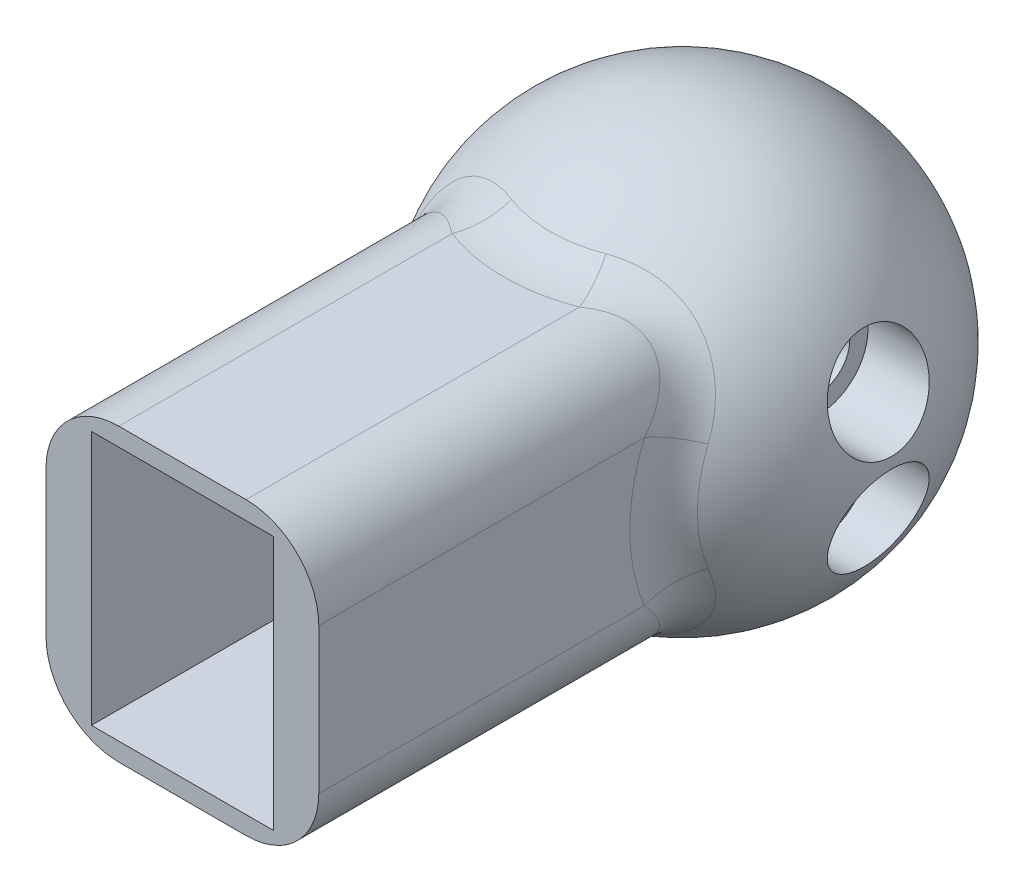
ISO-10303-21;
HEADER;
FILE_DESCRIPTION(('STEP AP214'),'2;1');
FILE_NAME('part.step','',(''),(''),'','','');
FILE_SCHEMA(('AUTOMOTIVE_DESIGN { 1 0 10303 214 1 1 1 1 }'));
ENDSEC;
DATA;
#1=APPLICATION_CONTEXT('core data for automotive mechanical design processes');
#2=APPLICATION_PROTOCOL_DEFINITION('international standard','automotive_design',2000,#1);
#3=PRODUCT_CONTEXT('',#1,'mechanical');
#4=PRODUCT('Part','Part','',(#3));
#5=PRODUCT_RELATED_PRODUCT_CATEGORY('part','',(#4));
#6=PRODUCT_DEFINITION_FORMATION('','',#4);
#7=PRODUCT_DEFINITION_CONTEXT('part definition',#1,'design');
#8=PRODUCT_DEFINITION('design','',#6,#7);
#9=PRODUCT_DEFINITION_SHAPE('','',#8);
#10=(LENGTH_UNIT() NAMED_UNIT(*) SI_UNIT(.MILLI.,.METRE.));
#11=(NAMED_UNIT(*) PLANE_ANGLE_UNIT() SI_UNIT($,.RADIAN.));
#12=(NAMED_UNIT(*) SI_UNIT($,.STERADIAN.) SOLID_ANGLE_UNIT());
#13=UNCERTAINTY_MEASURE_WITH_UNIT(LENGTH_MEASURE(1.E-05),#10,'distance_accuracy_value','');
#14=(GEOMETRIC_REPRESENTATION_CONTEXT(3) GLOBAL_UNCERTAINTY_ASSIGNED_CONTEXT((#13)) GLOBAL_UNIT_ASSIGNED_CONTEXT((#10,
#11,#12)) REPRESENTATION_CONTEXT('',''));
#15=CARTESIAN_POINT('',(0.,0.,0.));
#16=DIRECTION('',(0.,0.,1.));
#17=DIRECTION('',(1.,0.,0.));
#18=AXIS2_PLACEMENT_3D('',#15,#16,#17);
#19=CARTESIAN_POINT('',(7.5,8.,2.5));
#20=DIRECTION('',(0.,0.,1.));
#21=DIRECTION('',(-1.,0.,0.));
#22=AXIS2_PLACEMENT_3D('',#19,#20,#21);
#23=SPHERICAL_SURFACE('',#22,11.5);
#24=CARTESIAN_POINT('',(7.5,16.9032258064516,2.5));
#25=DIRECTION('',(0.,-1.,0.));
#26=DIRECTION('',(0.,0.,-1.));
#27=AXIS2_PLACEMENT_3D('',#24,#25,#26);
#28=CIRCLE('',#27,7.27891270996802);
#29=CARTESIAN_POINT('',(4.90322580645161,16.9032258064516,9.29995103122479));
#30=VERTEX_POINT('',#29);
#31=CARTESIAN_POINT('',(10.0967741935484,16.9032258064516,9.29995103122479));
#32=VERTEX_POINT('',#31);
#33=EDGE_CURVE('E484',#30,#32,#28,.F.);
#34=ORIENTED_EDGE('',*,*,#33,.T.);
#35=CARTESIAN_POINT('',(8.04665053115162,16.5379270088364,10.1847235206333));
#36=CARTESIAN_POINT('',(8.94586179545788,15.5062924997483,11.2669310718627));
#37=CARTESIAN_POINT('',(9.61839492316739,15.7538203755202,12.8576708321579));
#38=CARTESIAN_POINT('',(8.2083656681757,16.5974491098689,10.107104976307));
#39=CARTESIAN_POINT('',(9.06148175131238,15.5709771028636,11.1868717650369));
#40=CARTESIAN_POINT('',(9.72737686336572,15.7939330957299,12.753054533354));
#41=CARTESIAN_POINT('',(8.3729116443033,16.6500112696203,10.030014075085));
#42=CARTESIAN_POINT('',(9.18121155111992,15.6304789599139,11.1066151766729));
#43=CARTESIAN_POINT('',(9.83826654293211,15.8293554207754,12.6491494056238));
#44=CARTESIAN_POINT('',(8.70680439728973,16.7407737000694,9.87754706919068));
#45=CARTESIAN_POINT('',(9.42733959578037,15.7378309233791,10.9470305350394));
#46=CARTESIAN_POINT('',(10.0632812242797,15.890521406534,12.4436503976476));
#47=CARTESIAN_POINT('',(8.87615375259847,16.7789660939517,9.80217192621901));
#48=CARTESIAN_POINT('',(9.55374614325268,15.7857474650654,10.8676744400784));
#49=CARTESIAN_POINT('',(10.1774079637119,15.9162597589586,12.3420578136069));
#50=CARTESIAN_POINT('',(9.21922112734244,16.8405899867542,9.65361924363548));
#51=CARTESIAN_POINT('',(9.81265856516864,15.8692052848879,10.7105273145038));
#52=CARTESIAN_POINT('',(10.4086055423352,15.9577889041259,12.1418346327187));
#53=CARTESIAN_POINT('',(9.3929525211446,16.8639686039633,9.58045045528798));
#54=CARTESIAN_POINT('',(9.94520265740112,15.9047732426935,10.6327078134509));
#55=CARTESIAN_POINT('',(10.5256853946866,15.9735440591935,12.0432158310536));
#56=CARTESIAN_POINT('',(9.74308319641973,16.8952854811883,9.4374703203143));
#57=CARTESIAN_POINT('',(10.2147835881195,15.9625203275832,10.4800108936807));
#58=CARTESIAN_POINT('',(10.761643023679,15.9946489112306,11.8505034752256));
#59=CARTESIAN_POINT('',(9.91948177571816,16.9032277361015,9.36765810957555));
#60=CARTESIAN_POINT('',(10.3518472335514,15.984768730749,10.4050940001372));
#61=CARTESIAN_POINT('',(10.8805203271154,16.0000013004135,11.7564087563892));
#62=CARTESIAN_POINT('',(10.4016330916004,16.9032224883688,9.1835269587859));
#63=CARTESIAN_POINT('',(10.7287975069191,16.0260556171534,10.207064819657));
#64=CARTESIAN_POINT('',(11.205448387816,15.9999977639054,11.5082319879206));
#65=CARTESIAN_POINT('',(10.7091348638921,16.8797300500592,9.07332727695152));
#66=CARTESIAN_POINT('',(10.9727489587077,16.0315960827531,10.0874265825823));
#67=CARTESIAN_POINT('',(11.4126778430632,15.9841659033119,11.3597019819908));
#68=CARTESIAN_POINT('',(11.3223869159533,16.7835724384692,8.87138002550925));
#69=CARTESIAN_POINT('',(11.4631900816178,15.9976178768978,9.86734798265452));
#70=CARTESIAN_POINT('',(11.8259563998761,15.9193640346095,11.0875122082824));
#71=CARTESIAN_POINT('',(11.6281389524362,16.7109712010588,8.77960866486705));
#72=CARTESIAN_POINT('',(11.7099649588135,15.9583739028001,9.76664621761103));
#73=CARTESIAN_POINT('',(12.032006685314,15.8704371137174,10.9638203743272));
#74=CARTESIAN_POINT('',(12.0804503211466,16.5642121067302,8.66042527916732));
#75=CARTESIAN_POINT('',(12.0765509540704,15.8643244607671,9.63547913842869));
#76=CARTESIAN_POINT('',(12.3368252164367,15.7715342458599,10.8031818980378));
#77=CARTESIAN_POINT('',(12.230775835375,16.5086738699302,8.62366334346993));
#78=CARTESIAN_POINT('',(12.1985381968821,15.8269477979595,9.59496489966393));
#79=CARTESIAN_POINT('',(12.4381315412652,15.7341063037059,10.7536332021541));
#80=CARTESIAN_POINT('',(12.5277405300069,16.3849550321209,8.55733254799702));
#81=CARTESIAN_POINT('',(12.439648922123,15.7404260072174,9.52179196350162));
#82=CARTESIAN_POINT('',(12.6382599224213,15.6507305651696,10.6642308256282));
#83=CARTESIAN_POINT('',(12.6743814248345,16.3167804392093,8.52776028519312));
#84=CARTESIAN_POINT('',(12.5588235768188,15.6912891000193,9.48910322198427));
#85=CARTESIAN_POINT('',(12.7370831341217,15.6047868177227,10.6243725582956));
#86=CARTESIAN_POINT('',(12.9626249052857,16.1680465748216,8.47659620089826));
#87=CARTESIAN_POINT('',(12.7928934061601,15.5814614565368,9.43251516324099));
#88=CARTESIAN_POINT('',(12.931334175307,15.5045531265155,10.5554122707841));
#89=CARTESIAN_POINT('',(13.1042293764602,16.0874919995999,8.45500136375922));
#90=CARTESIAN_POINT('',(12.9078416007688,15.5207674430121,9.40859067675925));
#91=CARTESIAN_POINT('',(13.0267632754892,15.4502663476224,10.5263061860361));
#92=CARTESIAN_POINT('',(13.3810634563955,15.9144623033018,8.42041471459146));
#93=CARTESIAN_POINT('',(13.1320570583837,15.3882779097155,9.37026705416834));
#94=CARTESIAN_POINT('',(13.213325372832,15.3336593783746,10.4796893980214));
#95=CARTESIAN_POINT('',(13.5162938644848,15.8219886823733,8.40742182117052));
#96=CARTESIAN_POINT('',(13.2413756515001,15.316465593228,9.3558511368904));
#97=CARTESIAN_POINT('',(13.3044589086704,15.2713401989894,10.4621772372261));
#98=CARTESIAN_POINT('',(13.7655564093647,15.6358966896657,8.39131597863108));
#99=CARTESIAN_POINT('',(13.4420966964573,15.1703531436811,9.33798506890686));
#100=CARTESIAN_POINT('',(13.4724401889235,15.1459303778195,10.4404693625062));
#101=CARTESIAN_POINT('',(13.8803425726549,15.5433611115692,8.38732903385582));
#102=CARTESIAN_POINT('',(13.5342209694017,15.0970383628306,9.33355901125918));
#103=CARTESIAN_POINT('',(13.5497960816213,15.0835694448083,10.4350956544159));
#104=CARTESIAN_POINT('',(14.1027564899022,15.3499559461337,8.38672064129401));
#105=CARTESIAN_POINT('',(13.7118300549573,14.9427438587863,9.33288395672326));
#106=CARTESIAN_POINT('',(13.6996837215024,14.9532311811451,10.4342756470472));
#107=CARTESIAN_POINT('',(14.2103818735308,15.2490836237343,8.39010162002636));
#108=CARTESIAN_POINT('',(13.797343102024,14.8617353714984,9.33663742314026));
#109=CARTESIAN_POINT('',(13.7722138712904,14.8852520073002,10.4388326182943));
#110=CARTESIAN_POINT('',(14.4175477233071,15.0399078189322,8.40414521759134));
#111=CARTESIAN_POINT('',(13.9608212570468,14.6929592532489,9.3522162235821));
#112=CARTESIAN_POINT('',(13.9118256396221,14.744285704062,10.4577609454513));
#113=CARTESIAN_POINT('',(14.5170917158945,14.931607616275,8.41480464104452));
#114=CARTESIAN_POINT('',(14.0388149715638,14.6051637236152,9.36404329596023));
#115=CARTESIAN_POINT('',(13.9789096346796,14.6713007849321,10.4721279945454));
#116=CARTESIAN_POINT('',(14.7074817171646,14.7084503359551,8.44311801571));
#117=CARTESIAN_POINT('',(14.1866434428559,14.4237255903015,9.39542327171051));
#118=CARTESIAN_POINT('',(14.1072159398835,14.520912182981,10.510289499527));
#119=CARTESIAN_POINT('',(14.7983243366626,14.5935907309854,8.46077467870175));
#120=CARTESIAN_POINT('',(14.256494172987,14.3300466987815,9.41498951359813));
#121=CARTESIAN_POINT('',(14.1684359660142,14.4435067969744,10.5340876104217));
#122=CARTESIAN_POINT('',(15.0481002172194,14.2526672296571,8.52148934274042));
#123=CARTESIAN_POINT('',(14.4463343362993,14.0514558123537,9.48221239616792));
#124=CARTESIAN_POINT('',(14.3367631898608,14.2137540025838,10.6159204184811));
#125=CARTESIAN_POINT('',(15.195089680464,14.0191985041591,8.57313036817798));
#126=CARTESIAN_POINT('',(14.5550551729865,13.8600691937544,9.53935124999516));
#127=CARTESIAN_POINT('',(14.4358213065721,14.0564163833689,10.6855235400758));
#128=CARTESIAN_POINT('',(15.4535848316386,13.5385814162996,8.69620984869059));
#129=CARTESIAN_POINT('',(14.7392457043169,13.4667702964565,9.67494369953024));
#130=CARTESIAN_POINT('',(14.6100245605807,13.7325222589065,10.8514132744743));
#131=CARTESIAN_POINT('',(15.5650870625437,13.2914317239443,8.76765023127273));
#132=CARTESIAN_POINT('',(14.8147106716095,13.2646138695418,9.75353662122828));
#133=CARTESIAN_POINT('',(14.6851673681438,13.5659648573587,10.9477024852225));
#134=CARTESIAN_POINT('',(15.7616045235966,12.7639651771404,8.93388019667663));
#135=CARTESIAN_POINT('',(14.9383409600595,12.8353368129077,9.93548787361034));
#136=CARTESIAN_POINT('',(14.817603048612,13.2104982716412,11.1717515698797));
#137=CARTESIAN_POINT('',(15.8429247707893,12.4827806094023,9.03027734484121));
#138=CARTESIAN_POINT('',(14.9829553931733,12.6075364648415,10.0406751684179));
#139=CARTESIAN_POINT('',(14.8724058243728,13.0210043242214,11.3016781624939));
#140=CARTESIAN_POINT('',(15.9631605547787,11.9162091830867,9.23669167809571));
#141=CARTESIAN_POINT('',(15.03364266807,12.1528484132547,10.2643572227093));
#142=CARTESIAN_POINT('',(14.9534342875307,12.6391844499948,11.5798887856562));
#143=CARTESIAN_POINT('',(16.0020215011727,11.6308173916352,9.34672619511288));
#144=CARTESIAN_POINT('',(15.0394744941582,11.9257316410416,10.383060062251));
#145=CARTESIAN_POINT('',(14.9796231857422,12.4468551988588,11.7281961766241));
#146=CARTESIAN_POINT('',(16.0411172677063,11.018034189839,9.59337003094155));
#147=CARTESIAN_POINT('',(15.0128086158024,11.44419034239,10.6471109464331));
#148=CARTESIAN_POINT('',(15.0059703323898,12.0338926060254,12.0606291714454));
#149=CARTESIAN_POINT('',(16.0346487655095,10.690794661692,9.73148525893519));
#150=CARTESIAN_POINT('',(14.9740511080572,11.1908484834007,10.7938686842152));
#151=CARTESIAN_POINT('',(15.0016111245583,11.8133616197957,12.2467844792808));
#152=CARTESIAN_POINT('',(15.9855344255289,10.2069801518,9.94353882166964));
#153=CARTESIAN_POINT('',(14.8832925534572,10.8245710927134,11.0161995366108));
#154=CARTESIAN_POINT('',(14.9685123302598,11.4873127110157,12.5325958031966));
#155=CARTESIAN_POINT('',(15.9626300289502,10.0470138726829,10.0149749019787));
#156=CARTESIAN_POINT('',(14.8474608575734,10.7044339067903,11.0908955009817));
#157=CARTESIAN_POINT('',(14.953076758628,11.3795093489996,12.6288792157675));
#158=CARTESIAN_POINT('',(15.9040121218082,9.73005457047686,10.1590205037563));
#159=CARTESIAN_POINT('',(14.765431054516,10.4691052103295,11.2406485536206));
#160=CARTESIAN_POINT('',(14.9135733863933,11.1659063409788,12.8230276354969));
#161=CARTESIAN_POINT('',(15.8683033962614,9.57306045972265,10.231629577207));
#162=CARTESIAN_POINT('',(14.7191772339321,10.3539057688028,11.315726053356));
#163=CARTESIAN_POINT('',(14.8895088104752,11.0601059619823,12.9208920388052));
#164=CARTESIAN_POINT('',(15.8263304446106,9.41785356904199,10.3046084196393));
#165=CARTESIAN_POINT('',(14.6681599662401,10.2418045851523,11.3905140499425));
#166=CARTESIAN_POINT('',(14.8612226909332,10.9555100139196,13.0192548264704));
#167=(BOUNDED_SURFACE() B_SPLINE_SURFACE(3,2,((#35,#36,#37),(#38,#39,#40),(#41,#42,#43),(#44,
#45,#46),(#47,#48,#49),(#50,#51,#52),(#53,#54,#55),(#56,#57,#58),(#59,#60,#61),(#62,#63,#64),
(#65,#66,#67),(#68,#69,#70),(#71,#72,#73),(#74,#75,#76),(#77,#78,#79),(#80,#81,#82),(#83,#84,
#85),(#86,#87,#88),(#89,#90,#91),(#92,#93,#94),(#95,#96,#97),(#98,#99,#100),(#101,#102,#103),
(#104,#105,#106),(#107,#108,#109),(#110,#111,#112),(#113,#114,#115),(#116,#117,#118),(#119,#120,
#121),(#122,#123,#124),(#125,#126,#127),(#128,#129,#130),(#131,#132,#133),(#134,#135,#136),
(#137,#138,#139),(#140,#141,#142),(#143,#144,#145),(#146,#147,#148),(#149,#150,#151),(#152,#153,
#154),(#155,#156,#157),(#158,#159,#160),(#161,#162,#163),(#164,#165,#166)),.UNSPECIFIED.,.F.,
.F.,.F.) B_SPLINE_SURFACE_WITH_KNOTS((4,2,2,2,2,2,2,2,2,2,2,2,2,2,2,2,2,2,2,2,2,4),(3,3),(0.,
0.764022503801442,1.52846319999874,2.29561762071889,3.06257347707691,4.38137390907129,
5.69846066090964,6.36251461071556,7.02625363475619,7.68974149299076,8.35314592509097,
8.9487528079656,9.54455587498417,10.1400975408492,10.7358702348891,11.8656005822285,
12.9954409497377,14.2366682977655,15.4794896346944,16.9095995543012,17.6234592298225,
18.3370524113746),(0.,1.),
.UNSPECIFIED.) GEOMETRIC_REPRESENTATION_ITEM() RATIONAL_B_SPLINE_SURFACE(((1.,0.916601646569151,
1.),(1.,0.918985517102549,1.),(1.,0.921306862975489,1.),(1.,0.925813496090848,1.),(1.,
0.927998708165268,1.),(1.,0.932226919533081,1.),(1.,0.934269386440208,1.),(1.,0.938189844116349,
1.),(1.,0.940067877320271,1.),(1.,0.944936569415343,1.),(1.,0.947755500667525,1.),(1.,
0.952793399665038,1.),(1.,0.955013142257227,1.),(1.,0.957841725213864,1.),(1.,0.958703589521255,
1.),(1.,0.960245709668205,1.),(1.,0.960926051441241,1.),(1.,0.962095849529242,1.),(1.,
0.962585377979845,1.),(1.,0.963366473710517,1.),(1.,0.963658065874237,1.),(1.,0.964019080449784,
1.),(1.,0.964108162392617,1.),(1.,0.964121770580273,1.),(1.,0.964046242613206,1.),(1.,
0.963731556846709,1.),(1.,0.963492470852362,1.),(1.,0.962854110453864,1.),(1.,0.962454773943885,
1.),(1.,0.961072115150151,1.),(1.,0.959886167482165,1.),(1.,0.957000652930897,1.),(1.,
0.955301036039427,1.),(1.,0.95124774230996,1.),(1.,0.948846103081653,1.),(1.,0.943546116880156,
1.),(1.,0.940647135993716,1.),(1.,0.933939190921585,1.),(1.,0.930058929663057,1.),(1.,
0.92387495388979,1.),(1.,0.921754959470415,1.),(1.,0.917402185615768,1.),(1.,0.915169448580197,
1.),(1.,0.912884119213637,1.))) REPRESENTATION_ITEM('') SURFACE());
#168=CARTESIAN_POINT('',(15.8263304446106,9.41785356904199,10.3046084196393));
#169=CARTESIAN_POINT('',(15.8683033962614,9.57306045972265,10.231629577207));
#170=CARTESIAN_POINT('',(15.9040121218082,9.73005457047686,10.1590205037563));
#171=CARTESIAN_POINT('',(15.9626300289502,10.0470138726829,10.0149749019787));
#172=CARTESIAN_POINT('',(15.9855344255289,10.2069801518,9.94353882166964));
#173=CARTESIAN_POINT('',(16.0346487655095,10.690794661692,9.73148525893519));
#174=CARTESIAN_POINT('',(16.0411172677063,11.018034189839,9.59337003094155));
#175=CARTESIAN_POINT('',(16.0020215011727,11.6308173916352,9.34672619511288));
#176=CARTESIAN_POINT('',(15.9631605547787,11.9162091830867,9.23669167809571));
#177=CARTESIAN_POINT('',(15.8429247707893,12.4827806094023,9.03027734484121));
#178=CARTESIAN_POINT('',(15.7616045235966,12.7639651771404,8.93388019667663));
#179=CARTESIAN_POINT('',(15.5650870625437,13.2914317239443,8.76765023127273));
#180=CARTESIAN_POINT('',(15.4535848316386,13.5385814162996,8.69620984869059));
#181=CARTESIAN_POINT('',(15.195089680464,14.0191985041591,8.57313036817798));
#182=CARTESIAN_POINT('',(15.0481002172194,14.2526672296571,8.52148934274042));
#183=CARTESIAN_POINT('',(14.7983243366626,14.5935907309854,8.46077467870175));
#184=CARTESIAN_POINT('',(14.7074817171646,14.7084503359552,8.44311801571));
#185=CARTESIAN_POINT('',(14.5170917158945,14.931607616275,8.41480464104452));
#186=CARTESIAN_POINT('',(14.4175477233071,15.0399078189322,8.40414521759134));
#187=CARTESIAN_POINT('',(14.2103818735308,15.2490836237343,8.39010162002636));
#188=CARTESIAN_POINT('',(14.1027564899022,15.3499559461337,8.38672064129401));
#189=CARTESIAN_POINT('',(13.8803425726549,15.5433611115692,8.38732903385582));
#190=CARTESIAN_POINT('',(13.7655564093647,15.6358966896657,8.39131597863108));
#191=CARTESIAN_POINT('',(13.5162938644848,15.8219886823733,8.40742182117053));
#192=CARTESIAN_POINT('',(13.3810634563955,15.9144623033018,8.42041471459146));
#193=CARTESIAN_POINT('',(13.1042293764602,16.0874919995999,8.45500136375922));
#194=CARTESIAN_POINT('',(12.9626249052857,16.1680465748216,8.47659620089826));
#195=CARTESIAN_POINT('',(12.6743814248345,16.3167804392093,8.52776028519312));
#196=CARTESIAN_POINT('',(12.5277405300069,16.3849550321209,8.55733254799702));
#197=CARTESIAN_POINT('',(12.230775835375,16.5086738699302,8.62366334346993));
#198=CARTESIAN_POINT('',(12.0804503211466,16.5642121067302,8.66042527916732));
#199=CARTESIAN_POINT('',(11.6281389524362,16.7109712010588,8.77960866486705));
#200=CARTESIAN_POINT('',(11.3223869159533,16.7835724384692,8.87138002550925));
#201=CARTESIAN_POINT('',(10.7091348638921,16.8797300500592,9.07332727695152));
#202=CARTESIAN_POINT('',(10.4016330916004,16.9032224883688,9.18352695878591));
#203=CARTESIAN_POINT('',(9.91948177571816,16.9032277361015,9.36765810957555));
#204=CARTESIAN_POINT('',(9.74308319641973,16.8952854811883,9.4374703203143));
#205=CARTESIAN_POINT('',(9.39295252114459,16.8639686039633,9.58045045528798));
#206=CARTESIAN_POINT('',(9.21922112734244,16.8405899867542,9.65361924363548));
#207=CARTESIAN_POINT('',(8.87615375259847,16.7789660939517,9.80217192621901));
#208=CARTESIAN_POINT('',(8.70680439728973,16.7407737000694,9.87754706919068));
#209=CARTESIAN_POINT('',(8.3729116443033,16.6500112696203,10.030014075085));
#210=CARTESIAN_POINT('',(8.2083656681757,16.5974491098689,10.107104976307));
#211=CARTESIAN_POINT('',(8.04665053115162,16.5379270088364,10.1847235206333));
#212=B_SPLINE_CURVE_WITH_KNOTS('',3,(#168,#169,#170,#171,#172,#173,#174,#175,#176,#177,#178,
#179,#180,#181,#182,#183,#184,#185,#186,#187,#188,#189,#190,#191,#192,#193,#194,#195,#196,#197,
#198,#199,#200,#201,#202,#203,#204,#205,#206,#207,#208,#209,#210,#211),.UNSPECIFIED.,.F.,.F.,(4,
2,2,2,2,2,2,2,2,2,2,2,2,2,2,2,2,2,2,2,2,4),(0.,0.713593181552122,1.42745285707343,
2.85756277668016,4.10038411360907,5.34161146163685,6.47145182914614,7.60118217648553,
8.19695487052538,8.79249653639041,9.38829960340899,9.98390648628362,10.6473109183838,
11.3107987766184,11.974537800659,12.638591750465,13.9556785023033,15.2744789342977,
16.0414347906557,16.8085892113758,17.5730299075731,18.3370524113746),.UNSPECIFIED.);
#213=CARTESIAN_POINT('',(16.0322580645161,10.9677419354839,9.61639516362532));
#214=VERTEX_POINT('',#213);
#215=EDGE_CURVE('E11',#32,#214,#212,.F.);
#216=ORIENTED_EDGE('',*,*,#215,.T.);
#217=CARTESIAN_POINT('',(16.0322580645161,8.,2.5));
#218=DIRECTION('',(-1.,0.,0.));
#219=DIRECTION('',(0.,0.,1.));
#220=AXIS2_PLACEMENT_3D('',#217,#218,#219);
#221=CIRCLE('',#220,7.71041972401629);
#222=CARTESIAN_POINT('',(16.0322580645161,5.03225806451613,9.61639516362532));
#223=VERTEX_POINT('',#222);
#224=EDGE_CURVE('E512',#214,#223,#221,.F.);
#225=ORIENTED_EDGE('',*,*,#224,.T.);
#226=CARTESIAN_POINT('',(15.6407810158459,7.15215361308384,10.5782944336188));
#227=CARTESIAN_POINT('',(14.4550696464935,6.16378858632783,11.6694449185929));
#228=CARTESIAN_POINT('',(14.7361785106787,5.42862526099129,13.3881359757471));
#229=CARTESIAN_POINT('',(15.7048749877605,6.98454471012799,10.4961302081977));
#230=CARTESIAN_POINT('',(14.5250989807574,6.04713042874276,11.5866629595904));
#231=CARTESIAN_POINT('',(14.7793722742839,5.31567143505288,13.277392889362));
#232=CARTESIAN_POINT('',(15.7613739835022,6.81399015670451,10.4140445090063));
#233=CARTESIAN_POINT('',(14.5897659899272,5.92593915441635,11.5030331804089));
#234=CARTESIAN_POINT('',(14.8174476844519,5.20073249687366,13.1667556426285));
#235=CARTESIAN_POINT('',(15.85878638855,6.46804266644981,10.2506586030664));
#236=CARTESIAN_POINT('',(14.7068911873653,5.67626879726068,11.3354288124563));
#237=CARTESIAN_POINT('',(14.8830951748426,4.96759397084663,12.9465398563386));
#238=CARTESIAN_POINT('',(15.8996942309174,6.29264802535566,10.1693586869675));
#239=CARTESIAN_POINT('',(14.7594299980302,5.54779277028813,11.2514323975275));
#240=CARTESIAN_POINT('',(14.9106635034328,4.84939323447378,12.836961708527));
#241=CARTESIAN_POINT('',(15.965560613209,5.93777292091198,10.0080407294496));
#242=CARTESIAN_POINT('',(14.8514718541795,5.28436960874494,11.0837405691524));
#243=CARTESIAN_POINT('',(14.955051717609,4.61023827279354,12.6195331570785));
#244=CARTESIAN_POINT('',(15.990480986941,5.75828373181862,9.92802619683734));
#245=CARTESIAN_POINT('',(14.8910280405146,5.14939817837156,11.0000167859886));
#246=CARTESIAN_POINT('',(14.9718458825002,4.48927816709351,12.5116874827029));
#247=CARTESIAN_POINT('',(16.0238290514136,5.3968602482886,9.77029425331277));
#248=CARTESIAN_POINT('',(14.9561134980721,4.87456544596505,10.8340899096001));
#249=CARTESIAN_POINT('',(14.994319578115,4.24571016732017,12.2990922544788));
#250=CARTESIAN_POINT('',(16.0322599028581,5.21492642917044,9.69257640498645));
#251=CARTESIAN_POINT('',(14.9817253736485,4.73468302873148,10.7518512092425));
#252=CARTESIAN_POINT('',(15.0000012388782,4.1231025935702,12.1943421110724));
#253=CARTESIAN_POINT('',(16.0322548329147,4.71114731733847,9.48247698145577));
#254=CARTESIAN_POINT('',(15.0319236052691,4.34437744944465,10.5288723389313));
#255=CARTESIAN_POINT('',(14.9999978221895,3.78359927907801,11.911164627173));
#256=CARTESIAN_POINT('',(16.006193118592,4.38776669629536,9.35330718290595));
#257=CARTESIAN_POINT('',(15.0414820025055,4.08919338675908,10.3901833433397));
#258=CARTESIAN_POINT('',(14.9824344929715,3.56566886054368,11.7370662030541));
#259=CARTESIAN_POINT('',(15.8999320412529,3.74402578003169,9.11050515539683));
#260=CARTESIAN_POINT('',(15.011207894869,3.57560670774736,10.1280260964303));
#261=CARTESIAN_POINT('',(14.910823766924,3.13184346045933,11.4098112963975));
#262=CARTESIAN_POINT('',(15.8197715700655,3.4236634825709,8.99686183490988));
#263=CARTESIAN_POINT('',(14.971721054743,3.31690095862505,10.0042785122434));
#264=CARTESIAN_POINT('',(14.8568025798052,2.9159471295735,11.2566398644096));
#265=CARTESIAN_POINT('',(15.6578352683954,2.95074185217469,8.84315003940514));
#266=CARTESIAN_POINT('',(14.8736696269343,2.93233215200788,9.83610801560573));
#267=CARTESIAN_POINT('',(14.7476715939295,2.59723907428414,11.0494630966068));
#268=CARTESIAN_POINT('',(15.5965630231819,2.79373250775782,8.79453764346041));
#269=CARTESIAN_POINT('',(14.8343684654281,2.80437136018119,9.78282831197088));
#270=CARTESIAN_POINT('',(14.7063794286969,2.49142842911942,10.9839420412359));
#271=CARTESIAN_POINT('',(15.4600308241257,2.48391423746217,8.7041396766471));
#272=CARTESIAN_POINT('',(14.742708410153,2.5514437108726,9.68358935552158));
#273=CARTESIAN_POINT('',(14.6143685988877,2.28263785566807,10.8621013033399));
#274=CARTESIAN_POINT('',(15.3847777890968,2.33110327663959,8.66235074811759));
#275=CARTESIAN_POINT('',(14.6903673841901,2.42641877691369,9.63759040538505));
#276=CARTESIAN_POINT('',(14.5636545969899,2.17965655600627,10.8057770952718));
#277=CARTESIAN_POINT('',(15.2204989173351,2.03115114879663,8.58665806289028));
#278=CARTESIAN_POINT('',(14.5727709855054,2.18093503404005,9.55417514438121));
#279=CARTESIAN_POINT('',(14.452944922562,1.9775149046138,10.7037565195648));
#280=CARTESIAN_POINT('',(15.1314818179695,1.88400645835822,8.55274933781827));
#281=CARTESIAN_POINT('',(14.5075229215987,2.06041349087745,9.51672012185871));
#282=CARTESIAN_POINT('',(14.3929551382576,1.87835217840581,10.6580534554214));
#283=CARTESIAN_POINT('',(14.9400653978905,1.59681661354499,8.49377188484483));
#284=CARTESIAN_POINT('',(14.3644822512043,1.8254839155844,9.45153032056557));
#285=CARTESIAN_POINT('',(14.2639571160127,1.68481119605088,10.5785621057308));
#286=CARTESIAN_POINT('',(14.8376683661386,1.45677025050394,8.46870164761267));
#287=CARTESIAN_POINT('',(14.2866776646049,1.71101406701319,9.42376573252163));
#288=CARTESIAN_POINT('',(14.1949504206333,1.59043212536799,10.5447717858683));
#289=CARTESIAN_POINT('',(14.632780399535,1.20103308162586,8.43055488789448));
#290=CARTESIAN_POINT('',(14.1289004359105,1.50260543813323,9.38150754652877));
#291=CARTESIAN_POINT('',(14.0568737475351,1.41808751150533,10.493356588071));
#292=CARTESIAN_POINT('',(14.5316629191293,1.08439632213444,8.41642842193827));
#293=CARTESIAN_POINT('',(14.0502006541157,1.40778824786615,9.36583929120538));
#294=CARTESIAN_POINT('',(13.9887293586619,1.33948447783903,10.4743165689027));
#295=CARTESIAN_POINT('',(14.3202611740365,0.859011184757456,8.39612449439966));
#296=CARTESIAN_POINT('',(13.8842723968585,1.22535409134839,9.3433217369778));
#297=CARTESIAN_POINT('',(13.8462629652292,1.18759449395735,10.4469504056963));
#298=CARTESIAN_POINT('',(14.2099779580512,0.750261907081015,8.38994612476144));
#299=CARTESIAN_POINT('',(13.797018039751,1.1376989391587,9.33646307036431));
#300=CARTESIAN_POINT('',(13.7719416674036,1.11430693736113,10.4386230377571));
#301=CARTESIAN_POINT('',(13.9811988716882,0.541693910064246,8.38571904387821));
#302=CARTESIAN_POINT('',(13.6149336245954,0.970638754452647,9.33177269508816));
#303=CARTESIAN_POINT('',(13.617764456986,0.97375024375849,10.4329256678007));
#304=CARTESIAN_POINT('',(13.8627060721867,0.441871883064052,8.38766730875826));
#305=CARTESIAN_POINT('',(13.520072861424,0.89119840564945,9.33393586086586));
#306=CARTESIAN_POINT('',(13.5379106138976,0.906478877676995,10.4355515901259));
#307=CARTESIAN_POINT('',(13.618540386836,0.251980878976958,8.39962854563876));
#308=CARTESIAN_POINT('',(13.3238332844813,0.741396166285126,9.3472058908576));
#309=CARTESIAN_POINT('',(13.3733641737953,0.77850885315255,10.4516732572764));
#310=CARTESIAN_POINT('',(13.4928678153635,0.16191147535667,8.40964116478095));
#311=CARTESIAN_POINT('',(13.2224161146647,0.671008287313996,9.35831734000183));
#312=CARTESIAN_POINT('',(13.288671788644,0.717809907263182,10.4651685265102));
#313=CARTESIAN_POINT('',(13.2481640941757,0.000556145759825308,8.43607410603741));
#314=CARTESIAN_POINT('',(13.0244996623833,0.546425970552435,9.38761700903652));
#315=CARTESIAN_POINT('',(13.1237627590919,0.609070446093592,10.5007955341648));
#316=CARTESIAN_POINT('',(13.1296959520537,-0.0717059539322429,8.45176710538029));
#317=CARTESIAN_POINT('',(12.928460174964,0.491302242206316,9.40501094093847));
#318=CARTESIAN_POINT('',(13.043925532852,0.560372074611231,10.5219469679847));
#319=CARTESIAN_POINT('',(12.8887061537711,-0.207421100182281,8.48912220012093));
#320=CARTESIAN_POINT('',(12.7329191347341,0.389281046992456,9.44636360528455));
#321=CARTESIAN_POINT('',(12.8815193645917,0.468911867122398,10.572295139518));
#322=CARTESIAN_POINT('',(12.7661831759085,-0.270871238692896,8.51078625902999));
#323=CARTESIAN_POINT('',(12.6333849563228,0.342378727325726,9.47033631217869));
#324=CARTESIAN_POINT('',(12.7989495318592,0.42615199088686,10.6014945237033));
#325=CARTESIAN_POINT('',(12.3939155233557,-0.447559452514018,8.58407900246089));
#326=CARTESIAN_POINT('',(12.3308320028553,0.214336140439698,9.55137021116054));
#327=CARTESIAN_POINT('',(12.5480735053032,0.307079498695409,10.7002803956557));
#328=CARTESIAN_POINT('',(12.1392420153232,-0.547285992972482,8.64403432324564));
#329=CARTESIAN_POINT('',(12.1238385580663,0.14588377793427,9.61757267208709));
#330=CARTESIAN_POINT('',(12.3764457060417,0.239872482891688,10.781089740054));
#331=CARTESIAN_POINT('',(11.6078087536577,-0.714838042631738,8.7861092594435));
#332=CARTESIAN_POINT('',(11.6936790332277,0.039898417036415,9.77373232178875));
#333=CARTESIAN_POINT('',(12.0183058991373,0.126956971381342,10.972582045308));
#334=CARTESIAN_POINT('',(11.330642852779,-0.78037915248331,8.86934675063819));
#335=CARTESIAN_POINT('',(11.4700734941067,0.00456356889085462,9.86503077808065));
#336=CARTESIAN_POINT('',(11.8315201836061,0.0827879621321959,11.0847717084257));
#337=CARTESIAN_POINT('',(10.7745282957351,-0.871143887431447,9.05119029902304));
#338=CARTESIAN_POINT('',(11.0250254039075,-0.0294790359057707,10.0632864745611));
#339=CARTESIAN_POINT('',(11.4567473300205,0.0216204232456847,11.3298651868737));
#340=CARTESIAN_POINT('',(10.4955777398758,-0.89631303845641,9.14981692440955));
#341=CARTESIAN_POINT('',(10.8033673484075,-0.0279791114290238,10.1704419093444));
#342=CARTESIAN_POINT('',(11.2687589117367,0.00465860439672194,11.4627967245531));
#343=CARTESIAN_POINT('',(9.89981031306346,-0.908492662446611,9.37351721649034));
#344=CARTESIAN_POINT('',(10.335212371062,0.0122620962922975,10.4118735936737));
#345=CARTESIAN_POINT('',(10.8672634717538,-0.00354940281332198,11.7643058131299));
#346=CARTESIAN_POINT('',(9.58350700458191,-0.889296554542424,9.50034425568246));
#347=CARTESIAN_POINT('',(10.0899052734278,0.0567799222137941,10.5479327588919));
#348=CARTESIAN_POINT('',(10.6541025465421,0.00938710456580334,11.9352466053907));
#349=CARTESIAN_POINT('',(9.11784513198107,-0.824039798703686,9.69706824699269));
#350=CARTESIAN_POINT('',(9.73592540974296,0.153984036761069,10.7565268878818));
#351=CARTESIAN_POINT('',(10.3402869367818,0.0533644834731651,12.2003963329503));
#352=CARTESIAN_POINT('',(8.96424743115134,-0.796258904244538,9.76364984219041));
#353=CARTESIAN_POINT('',(9.62000635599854,0.191569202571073,10.8269756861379));
#354=CARTESIAN_POINT('',(10.236775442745,0.0720863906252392,12.2901367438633));
#355=CARTESIAN_POINT('',(8.66049392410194,-0.728923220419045,9.89850294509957));
#356=CARTESIAN_POINT('',(9.39312477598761,0.276378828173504,10.9689568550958));
#357=CARTESIAN_POINT('',(10.0320719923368,0.11746478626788,12.4718952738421));
#358=CARTESIAN_POINT('',(8.51033660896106,-0.68937370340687,9.96677368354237));
#359=CARTESIAN_POINT('',(9.28215210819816,0.323650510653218,11.0405113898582));
#360=CARTESIAN_POINT('',(9.93087901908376,0.144117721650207,12.5639123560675));
#361=CARTESIAN_POINT('',(8.36214620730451,-0.644099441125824,10.0356651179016));
#362=CARTESIAN_POINT('',(9.17418833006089,0.375346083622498,11.1121579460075));
#363=CARTESIAN_POINT('',(9.83101157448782,0.174628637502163,12.656766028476));
#364=(BOUNDED_SURFACE() B_SPLINE_SURFACE(3,2,((#226,#227,#228),(#229,#230,#231),(#232,#233,
#234),(#235,#236,#237),(#238,#239,#240),(#241,#242,#243),(#244,#245,#246),(#247,#248,#249),
(#250,#251,#252),(#253,#254,#255),(#256,#257,#258),(#259,#260,#261),(#262,#263,#264),(#265,#266,
#267),(#268,#269,#270),(#271,#272,#273),(#274,#275,#276),(#277,#278,#279),(#280,#281,#282),
(#283,#284,#285),(#286,#287,#288),(#289,#290,#291),(#292,#293,#294),(#295,#296,#297),(#298,#299,
#300),(#301,#302,#303),(#304,#305,#306),(#307,#308,#309),(#310,#311,#312),(#313,#314,#315),
(#316,#317,#318),(#319,#320,#321),(#322,#323,#324),(#325,#326,#327),(#328,#329,#330),(#331,#332,
#333),(#334,#335,#336),(#337,#338,#339),(#340,#341,#342),(#343,#344,#345),(#346,#347,#348),
(#349,#350,#351),(#352,#353,#354),(#355,#356,#357),(#358,#359,#360),(#361,#362,#363)),
.UNSPECIFIED.,.F.,.F.,.F.) B_SPLINE_SURFACE_WITH_KNOTS((4,2,2,2,2,2,2,2,2,2,2,2,2,2,2,2,2,2,2,2,
2,2,4),(3,3),(0.,0.797805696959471,1.59589599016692,2.39588450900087,3.19571967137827,
4.60174127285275,6.00675315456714,6.71519769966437,7.4232925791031,8.13093979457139,
8.83846610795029,9.46437429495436,10.0902109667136,10.7158147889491,11.3413912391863,
11.9054216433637,12.469637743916,13.5969657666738,14.7922242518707,15.9890941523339,
17.3633052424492,18.0489657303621,18.7343195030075),(0.,1.),
.UNSPECIFIED.) GEOMETRIC_REPRESENTATION_ITEM() RATIONAL_B_SPLINE_SURFACE(((1.,0.904121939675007,
1.),(1.,0.906811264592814,1.),(1.,0.909443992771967,1.),(1.,0.914582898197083,1.),(1.,
0.917089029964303,1.),(1.,0.921965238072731,1.),(1.,0.924334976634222,1.),(1.,0.928916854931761,
1.),(1.,0.931129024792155,1.),(1.,0.936996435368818,1.),(1.,0.940474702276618,1.),(1.,
0.946818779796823,1.),(1.,0.949685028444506,1.),(1.,0.95346605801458,1.),(1.,0.954643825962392,
1.),(1.,0.956808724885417,1.),(1.,0.957795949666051,1.),(1.,0.959567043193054,1.),(1.,
0.960351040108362,1.),(1.,0.961704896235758,1.),(1.,0.962274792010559,1.),(1.,0.963138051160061,
1.),(1.,0.9634557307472,1.),(1.,0.963911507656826,1.),(1.,0.964049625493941,1.),(1.,
0.96414417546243,1.),(1.,0.964100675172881,1.),(1.,0.963832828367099,1.),(1.,0.963608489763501,
1.),(1.,0.963013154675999,1.),(1.,0.962658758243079,1.),(1.,0.961809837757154,1.),(1.,
0.961315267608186,1.),(1.,0.959629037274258,1.),(1.,0.958234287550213,1.),(1.,0.954854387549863,
1.),(1.,0.952838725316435,1.),(1.,0.94831246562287,1.),(1.,0.945801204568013,1.),(1.,
0.939933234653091,1.),(1.,0.936506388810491,1.),(1.,0.930998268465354,1.),(1.,0.929103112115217,
1.),(1.,0.925197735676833,1.),(1.,0.923187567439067,1.),(1.,0.921123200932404,1.))) REPRESENTATION_ITEM('') SURFACE());
#365=CARTESIAN_POINT('',(8.36214620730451,-0.644099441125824,10.0356651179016));
#366=CARTESIAN_POINT('',(8.51033660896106,-0.68937370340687,9.96677368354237));
#367=CARTESIAN_POINT('',(8.66049392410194,-0.728923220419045,9.89850294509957));
#368=CARTESIAN_POINT('',(8.96424743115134,-0.796258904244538,9.76364984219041));
#369=CARTESIAN_POINT('',(9.11784513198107,-0.824039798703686,9.69706824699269));
#370=CARTESIAN_POINT('',(9.58350700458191,-0.889296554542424,9.50034425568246));
#371=CARTESIAN_POINT('',(9.89981031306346,-0.908492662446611,9.37351721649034));
#372=CARTESIAN_POINT('',(10.4955777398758,-0.89631303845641,9.14981692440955));
#373=CARTESIAN_POINT('',(10.7745282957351,-0.871143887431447,9.05119029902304));
#374=CARTESIAN_POINT('',(11.330642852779,-0.78037915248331,8.86934675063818));
#375=CARTESIAN_POINT('',(11.6078087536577,-0.714838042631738,8.7861092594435));
#376=CARTESIAN_POINT('',(12.1392420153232,-0.547285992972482,8.64403432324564));
#377=CARTESIAN_POINT('',(12.3939155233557,-0.447559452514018,8.58407900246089));
#378=CARTESIAN_POINT('',(12.7661831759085,-0.270871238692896,8.51078625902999));
#379=CARTESIAN_POINT('',(12.8887061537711,-0.207421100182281,8.48912220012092));
#380=CARTESIAN_POINT('',(13.1296959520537,-0.0717059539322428,8.45176710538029));
#381=CARTESIAN_POINT('',(13.2481640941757,0.000556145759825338,8.43607410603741));
#382=CARTESIAN_POINT('',(13.4928678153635,0.16191147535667,8.40964116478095));
#383=CARTESIAN_POINT('',(13.618540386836,0.251980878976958,8.39962854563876));
#384=CARTESIAN_POINT('',(13.8627060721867,0.441871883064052,8.38766730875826));
#385=CARTESIAN_POINT('',(13.9811988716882,0.541693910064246,8.38571904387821));
#386=CARTESIAN_POINT('',(14.2099779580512,0.750261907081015,8.38994612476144));
#387=CARTESIAN_POINT('',(14.3202611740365,0.859011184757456,8.39612449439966));
#388=CARTESIAN_POINT('',(14.5316629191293,1.08439632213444,8.41642842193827));
#389=CARTESIAN_POINT('',(14.632780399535,1.20103308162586,8.43055488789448));
#390=CARTESIAN_POINT('',(14.8376683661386,1.45677025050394,8.46870164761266));
#391=CARTESIAN_POINT('',(14.9400653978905,1.59681661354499,8.49377188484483));
#392=CARTESIAN_POINT('',(15.1314818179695,1.88400645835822,8.55274933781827));
#393=CARTESIAN_POINT('',(15.2204989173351,2.03115114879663,8.58665806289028));
#394=CARTESIAN_POINT('',(15.3847777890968,2.33110327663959,8.66235074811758));
#395=CARTESIAN_POINT('',(15.4600308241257,2.48391423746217,8.7041396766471));
#396=CARTESIAN_POINT('',(15.5965630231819,2.79373250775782,8.79453764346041));
#397=CARTESIAN_POINT('',(15.6578352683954,2.95074185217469,8.84315003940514));
#398=CARTESIAN_POINT('',(15.8197715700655,3.4236634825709,8.99686183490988));
#399=CARTESIAN_POINT('',(15.8999320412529,3.74402578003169,9.11050515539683));
#400=CARTESIAN_POINT('',(16.006193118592,4.38776669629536,9.35330718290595));
#401=CARTESIAN_POINT('',(16.0322548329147,4.71114731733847,9.48247698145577));
#402=CARTESIAN_POINT('',(16.0322599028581,5.21492642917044,9.69257640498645));
#403=CARTESIAN_POINT('',(16.0238290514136,5.3968602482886,9.77029425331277));
#404=CARTESIAN_POINT('',(15.9904809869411,5.75828373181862,9.92802619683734));
#405=CARTESIAN_POINT('',(15.965560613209,5.93777292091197,10.0080407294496));
#406=CARTESIAN_POINT('',(15.8996942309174,6.29264802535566,10.1693586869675));
#407=CARTESIAN_POINT('',(15.85878638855,6.46804266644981,10.2506586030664));
#408=CARTESIAN_POINT('',(15.7613739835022,6.81399015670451,10.4140445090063));
#409=CARTESIAN_POINT('',(15.7048749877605,6.98454471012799,10.4961302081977));
#410=CARTESIAN_POINT('',(15.6407810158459,7.15215361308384,10.5782944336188));
#411=B_SPLINE_CURVE_WITH_KNOTS('',3,(#365,#366,#367,#368,#369,#370,#371,#372,#373,#374,#375,
#376,#377,#378,#379,#380,#381,#382,#383,#384,#385,#386,#387,#388,#389,#390,#391,#392,#393,#394,
#395,#396,#397,#398,#399,#400,#401,#402,#403,#404,#405,#406,#407,#408,#409,#410),.UNSPECIFIED.,
.F.,.F.,(4,2,2,2,2,2,2,2,2,2,2,2,2,2,2,2,2,2,2,2,2,2,4),(0.,0.685353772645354,1.37101426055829,
2.74522535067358,3.94209525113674,5.13735373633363,6.26468175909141,6.8288978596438,
7.39292826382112,8.01850471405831,8.64410853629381,9.26994520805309,9.89585339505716,
10.6033797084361,11.3110269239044,12.0191218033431,12.7275663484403,14.1325782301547,
15.5385998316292,16.3384349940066,17.1384235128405,17.936513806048,18.7343195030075),.UNSPECIFIED.);
#412=CARTESIAN_POINT('',(10.0967741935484,-0.903225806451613,9.29995103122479));
#413=VERTEX_POINT('',#412);
#414=EDGE_CURVE('E546',#223,#413,#411,.F.);
#415=ORIENTED_EDGE('',*,*,#414,.T.);
#416=CARTESIAN_POINT('',(7.5,-0.903225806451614,2.5));
#417=DIRECTION('',(0.,1.,0.));
#418=DIRECTION('',(0.,0.,1.));
#419=AXIS2_PLACEMENT_3D('',#416,#417,#418);
#420=CIRCLE('',#419,7.27891270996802);
#421=CARTESIAN_POINT('',(4.90322580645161,-0.903225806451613,9.29995103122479));
#422=VERTEX_POINT('',#421);
#423=EDGE_CURVE('E510',#413,#422,#420,.F.);
#424=ORIENTED_EDGE('',*,*,#423,.T.);
#425=CARTESIAN_POINT('',(6.95334946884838,-0.537927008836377,10.1847235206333));
#426=CARTESIAN_POINT('',(6.05413820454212,0.493707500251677,11.2669310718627));
#427=CARTESIAN_POINT('',(5.38160507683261,0.246179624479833,12.8576708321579));
#428=CARTESIAN_POINT('',(6.7916343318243,-0.597449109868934,10.107104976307));
#429=CARTESIAN_POINT('',(5.93851824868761,0.429022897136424,11.1868717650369));
#430=CARTESIAN_POINT('',(5.27262313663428,0.206066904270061,12.753054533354));
#431=CARTESIAN_POINT('',(6.6270883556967,-0.650011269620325,10.030014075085));
#432=CARTESIAN_POINT('',(5.81878844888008,0.369521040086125,11.1066151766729));
#433=CARTESIAN_POINT('',(5.16173345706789,0.170644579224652,12.6491494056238));
#434=CARTESIAN_POINT('',(6.29319560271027,-0.740773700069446,9.87754706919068));
#435=CARTESIAN_POINT('',(5.57266040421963,0.262169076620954,10.9470305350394));
#436=CARTESIAN_POINT('',(4.93671877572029,0.109478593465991,12.4436503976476));
#437=CARTESIAN_POINT('',(6.12384624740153,-0.778966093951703,9.80217192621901));
#438=CARTESIAN_POINT('',(5.44625385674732,0.21425253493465,10.8676744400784));
#439=CARTESIAN_POINT('',(4.82259203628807,0.0837402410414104,12.3420578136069));
#440=CARTESIAN_POINT('',(5.78077887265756,-0.840589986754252,9.65361924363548));
#441=CARTESIAN_POINT('',(5.18734143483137,0.130794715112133,10.7105273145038));
#442=CARTESIAN_POINT('',(4.59139445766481,0.0422110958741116,12.1418346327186));
#443=CARTESIAN_POINT('',(5.6070474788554,-0.86396860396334,9.58045045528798));
#444=CARTESIAN_POINT('',(5.05479734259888,0.0952267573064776,10.6327078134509));
#445=CARTESIAN_POINT('',(4.47431460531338,0.0264559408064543,12.0432158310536));
#446=CARTESIAN_POINT('',(5.25691680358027,-0.895285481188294,9.4374703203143));
#447=CARTESIAN_POINT('',(4.78521641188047,0.0374796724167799,10.4800108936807));
#448=CARTESIAN_POINT('',(4.23835697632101,0.00535108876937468,11.8505034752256));
#449=CARTESIAN_POINT('',(5.08051822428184,-0.903227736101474,9.36765810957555));
#450=CARTESIAN_POINT('',(4.64815276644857,0.0152312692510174,10.4050940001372));
#451=CARTESIAN_POINT('',(4.11947967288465,-1.30041345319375E-06,11.7564087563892));
#452=CARTESIAN_POINT('',(4.59836690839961,-0.903222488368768,9.18352695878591));
#453=CARTESIAN_POINT('',(4.27120249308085,-0.0260556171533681,10.207064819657));
#454=CARTESIAN_POINT('',(3.79455161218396,2.23609456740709E-06,11.5082319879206));
#455=CARTESIAN_POINT('',(4.29086513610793,-0.879730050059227,9.07332727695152));
#456=CARTESIAN_POINT('',(4.02725104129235,-0.0315960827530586,10.0874265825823));
#457=CARTESIAN_POINT('',(3.58732215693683,0.0158340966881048,11.3597019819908));
#458=CARTESIAN_POINT('',(3.67761308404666,-0.78357243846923,8.87138002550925));
#459=CARTESIAN_POINT('',(3.53680991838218,0.00238212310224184,9.86734798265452));
#460=CARTESIAN_POINT('',(3.17404360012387,0.0806359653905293,11.0875122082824));
#461=CARTESIAN_POINT('',(3.37186104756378,-0.710971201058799,8.77960866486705));
#462=CARTESIAN_POINT('',(3.29003504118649,0.0416260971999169,9.76664621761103));
#463=CARTESIAN_POINT('',(2.96799331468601,0.129562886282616,10.9638203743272));
#464=CARTESIAN_POINT('',(2.91954967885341,-0.564212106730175,8.66042527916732));
#465=CARTESIAN_POINT('',(2.92344904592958,0.13567553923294,9.63547913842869));
#466=CARTESIAN_POINT('',(2.66317478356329,0.228465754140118,10.8031818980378));
#467=CARTESIAN_POINT('',(2.76922416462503,-0.508673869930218,8.62366334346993));
#468=CARTESIAN_POINT('',(2.80146180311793,0.173052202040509,9.59496489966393));
#469=CARTESIAN_POINT('',(2.56186845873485,0.265893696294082,10.7536332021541));
#470=CARTESIAN_POINT('',(2.47225946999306,-0.384955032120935,8.55733254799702));
#471=CARTESIAN_POINT('',(2.56035107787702,0.259573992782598,9.52179196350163));
#472=CARTESIAN_POINT('',(2.36174007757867,0.349269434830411,10.6642308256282));
#473=CARTESIAN_POINT('',(2.32561857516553,-0.316780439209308,8.52776028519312));
#474=CARTESIAN_POINT('',(2.44117642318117,0.308710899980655,9.48910322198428));
#475=CARTESIAN_POINT('',(2.26291686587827,0.395213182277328,10.6243725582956));
#476=CARTESIAN_POINT('',(2.03737509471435,-0.168046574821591,8.47659620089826));
#477=CARTESIAN_POINT('',(2.20710659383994,0.418538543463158,9.43251516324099));
#478=CARTESIAN_POINT('',(2.06866582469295,0.495446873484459,10.5554122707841));
#479=CARTESIAN_POINT('',(1.89577062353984,-0.0874919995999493,8.45500136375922));
#480=CARTESIAN_POINT('',(2.09215839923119,0.479232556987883,9.40859067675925));
#481=CARTESIAN_POINT('',(1.97323672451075,0.549733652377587,10.5263061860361));
#482=CARTESIAN_POINT('',(1.61893654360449,0.0855376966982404,8.42041471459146));
#483=CARTESIAN_POINT('',(1.8679429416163,0.611722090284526,9.37026705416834));
#484=CARTESIAN_POINT('',(1.78667462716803,0.666340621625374,10.4796893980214));
#485=CARTESIAN_POINT('',(1.48370613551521,0.178011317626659,8.40742182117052));
#486=CARTESIAN_POINT('',(1.75862434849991,0.683534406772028,9.3558511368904));
#487=CARTESIAN_POINT('',(1.69554109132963,0.728659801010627,10.4621772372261));
#488=CARTESIAN_POINT('',(1.23444359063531,0.364103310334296,8.39131597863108));
#489=CARTESIAN_POINT('',(1.55790330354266,0.829646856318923,9.33798506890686));
#490=CARTESIAN_POINT('',(1.52755981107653,0.854069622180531,10.4404693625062));
#491=CARTESIAN_POINT('',(1.11965742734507,0.456638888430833,8.38732903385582));
#492=CARTESIAN_POINT('',(1.46577903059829,0.902961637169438,9.33355901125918));
#493=CARTESIAN_POINT('',(1.4502039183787,0.916430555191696,10.4350956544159));
#494=CARTESIAN_POINT('',(0.897243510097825,0.650044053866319,8.38672064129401));
#495=CARTESIAN_POINT('',(1.28816994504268,1.0572561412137,9.33288395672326));
#496=CARTESIAN_POINT('',(1.30031627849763,1.04676881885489,10.4342756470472));
#497=CARTESIAN_POINT('',(0.789618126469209,0.750916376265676,8.39010162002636));
#498=CARTESIAN_POINT('',(1.20265689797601,1.1382646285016,9.33663742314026));
#499=CARTESIAN_POINT('',(1.22778612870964,1.11474799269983,10.4388326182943));
#500=CARTESIAN_POINT('',(0.5824522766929,0.96009218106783,8.40414521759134));
#501=CARTESIAN_POINT('',(1.03917874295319,1.30704074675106,9.35221622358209));
#502=CARTESIAN_POINT('',(1.08817436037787,1.25571429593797,10.4577609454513));
#503=CARTESIAN_POINT('',(0.482908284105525,1.06839238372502,8.41480464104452));
#504=CARTESIAN_POINT('',(0.961185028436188,1.39483627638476,9.36404329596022));
#505=CARTESIAN_POINT('',(1.02109036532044,1.32869921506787,10.4721279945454));
#506=CARTESIAN_POINT('',(0.292518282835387,1.29154966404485,8.44311801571));
#507=CARTESIAN_POINT('',(0.813356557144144,1.57627440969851,9.39542327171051));
#508=CARTESIAN_POINT('',(0.892784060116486,1.47908781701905,10.510289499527));
#509=CARTESIAN_POINT('',(0.201675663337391,1.40640926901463,8.46077467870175));
#510=CARTESIAN_POINT('',(0.743505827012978,1.66995330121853,9.41498951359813));
#511=CARTESIAN_POINT('',(0.831564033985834,1.55649320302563,10.5340876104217));
#512=CARTESIAN_POINT('',(-0.0481002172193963,1.74733277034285,8.52148934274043));
#513=CARTESIAN_POINT('',(0.553665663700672,1.94854418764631,9.48221239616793));
#514=CARTESIAN_POINT('',(0.663236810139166,1.78624599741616,10.6159204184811));
#515=CARTESIAN_POINT('',(-0.195089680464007,1.98080149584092,8.57313036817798));
#516=CARTESIAN_POINT('',(0.444944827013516,2.13993080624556,9.53935124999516));
#517=CARTESIAN_POINT('',(0.564178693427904,1.94358361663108,10.6855235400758));
#518=CARTESIAN_POINT('',(-0.453584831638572,2.4614185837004,8.69620984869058));
#519=CARTESIAN_POINT('',(0.260754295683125,2.53322970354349,9.67494369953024));
#520=CARTESIAN_POINT('',(0.389975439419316,2.2674777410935,10.8514132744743));
#521=CARTESIAN_POINT('',(-0.565087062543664,2.70856827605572,8.76765023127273));
#522=CARTESIAN_POINT('',(0.185289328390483,2.73538613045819,9.75353662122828));
#523=CARTESIAN_POINT('',(0.314832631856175,2.43403514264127,10.9477024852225));
#524=CARTESIAN_POINT('',(-0.761604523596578,3.23603482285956,8.93388019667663));
#525=CARTESIAN_POINT('',(0.061659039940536,3.1646631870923,9.93548787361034));
#526=CARTESIAN_POINT('',(0.182396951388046,2.78950172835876,11.1717515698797));
#527=CARTESIAN_POINT('',(-0.842924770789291,3.51721939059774,9.0302773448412));
#528=CARTESIAN_POINT('',(0.0170446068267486,3.39246353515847,10.0406751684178));
#529=CARTESIAN_POINT('',(0.127594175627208,2.97899567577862,11.3016781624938));
#530=CARTESIAN_POINT('',(-0.963160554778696,4.08379081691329,9.23669167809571));
#531=CARTESIAN_POINT('',(-0.0336426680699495,3.84715158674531,10.2643572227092));
#532=CARTESIAN_POINT('',(0.0465657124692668,3.36081555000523,11.5798887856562));
#533=CARTESIAN_POINT('',(-1.00202150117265,4.36918260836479,9.34672619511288));
#534=CARTESIAN_POINT('',(-0.0394744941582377,4.0742683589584,10.383060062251));
#535=CARTESIAN_POINT('',(0.0203768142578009,3.55314480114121,11.7281961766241));
#536=CARTESIAN_POINT('',(-1.04111726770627,4.981965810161,9.59337003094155));
#537=CARTESIAN_POINT('',(-0.0128086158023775,4.55580965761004,10.6471109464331));
#538=CARTESIAN_POINT('',(-0.00597033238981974,3.96610739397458,12.0606291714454));
#539=CARTESIAN_POINT('',(-1.03464876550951,5.309205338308,9.73148525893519));
#540=CARTESIAN_POINT('',(0.0259488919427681,4.80915151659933,10.7938686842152));
#541=CARTESIAN_POINT('',(-0.00161112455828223,4.18663838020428,12.2467844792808));
#542=CARTESIAN_POINT('',(-0.985534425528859,5.79301984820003,9.94353882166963));
#543=CARTESIAN_POINT('',(0.116707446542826,5.17542890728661,11.0161995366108));
#544=CARTESIAN_POINT('',(0.0314876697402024,4.51268728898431,12.5325958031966));
#545=CARTESIAN_POINT('',(-0.962630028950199,5.95298612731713,10.0149749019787));
#546=CARTESIAN_POINT('',(0.152539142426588,5.29556609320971,11.0908955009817));
#547=CARTESIAN_POINT('',(0.0469232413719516,4.62049065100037,12.6288792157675));
#548=CARTESIAN_POINT('',(-0.904012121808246,6.26994542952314,10.1590205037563));
#549=CARTESIAN_POINT('',(0.234568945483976,5.53089478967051,11.2406485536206));
#550=CARTESIAN_POINT('',(0.086426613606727,4.83409365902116,12.8230276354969));
#551=CARTESIAN_POINT('',(-0.868303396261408,6.42693954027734,10.231629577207));
#552=CARTESIAN_POINT('',(0.280822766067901,5.64609423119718,11.315726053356));
#553=CARTESIAN_POINT('',(0.110491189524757,4.93989403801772,12.9208920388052));
#554=CARTESIAN_POINT('',(-0.826330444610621,6.58214643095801,10.3046084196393));
#555=CARTESIAN_POINT('',(0.331840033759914,5.75819541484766,11.3905140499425));
#556=CARTESIAN_POINT('',(0.138777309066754,5.0444899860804,13.0192548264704));
#557=(BOUNDED_SURFACE() B_SPLINE_SURFACE(3,2,((#425,#426,#427),(#428,#429,#430),(#431,#432,
#433),(#434,#435,#436),(#437,#438,#439),(#440,#441,#442),(#443,#444,#445),(#446,#447,#448),
(#449,#450,#451),(#452,#453,#454),(#455,#456,#457),(#458,#459,#460),(#461,#462,#463),(#464,#465,
#466),(#467,#468,#469),(#470,#471,#472),(#473,#474,#475),(#476,#477,#478),(#479,#480,#481),
(#482,#483,#484),(#485,#486,#487),(#488,#489,#490),(#491,#492,#493),(#494,#495,#496),(#497,#498,
#499),(#500,#501,#502),(#503,#504,#505),(#506,#507,#508),(#509,#510,#511),(#512,#513,#514),
(#515,#516,#517),(#518,#519,#520),(#521,#522,#523),(#524,#525,#526),(#527,#528,#529),(#530,#531,
#532),(#533,#534,#535),(#536,#537,#538),(#539,#540,#541),(#542,#543,#544),(#545,#546,#547),
(#548,#549,#550),(#551,#552,#553),(#554,#555,#556)),.UNSPECIFIED.,.F.,.F.,
.F.) B_SPLINE_SURFACE_WITH_KNOTS((4,2,2,2,2,2,2,2,2,2,2,2,2,2,2,2,2,2,2,2,2,4),(3,3),(0.,
0.764022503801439,1.52846319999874,2.29561762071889,3.06257347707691,4.38137390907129,
5.69846066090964,6.36251461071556,7.02625363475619,7.68974149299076,8.35314592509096,
8.9487528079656,9.54455587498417,10.1400975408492,10.7358702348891,11.8656005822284,
12.9954409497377,14.2366682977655,15.4794896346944,16.9095995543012,17.6234592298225,
18.3370524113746),(0.,1.),
.UNSPECIFIED.) GEOMETRIC_REPRESENTATION_ITEM() RATIONAL_B_SPLINE_SURFACE(((1.,0.916601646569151,
1.),(1.,0.918985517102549,1.),(1.,0.921306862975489,1.),(1.,0.925813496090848,1.),(1.,
0.927998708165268,1.),(1.,0.932226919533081,1.),(1.,0.934269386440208,1.),(1.,0.938189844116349,
1.),(1.,0.940067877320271,1.),(1.,0.944936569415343,1.),(1.,0.947755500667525,1.),(1.,
0.952793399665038,1.),(1.,0.955013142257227,1.),(1.,0.957841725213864,1.),(1.,0.958703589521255,
1.),(1.,0.960245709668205,1.),(1.,0.960926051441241,1.),(1.,0.962095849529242,1.),(1.,
0.962585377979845,1.),(1.,0.963366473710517,1.),(1.,0.963658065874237,1.),(1.,0.964019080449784,
1.),(1.,0.964108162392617,1.),(1.,0.964121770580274,1.),(1.,0.964046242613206,1.),(1.,
0.963731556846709,1.),(1.,0.963492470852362,1.),(1.,0.962854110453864,1.),(1.,0.962454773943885,
1.),(1.,0.961072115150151,1.),(1.,0.959886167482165,1.),(1.,0.957000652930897,1.),(1.,
0.955301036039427,1.),(1.,0.95124774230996,1.),(1.,0.948846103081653,1.),(1.,0.943546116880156,
1.),(1.,0.940647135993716,1.),(1.,0.933939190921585,1.),(1.,0.930058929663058,1.),(1.,
0.92387495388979,1.),(1.,0.921754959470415,1.),(1.,0.917402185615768,1.),(1.,0.915169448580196,
1.),(1.,0.912884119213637,1.))) REPRESENTATION_ITEM('') SURFACE());
#558=CARTESIAN_POINT('',(-0.826330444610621,6.58214643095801,10.3046084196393));
#559=CARTESIAN_POINT('',(-0.868303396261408,6.42693954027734,10.231629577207));
#560=CARTESIAN_POINT('',(-0.904012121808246,6.26994542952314,10.1590205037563));
#561=CARTESIAN_POINT('',(-0.962630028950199,5.95298612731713,10.0149749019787));
#562=CARTESIAN_POINT('',(-0.985534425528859,5.79301984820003,9.94353882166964));
#563=CARTESIAN_POINT('',(-1.03464876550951,5.309205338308,9.73148525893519));
#564=CARTESIAN_POINT('',(-1.04111726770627,4.981965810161,9.59337003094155));
#565=CARTESIAN_POINT('',(-1.00202150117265,4.36918260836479,9.34672619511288));
#566=CARTESIAN_POINT('',(-0.963160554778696,4.08379081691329,9.23669167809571));
#567=CARTESIAN_POINT('',(-0.842924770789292,3.51721939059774,9.0302773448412));
#568=CARTESIAN_POINT('',(-0.761604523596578,3.23603482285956,8.93388019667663));
#569=CARTESIAN_POINT('',(-0.565087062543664,2.70856827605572,8.76765023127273));
#570=CARTESIAN_POINT('',(-0.453584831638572,2.4614185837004,8.69620984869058));
#571=CARTESIAN_POINT('',(-0.195089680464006,1.98080149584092,8.57313036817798));
#572=CARTESIAN_POINT('',(-0.0481002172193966,1.74733277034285,8.52148934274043));
#573=CARTESIAN_POINT('',(0.201675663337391,1.40640926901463,8.46077467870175));
#574=CARTESIAN_POINT('',(0.292518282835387,1.29154966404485,8.44311801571));
#575=CARTESIAN_POINT('',(0.482908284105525,1.06839238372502,8.41480464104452));
#576=CARTESIAN_POINT('',(0.5824522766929,0.96009218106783,8.40414521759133));
#577=CARTESIAN_POINT('',(0.789618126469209,0.750916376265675,8.39010162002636));
#578=CARTESIAN_POINT('',(0.897243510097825,0.650044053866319,8.38672064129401));
#579=CARTESIAN_POINT('',(1.11965742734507,0.456638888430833,8.38732903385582));
#580=CARTESIAN_POINT('',(1.23444359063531,0.364103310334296,8.39131597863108));
#581=CARTESIAN_POINT('',(1.48370613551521,0.178011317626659,8.40742182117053));
#582=CARTESIAN_POINT('',(1.61893654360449,0.0855376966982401,8.42041471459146));
#583=CARTESIAN_POINT('',(1.89577062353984,-0.0874919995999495,8.45500136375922));
#584=CARTESIAN_POINT('',(2.03737509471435,-0.168046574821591,8.47659620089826));
#585=CARTESIAN_POINT('',(2.32561857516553,-0.316780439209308,8.52776028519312));
#586=CARTESIAN_POINT('',(2.47225946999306,-0.384955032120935,8.55733254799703));
#587=CARTESIAN_POINT('',(2.76922416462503,-0.508673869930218,8.62366334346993));
#588=CARTESIAN_POINT('',(2.91954967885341,-0.564212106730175,8.66042527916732));
#589=CARTESIAN_POINT('',(3.37186104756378,-0.710971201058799,8.77960866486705));
#590=CARTESIAN_POINT('',(3.67761308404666,-0.78357243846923,8.87138002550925));
#591=CARTESIAN_POINT('',(4.29086513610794,-0.879730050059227,9.07332727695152));
#592=CARTESIAN_POINT('',(4.59836690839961,-0.903222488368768,9.18352695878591));
#593=CARTESIAN_POINT('',(5.08051822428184,-0.903227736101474,9.36765810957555));
#594=CARTESIAN_POINT('',(5.25691680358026,-0.895285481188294,9.4374703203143));
#595=CARTESIAN_POINT('',(5.60704747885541,-0.86396860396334,9.58045045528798));
#596=CARTESIAN_POINT('',(5.78077887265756,-0.840589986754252,9.65361924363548));
#597=CARTESIAN_POINT('',(6.12384624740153,-0.778966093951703,9.80217192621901));
#598=CARTESIAN_POINT('',(6.29319560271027,-0.740773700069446,9.87754706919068));
#599=CARTESIAN_POINT('',(6.6270883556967,-0.650011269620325,10.030014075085));
#600=CARTESIAN_POINT('',(6.7916343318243,-0.597449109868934,10.107104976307));
#601=CARTESIAN_POINT('',(6.95334946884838,-0.537927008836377,10.1847235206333));
#602=B_SPLINE_CURVE_WITH_KNOTS('',3,(#558,#559,#560,#561,#562,#563,#564,#565,#566,#567,#568,
#569,#570,#571,#572,#573,#574,#575,#576,#577,#578,#579,#580,#581,#582,#583,#584,#585,#586,#587,
#588,#589,#590,#591,#592,#593,#594,#595,#596,#597,#598,#599,#600,#601),.UNSPECIFIED.,.F.,.F.,(4,
2,2,2,2,2,2,2,2,2,2,2,2,2,2,2,2,2,2,2,2,4),(0.,0.713593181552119,1.42745285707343,
2.85756277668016,4.10038411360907,5.34161146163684,6.47145182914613,7.60118217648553,
8.19695487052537,8.79249653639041,9.38829960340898,9.98390648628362,10.6473109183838,
11.3107987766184,11.974537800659,12.6385917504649,13.9556785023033,15.2744789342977,
16.0414347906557,16.8085892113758,17.5730299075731,18.3370524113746),.UNSPECIFIED.);
#603=CARTESIAN_POINT('',(-1.03225806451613,5.03225806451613,9.61639516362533));
#604=VERTEX_POINT('',#603);
#605=EDGE_CURVE('E552',#422,#604,#602,.F.);
#606=ORIENTED_EDGE('',*,*,#605,.T.);
#607=CARTESIAN_POINT('',(-1.03225806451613,8.,2.5));
#608=DIRECTION('',(1.,0.,0.));
#609=DIRECTION('',(0.,0.,-1.));
#610=AXIS2_PLACEMENT_3D('',#607,#608,#609);
#611=CIRCLE('',#610,7.71041972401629);
#612=CARTESIAN_POINT('',(-1.03225806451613,10.9677419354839,9.61639516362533));
#613=VERTEX_POINT('',#612);
#614=EDGE_CURVE('E503',#604,#613,#611,.F.);
#615=ORIENTED_EDGE('',*,*,#614,.T.);
#616=CARTESIAN_POINT('',(-0.640781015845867,8.84784638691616,10.5782944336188));
#617=CARTESIAN_POINT('',(0.544930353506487,9.83621141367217,11.6694449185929));
#618=CARTESIAN_POINT('',(0.263821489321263,10.5713747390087,13.3881359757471));
#619=CARTESIAN_POINT('',(-0.70487498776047,9.01545528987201,10.4961302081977));
#620=CARTESIAN_POINT('',(0.474901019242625,9.95286957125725,11.5866629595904));
#621=CARTESIAN_POINT('',(0.220627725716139,10.6843285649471,13.277392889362));
#622=CARTESIAN_POINT('',(-0.761373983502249,9.1860098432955,10.4140445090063));
#623=CARTESIAN_POINT('',(0.410234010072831,10.0740608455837,11.5030331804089));
#624=CARTESIAN_POINT('',(0.182552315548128,10.7992675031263,13.1667556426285));
#625=CARTESIAN_POINT('',(-0.858786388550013,9.53195733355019,10.2506586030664));
#626=CARTESIAN_POINT('',(0.293108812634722,10.3237312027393,11.3354288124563));
#627=CARTESIAN_POINT('',(0.116904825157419,11.0324060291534,12.9465398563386));
#628=CARTESIAN_POINT('',(-0.899694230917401,9.70735197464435,10.1693586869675));
#629=CARTESIAN_POINT('',(0.240570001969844,10.4522072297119,11.2514323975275));
#630=CARTESIAN_POINT('',(0.0893364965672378,11.1506067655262,12.836961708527));
#631=CARTESIAN_POINT('',(-0.965560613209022,10.062227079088,10.0080407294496));
#632=CARTESIAN_POINT('',(0.148528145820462,10.7156303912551,11.0837405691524));
#633=CARTESIAN_POINT('',(0.0449482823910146,11.3897617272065,12.6195331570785));
#634=CARTESIAN_POINT('',(-0.990480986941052,10.2417162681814,9.92802619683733));
#635=CARTESIAN_POINT('',(0.10897195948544,10.8506018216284,11.0000167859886));
#636=CARTESIAN_POINT('',(0.0281541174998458,11.5107218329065,12.5116874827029));
#637=CARTESIAN_POINT('',(-1.02382905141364,10.6031397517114,9.77029425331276));
#638=CARTESIAN_POINT('',(0.0438865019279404,11.125434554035,10.8340899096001));
#639=CARTESIAN_POINT('',(0.00568042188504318,11.7542898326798,12.2990922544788));
#640=CARTESIAN_POINT('',(-1.03225990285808,10.7850735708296,9.69257640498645));
#641=CARTESIAN_POINT('',(0.01827462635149,11.2653169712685,10.7518512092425));
#642=CARTESIAN_POINT('',(-1.23887815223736E-06,11.8768974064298,12.1943421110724));
#643=CARTESIAN_POINT('',(-1.03225483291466,11.2888526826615,9.48247698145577));
#644=CARTESIAN_POINT('',(-0.031923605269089,11.6556225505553,10.5288723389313));
#645=CARTESIAN_POINT('',(2.17781053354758E-06,12.216400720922,11.911164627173));
#646=CARTESIAN_POINT('',(-1.00619311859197,11.6122333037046,9.35330718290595));
#647=CARTESIAN_POINT('',(-0.0414820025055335,11.9108066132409,10.3901833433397));
#648=CARTESIAN_POINT('',(0.0175655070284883,12.4343311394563,11.7370662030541));
#649=CARTESIAN_POINT('',(-0.899932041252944,12.2559742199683,9.11050515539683));
#650=CARTESIAN_POINT('',(-0.0112078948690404,12.4243932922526,10.1280260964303));
#651=CARTESIAN_POINT('',(0.089176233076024,12.8681565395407,11.4098112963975));
#652=CARTESIAN_POINT('',(-0.819771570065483,12.5763365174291,8.99686183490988));
#653=CARTESIAN_POINT('',(0.0282789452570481,12.683099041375,10.0042785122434));
#654=CARTESIAN_POINT('',(0.143197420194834,13.0840528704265,11.2566398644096));
#655=CARTESIAN_POINT('',(-0.657835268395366,13.0492581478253,8.84315003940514));
#656=CARTESIAN_POINT('',(0.126330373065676,13.0676678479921,9.83610801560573));
#657=CARTESIAN_POINT('',(0.252328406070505,13.4027609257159,11.0494630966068));
#658=CARTESIAN_POINT('',(-0.596563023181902,13.2062674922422,8.79453764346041));
#659=CARTESIAN_POINT('',(0.165631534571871,13.1956286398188,9.78282831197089));
#660=CARTESIAN_POINT('',(0.293620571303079,13.5085715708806,10.9839420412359));
#661=CARTESIAN_POINT('',(-0.460030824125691,13.5160857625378,8.7041396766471));
#662=CARTESIAN_POINT('',(0.257291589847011,13.4485562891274,9.68358935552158));
#663=CARTESIAN_POINT('',(0.385631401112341,13.7173621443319,10.8621013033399));
#664=CARTESIAN_POINT('',(-0.384777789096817,13.6688967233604,8.66235074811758));
#665=CARTESIAN_POINT('',(0.309632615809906,13.5735812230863,9.63759040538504));
#666=CARTESIAN_POINT('',(0.43634540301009,13.8203434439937,10.8057770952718));
#667=CARTESIAN_POINT('',(-0.220498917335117,13.9688488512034,8.58665806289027));
#668=CARTESIAN_POINT('',(0.427229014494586,13.81906496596,9.5541751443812));
#669=CARTESIAN_POINT('',(0.547055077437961,14.0224850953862,10.7037565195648));
#670=CARTESIAN_POINT('',(-0.131481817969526,14.1159935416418,8.55274933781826));
#671=CARTESIAN_POINT('',(0.492477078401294,13.9395865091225,9.51672012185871));
#672=CARTESIAN_POINT('',(0.607044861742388,14.1216478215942,10.6580534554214));
#673=CARTESIAN_POINT('',(0.0599346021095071,14.403183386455,8.49377188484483));
#674=CARTESIAN_POINT('',(0.635517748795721,14.1745160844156,9.45153032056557));
#675=CARTESIAN_POINT('',(0.736042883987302,14.3151888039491,10.5785621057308));
#676=CARTESIAN_POINT('',(0.162331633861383,14.5432297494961,8.46870164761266));
#677=CARTESIAN_POINT('',(0.713322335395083,14.2889859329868,9.42376573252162));
#678=CARTESIAN_POINT('',(0.805049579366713,14.409567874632,10.5447717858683));
#679=CARTESIAN_POINT('',(0.367219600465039,14.7989669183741,8.43055488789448));
#680=CARTESIAN_POINT('',(0.871099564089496,14.4973945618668,9.38150754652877));
#681=CARTESIAN_POINT('',(0.943126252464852,14.5819124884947,10.493356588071));
#682=CARTESIAN_POINT('',(0.468337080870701,14.9156036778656,8.41642842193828));
#683=CARTESIAN_POINT('',(0.949799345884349,14.5922117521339,9.36583929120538));
#684=CARTESIAN_POINT('',(1.01127064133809,14.660515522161,10.4743165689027));
#685=CARTESIAN_POINT('',(0.679738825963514,15.1409888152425,8.39612449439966));
#686=CARTESIAN_POINT('',(1.11572760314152,14.7746459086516,9.3433217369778));
#687=CARTESIAN_POINT('',(1.15373703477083,14.8124055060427,10.4469504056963));
#688=CARTESIAN_POINT('',(0.790022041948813,15.249738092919,8.38994612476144));
#689=CARTESIAN_POINT('',(1.20298196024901,14.8623010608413,9.33646307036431));
#690=CARTESIAN_POINT('',(1.22805833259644,14.8856930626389,10.4386230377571));
#691=CARTESIAN_POINT('',(1.01880112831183,15.4583060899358,8.38571904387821));
#692=CARTESIAN_POINT('',(1.38506637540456,15.0293612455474,9.33177269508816));
#693=CARTESIAN_POINT('',(1.38223554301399,15.0262497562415,10.4329256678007));
#694=CARTESIAN_POINT('',(1.1372939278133,15.5581281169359,8.38766730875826));
#695=CARTESIAN_POINT('',(1.47992713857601,15.1088015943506,9.33393586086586));
#696=CARTESIAN_POINT('',(1.46208938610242,15.093521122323,10.4355515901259));
#697=CARTESIAN_POINT('',(1.38145961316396,15.748019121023,8.39962854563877));
#698=CARTESIAN_POINT('',(1.67616671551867,15.2586038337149,9.3472058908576));
#699=CARTESIAN_POINT('',(1.62663582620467,15.2214911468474,10.4516732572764));
#700=CARTESIAN_POINT('',(1.50713218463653,15.8380885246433,8.40964116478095));
#701=CARTESIAN_POINT('',(1.77758388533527,15.328991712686,9.35831734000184));
#702=CARTESIAN_POINT('',(1.71132821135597,15.2821900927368,10.4651685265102));
#703=CARTESIAN_POINT('',(1.75183590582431,15.9994438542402,8.43607410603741));
#704=CARTESIAN_POINT('',(1.97550033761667,15.4535740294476,9.38761700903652));
#705=CARTESIAN_POINT('',(1.87623724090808,15.3909295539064,10.5007955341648));
#706=CARTESIAN_POINT('',(1.87030404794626,16.0717059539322,8.45176710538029));
#707=CARTESIAN_POINT('',(2.07153982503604,15.5086977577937,9.40501094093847));
#708=CARTESIAN_POINT('',(1.95607446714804,15.4396279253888,10.5219469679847));
#709=CARTESIAN_POINT('',(2.11129384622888,16.2074211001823,8.48912220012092));
#710=CARTESIAN_POINT('',(2.26708086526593,15.6107189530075,9.44636360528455));
#711=CARTESIAN_POINT('',(2.11848063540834,15.5310881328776,10.572295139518));
#712=CARTESIAN_POINT('',(2.23381682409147,16.2708712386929,8.51078625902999));
#713=CARTESIAN_POINT('',(2.36661504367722,15.6576212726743,9.47033631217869));
#714=CARTESIAN_POINT('',(2.20105046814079,15.5738480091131,10.6014945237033));
#715=CARTESIAN_POINT('',(2.60608447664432,16.447559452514,8.58407900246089));
#716=CARTESIAN_POINT('',(2.66916799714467,15.7856638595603,9.55137021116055));
#717=CARTESIAN_POINT('',(2.45192649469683,15.6929205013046,10.7002803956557));
#718=CARTESIAN_POINT('',(2.86075798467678,16.5472859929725,8.64403432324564));
#719=CARTESIAN_POINT('',(2.87616144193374,15.8541162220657,9.6175726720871));
#720=CARTESIAN_POINT('',(2.62355429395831,15.7601275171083,10.781089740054));
#721=CARTESIAN_POINT('',(3.39219124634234,16.7148380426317,8.7861092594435));
#722=CARTESIAN_POINT('',(3.3063209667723,15.9601015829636,9.77373232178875));
#723=CARTESIAN_POINT('',(2.98169410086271,15.8730430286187,10.972582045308));
#724=CARTESIAN_POINT('',(3.66935714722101,16.7803791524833,8.86934675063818));
#725=CARTESIAN_POINT('',(3.52992650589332,15.9954364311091,9.86503077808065));
#726=CARTESIAN_POINT('',(3.16847981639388,15.9172120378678,11.0847717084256));
#727=CARTESIAN_POINT('',(4.22547170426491,16.8711438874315,9.05119029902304));
#728=CARTESIAN_POINT('',(3.97497459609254,16.0294790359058,10.0632864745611));
#729=CARTESIAN_POINT('',(3.54325266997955,15.9783795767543,11.3298651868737));
#730=CARTESIAN_POINT('',(4.50442226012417,16.8963130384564,9.14981692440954));
#731=CARTESIAN_POINT('',(4.19663265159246,16.027979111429,10.1704419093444));
#732=CARTESIAN_POINT('',(3.73124108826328,15.9953413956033,11.4627967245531));
#733=CARTESIAN_POINT('',(5.10018968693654,16.9084926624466,9.37351721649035));
#734=CARTESIAN_POINT('',(4.664787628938,15.9877379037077,10.4118735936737));
#735=CARTESIAN_POINT('',(4.1327365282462,16.0035494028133,11.7643058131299));
#736=CARTESIAN_POINT('',(5.41649299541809,16.8892965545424,9.50034425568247));
#737=CARTESIAN_POINT('',(4.91009472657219,15.9432200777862,10.547932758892));
#738=CARTESIAN_POINT('',(4.34589745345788,15.9906128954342,11.9352466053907));
#739=CARTESIAN_POINT('',(5.88215486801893,16.8240397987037,9.69706824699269));
#740=CARTESIAN_POINT('',(5.26407459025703,15.8460159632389,10.7565268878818));
#741=CARTESIAN_POINT('',(4.6597130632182,15.9466355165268,12.2003963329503));
#742=CARTESIAN_POINT('',(6.03575256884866,16.7962589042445,9.76364984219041));
#743=CARTESIAN_POINT('',(5.37999364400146,15.8084307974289,10.8269756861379));
#744=CARTESIAN_POINT('',(4.76322455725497,15.9279136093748,12.2901367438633));
#745=CARTESIAN_POINT('',(6.33950607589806,16.7289232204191,9.89850294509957));
#746=CARTESIAN_POINT('',(5.60687522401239,15.7236211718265,10.9689568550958));
#747=CARTESIAN_POINT('',(4.96792800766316,15.8825352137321,12.4718952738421));
#748=CARTESIAN_POINT('',(6.48966339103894,16.6893737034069,9.96677368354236));
#749=CARTESIAN_POINT('',(5.71784789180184,15.6763494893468,11.0405113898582));
#750=CARTESIAN_POINT('',(5.06912098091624,15.8558822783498,12.5639123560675));
#751=CARTESIAN_POINT('',(6.63785379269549,16.6440994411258,10.0356651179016));
#752=CARTESIAN_POINT('',(5.82581166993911,15.6246539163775,11.1121579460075));
#753=CARTESIAN_POINT('',(5.16898842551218,15.8253713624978,12.656766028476));
#754=(BOUNDED_SURFACE() B_SPLINE_SURFACE(3,2,((#616,#617,#618),(#619,#620,#621),(#622,#623,
#624),(#625,#626,#627),(#628,#629,#630),(#631,#632,#633),(#634,#635,#636),(#637,#638,#639),
(#640,#641,#642),(#643,#644,#645),(#646,#647,#648),(#649,#650,#651),(#652,#653,#654),(#655,#656,
#657),(#658,#659,#660),(#661,#662,#663),(#664,#665,#666),(#667,#668,#669),(#670,#671,#672),
(#673,#674,#675),(#676,#677,#678),(#679,#680,#681),(#682,#683,#684),(#685,#686,#687),(#688,#689,
#690),(#691,#692,#693),(#694,#695,#696),(#697,#698,#699),(#700,#701,#702),(#703,#704,#705),
(#706,#707,#708),(#709,#710,#711),(#712,#713,#714),(#715,#716,#717),(#718,#719,#720),(#721,#722,
#723),(#724,#725,#726),(#727,#728,#729),(#730,#731,#732),(#733,#734,#735),(#736,#737,#738),
(#739,#740,#741),(#742,#743,#744),(#745,#746,#747),(#748,#749,#750),(#751,#752,#753)),
.UNSPECIFIED.,.F.,.F.,.F.) B_SPLINE_SURFACE_WITH_KNOTS((4,2,2,2,2,2,2,2,2,2,2,2,2,2,2,2,2,2,2,2,
2,2,4),(3,3),(0.,0.797805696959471,1.59589599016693,2.39588450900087,3.19571967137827,
4.60174127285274,6.00675315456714,6.71519769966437,7.4232925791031,8.13093979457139,
8.83846610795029,9.46437429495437,10.0902109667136,10.7158147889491,11.3413912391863,
11.9054216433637,12.469637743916,13.5969657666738,14.7922242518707,15.9890941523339,
17.3633052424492,18.0489657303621,18.7343195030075),(0.,1.),
.UNSPECIFIED.) GEOMETRIC_REPRESENTATION_ITEM() RATIONAL_B_SPLINE_SURFACE(((1.,0.904121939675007,
1.),(1.,0.906811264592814,1.),(1.,0.909443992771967,1.),(1.,0.914582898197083,1.),(1.,
0.917089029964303,1.),(1.,0.921965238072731,1.),(1.,0.924334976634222,1.),(1.,0.928916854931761,
1.),(1.,0.931129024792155,1.),(1.,0.936996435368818,1.),(1.,0.940474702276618,1.),(1.,
0.946818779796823,1.),(1.,0.949685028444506,1.),(1.,0.95346605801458,1.),(1.,0.954643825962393,
1.),(1.,0.956808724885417,1.),(1.,0.957795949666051,1.),(1.,0.959567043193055,1.),(1.,
0.960351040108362,1.),(1.,0.961704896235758,1.),(1.,0.962274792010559,1.),(1.,0.963138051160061,
1.),(1.,0.963455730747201,1.),(1.,0.963911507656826,1.),(1.,0.964049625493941,1.),(1.,
0.96414417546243,1.),(1.,0.964100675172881,1.),(1.,0.963832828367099,1.),(1.,0.963608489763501,
1.),(1.,0.963013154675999,1.),(1.,0.962658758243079,1.),(1.,0.961809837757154,1.),(1.,
0.961315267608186,1.),(1.,0.959629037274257,1.),(1.,0.958234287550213,1.),(1.,0.954854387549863,
1.),(1.,0.952838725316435,1.),(1.,0.94831246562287,1.),(1.,0.945801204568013,1.),(1.,
0.939933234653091,1.),(1.,0.936506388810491,1.),(1.,0.930998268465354,1.),(1.,0.929103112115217,
1.),(1.,0.925197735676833,1.),(1.,0.923187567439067,1.),(1.,0.921123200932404,1.))) REPRESENTATION_ITEM('') SURFACE());
#755=CARTESIAN_POINT('',(6.63785379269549,16.6440994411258,10.0356651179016));
#756=CARTESIAN_POINT('',(6.48966339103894,16.6893737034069,9.96677368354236));
#757=CARTESIAN_POINT('',(6.33950607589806,16.7289232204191,9.89850294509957));
#758=CARTESIAN_POINT('',(6.03575256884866,16.7962589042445,9.76364984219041));
#759=CARTESIAN_POINT('',(5.88215486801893,16.8240397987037,9.69706824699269));
#760=CARTESIAN_POINT('',(5.41649299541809,16.8892965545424,9.50034425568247));
#761=CARTESIAN_POINT('',(5.10018968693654,16.9084926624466,9.37351721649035));
#762=CARTESIAN_POINT('',(4.50442226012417,16.8963130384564,9.14981692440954));
#763=CARTESIAN_POINT('',(4.22547170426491,16.8711438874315,9.05119029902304));
#764=CARTESIAN_POINT('',(3.66935714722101,16.7803791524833,8.86934675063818));
#765=CARTESIAN_POINT('',(3.39219124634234,16.7148380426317,8.7861092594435));
#766=CARTESIAN_POINT('',(2.86075798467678,16.5472859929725,8.64403432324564));
#767=CARTESIAN_POINT('',(2.60608447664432,16.447559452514,8.58407900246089));
#768=CARTESIAN_POINT('',(2.23381682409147,16.2708712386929,8.51078625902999));
#769=CARTESIAN_POINT('',(2.11129384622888,16.2074211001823,8.48912220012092));
#770=CARTESIAN_POINT('',(1.87030404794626,16.0717059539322,8.45176710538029));
#771=CARTESIAN_POINT('',(1.75183590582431,15.9994438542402,8.43607410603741));
#772=CARTESIAN_POINT('',(1.50713218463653,15.8380885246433,8.40964116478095));
#773=CARTESIAN_POINT('',(1.38145961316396,15.748019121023,8.39962854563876));
#774=CARTESIAN_POINT('',(1.1372939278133,15.5581281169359,8.38766730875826));
#775=CARTESIAN_POINT('',(1.01880112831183,15.4583060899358,8.38571904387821));
#776=CARTESIAN_POINT('',(0.790022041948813,15.249738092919,8.38994612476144));
#777=CARTESIAN_POINT('',(0.679738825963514,15.1409888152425,8.39612449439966));
#778=CARTESIAN_POINT('',(0.468337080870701,14.9156036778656,8.41642842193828));
#779=CARTESIAN_POINT('',(0.367219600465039,14.7989669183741,8.43055488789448));
#780=CARTESIAN_POINT('',(0.162331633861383,14.5432297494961,8.46870164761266));
#781=CARTESIAN_POINT('',(0.059934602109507,14.403183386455,8.49377188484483));
#782=CARTESIAN_POINT('',(-0.131481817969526,14.1159935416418,8.55274933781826));
#783=CARTESIAN_POINT('',(-0.220498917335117,13.9688488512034,8.58665806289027));
#784=CARTESIAN_POINT('',(-0.384777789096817,13.6688967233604,8.66235074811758));
#785=CARTESIAN_POINT('',(-0.460030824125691,13.5160857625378,8.7041396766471));
#786=CARTESIAN_POINT('',(-0.596563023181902,13.2062674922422,8.79453764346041));
#787=CARTESIAN_POINT('',(-0.657835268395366,13.0492581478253,8.84315003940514));
#788=CARTESIAN_POINT('',(-0.819771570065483,12.5763365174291,8.99686183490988));
#789=CARTESIAN_POINT('',(-0.899932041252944,12.2559742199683,9.11050515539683));
#790=CARTESIAN_POINT('',(-1.00619311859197,11.6122333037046,9.35330718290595));
#791=CARTESIAN_POINT('',(-1.03225483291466,11.2888526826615,9.48247698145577));
#792=CARTESIAN_POINT('',(-1.03225990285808,10.7850735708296,9.69257640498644));
#793=CARTESIAN_POINT('',(-1.02382905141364,10.6031397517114,9.77029425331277));
#794=CARTESIAN_POINT('',(-0.990480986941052,10.2417162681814,9.92802619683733));
#795=CARTESIAN_POINT('',(-0.965560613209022,10.062227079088,10.0080407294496));
#796=CARTESIAN_POINT('',(-0.899694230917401,9.70735197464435,10.1693586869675));
#797=CARTESIAN_POINT('',(-0.858786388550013,9.53195733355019,10.2506586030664));
#798=CARTESIAN_POINT('',(-0.761373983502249,9.1860098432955,10.4140445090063));
#799=CARTESIAN_POINT('',(-0.70487498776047,9.01545528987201,10.4961302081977));
#800=CARTESIAN_POINT('',(-0.640781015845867,8.84784638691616,10.5782944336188));
#801=B_SPLINE_CURVE_WITH_KNOTS('',3,(#755,#756,#757,#758,#759,#760,#761,#762,#763,#764,#765,
#766,#767,#768,#769,#770,#771,#772,#773,#774,#775,#776,#777,#778,#779,#780,#781,#782,#783,#784,
#785,#786,#787,#788,#789,#790,#791,#792,#793,#794,#795,#796,#797,#798,#799,#800),.UNSPECIFIED.,
.F.,.F.,(4,2,2,2,2,2,2,2,2,2,2,2,2,2,2,2,2,2,2,2,2,2,4),(0.,0.685353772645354,1.37101426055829,
2.74522535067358,3.94209525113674,5.13735373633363,6.26468175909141,6.8288978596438,
7.39292826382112,8.01850471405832,8.64410853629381,9.26994520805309,9.89585339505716,
10.6033797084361,11.3110269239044,12.0191218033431,12.7275663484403,14.1325782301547,
15.5385998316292,16.3384349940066,17.1384235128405,17.936513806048,18.7343195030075),.UNSPECIFIED.);
#802=EDGE_CURVE('E52',#613,#30,#801,.F.);
#803=ORIENTED_EDGE('',*,*,#802,.T.);
#804=EDGE_LOOP('',(#34,#216,#225,#415,#424,#606,#615,#803));
#805=FACE_BOUND('',#804,.T.);
#806=CARTESIAN_POINT('',(7.5,7.36744429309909,1.4378980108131));
#807=DIRECTION('',(0.,0.511694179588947,0.859167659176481));
#808=DIRECTION('',(0.,-0.859167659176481,0.511694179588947));
#809=AXIS2_PLACEMENT_3D('',#806,#807,#808);
#810=CIRCLE('',#809,11.4333640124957);
#811=CARTESIAN_POINT('',(-3.14285119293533,10.9566197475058,-0.699705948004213));
#812=VERTEX_POINT('',#811);
#813=CARTESIAN_POINT('',(-3.89150124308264,8.20728323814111,0.937715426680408));
#814=VERTEX_POINT('',#813);
#815=EDGE_CURVE('E491',#812,#814,#810,.T.);
#816=ORIENTED_EDGE('',*,*,#815,.F.);
#817=CARTESIAN_POINT('',(7.5,10.0680366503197,-1.19679168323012));
#818=DIRECTION('',(0.,-0.488213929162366,0.872723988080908));
#819=DIRECTION('',(0.,-0.872723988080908,-0.488213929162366));
#820=AXIS2_PLACEMENT_3D('',#817,#818,#819);
#821=CIRCLE('',#820,10.6914431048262);
#822=CARTESIAN_POINT('',(-2.32415293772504,13.7493365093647,0.862578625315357));
#823=VERTEX_POINT('',#822);
#824=EDGE_CURVE('E1143',#823,#812,#821,.T.);
#825=ORIENTED_EDGE('',*,*,#824,.F.);
#826=CARTESIAN_POINT('',(7.5,13.7704753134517,2.42176634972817));
#827=DIRECTION('',(0.,-0.999908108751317,0.0135563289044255));
#828=DIRECTION('',(0.,-0.0135563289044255,-0.999908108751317));
#829=AXIS2_PLACEMENT_3D('',#826,#827,#828);
#830=CIRCLE('',#829,9.94713497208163);
#831=CARTESIAN_POINT('',(-2.31089697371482,13.7927167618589,4.06228457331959));
#832=VERTEX_POINT('',#831);
#833=EDGE_CURVE('E1141',#832,#823,#830,.T.);
#834=ORIENTED_EDGE('',*,*,#833,.F.);
#835=CARTESIAN_POINT('',(7.5,10.2035413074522,6.1998885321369));
#836=DIRECTION('',(0.,-0.511694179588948,-0.859167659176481));
#837=DIRECTION('',(0.,0.859167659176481,-0.511694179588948));
#838=AXIS2_PLACEMENT_3D('',#835,#836,#837);
#839=CIRCLE('',#838,10.6632654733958);
#840=CARTESIAN_POINT('',(-3.1183670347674,11.0433802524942,5.69970594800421));
#841=VERTEX_POINT('',#840);
#842=EDGE_CURVE('E1139',#841,#832,#839,.T.);
#843=ORIENTED_EDGE('',*,*,#842,.F.);
#844=CARTESIAN_POINT('',(7.5,7.36208039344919,3.64033563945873));
#845=DIRECTION('',(0.,0.488213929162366,-0.872723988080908));
#846=DIRECTION('',(0.,0.872723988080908,0.488213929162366));
#847=AXIS2_PLACEMENT_3D('',#844,#845,#846);
#848=CIRCLE('',#847,11.4255281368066);
#849=CARTESIAN_POINT('',(-3.88007113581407,8.25066349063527,4.13742137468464));
#850=VERTEX_POINT('',#849);
#851=EDGE_CURVE('E1137',#850,#841,#848,.T.);
#852=ORIENTED_EDGE('',*,*,#851,.F.);
#853=CARTESIAN_POINT('',(7.5,8.22842204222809,2.49690315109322));
#854=DIRECTION('',(0.,0.999908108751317,-0.0135563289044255));
#855=DIRECTION('',(0.,0.0135563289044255,0.999908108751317));
#856=AXIS2_PLACEMENT_3D('',#853,#854,#855);
#857=CIRCLE('',#856,11.4977308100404);
#858=EDGE_CURVE('E414',#814,#850,#857,.T.);
#859=ORIENTED_EDGE('',*,*,#858,.F.);
#860=EDGE_LOOP('',(#816,#825,#834,#843,#852,#859));
#861=FACE_BOUND('',#860,.T.);
#862=CARTESIAN_POINT('',(18.7578101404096,9.20361847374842,0.48430820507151));
#863=CARTESIAN_POINT('',(18.7873428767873,9.09279380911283,0.583082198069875));
#864=CARTESIAN_POINT('',(18.8146879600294,8.98974124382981,0.691364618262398));
#865=CARTESIAN_POINT('',(18.8642497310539,8.80240752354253,0.924261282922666));
#866=CARTESIAN_POINT('',(18.8864621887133,8.71814185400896,1.04888886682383));
#867=CARTESIAN_POINT('',(18.9251309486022,8.57112635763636,1.31122363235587));
#868=CARTESIAN_POINT('',(18.9415826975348,8.50839355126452,1.44894105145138));
#869=CARTESIAN_POINT('',(18.9682155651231,8.40670174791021,1.73343847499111));
#870=CARTESIAN_POINT('',(18.9783982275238,8.36773689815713,1.88021623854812));
#871=CARTESIAN_POINT('',(18.9920583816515,8.31544003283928,2.17564346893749));
#872=CARTESIAN_POINT('',(18.9956613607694,8.30162831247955,2.32420229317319));
#873=CARTESIAN_POINT('',(18.9964401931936,8.29864387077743,2.62158050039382));
#874=CARTESIAN_POINT('',(18.9936164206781,8.30946971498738,2.77039986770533));
#875=CARTESIAN_POINT('',(18.9816953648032,8.35511765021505,3.06229144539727));
#876=CARTESIAN_POINT('',(18.9726702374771,8.3896637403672,3.20540993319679));
#877=CARTESIAN_POINT('',(18.9486806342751,8.48130911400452,3.48369649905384));
#878=CARTESIAN_POINT('',(18.9337160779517,8.53840870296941,3.61886446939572));
#879=CARTESIAN_POINT('',(18.8981093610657,8.67390355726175,3.87874392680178));
#880=CARTESIAN_POINT('',(18.8774193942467,8.75247806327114,4.00335528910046));
#881=CARTESIAN_POINT('',(18.8309803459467,8.92823704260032,4.2375979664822));
#882=CARTESIAN_POINT('',(18.8052307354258,9.02542346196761,4.34722771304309));
#883=CARTESIAN_POINT('',(18.7486319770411,9.23818296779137,4.55141006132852));
#884=CARTESIAN_POINT('',(18.7176704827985,9.35415835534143,4.64551206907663));
#885=CARTESIAN_POINT('',(18.6519339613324,9.59924139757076,4.81298845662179));
#886=CARTESIAN_POINT('',(18.617158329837,9.72835113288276,4.88635954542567));
#887=CARTESIAN_POINT('',(18.543461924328,10.0005581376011,5.01284144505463));
#888=CARTESIAN_POINT('',(18.5044422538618,10.143976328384,5.06520407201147));
#889=CARTESIAN_POINT('',(18.4242634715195,10.4370124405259,5.14501733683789));
#890=CARTESIAN_POINT('',(18.3831040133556,10.5866313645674,5.17246392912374));
#891=CARTESIAN_POINT('',(18.2984971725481,10.8923829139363,5.2023469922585));
#892=CARTESIAN_POINT('',(18.2550180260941,11.0485793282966,5.20404416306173));
#893=CARTESIAN_POINT('',(18.168090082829,11.3589572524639,5.1805555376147));
#894=CARTESIAN_POINT('',(18.1246412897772,11.5131385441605,5.15536685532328));
#895=CARTESIAN_POINT('',(18.0384882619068,11.8170237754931,5.07824295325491));
#896=CARTESIAN_POINT('',(17.9957992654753,11.9666515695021,5.02598971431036));
#897=CARTESIAN_POINT('',(17.9130321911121,12.2550790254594,4.89578975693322));
#898=CARTESIAN_POINT('',(17.8729540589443,12.3938789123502,4.81784357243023));
#899=CARTESIAN_POINT('',(17.7972339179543,12.6547318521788,4.63928289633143));
#900=CARTESIAN_POINT('',(17.7615427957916,12.7769722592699,4.53896339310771));
#901=CARTESIAN_POINT('',(17.6953216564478,13.0027524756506,4.31767775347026));
#902=CARTESIAN_POINT('',(17.6647906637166,13.1062958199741,4.196715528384));
#903=CARTESIAN_POINT('',(17.6110568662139,13.287871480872,3.94196625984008));
#904=CARTESIAN_POINT('',(17.5876382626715,13.3666582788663,3.80876287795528));
#905=CARTESIAN_POINT('',(17.547727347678,13.5005960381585,3.53000505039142));
#906=CARTESIAN_POINT('',(17.5312331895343,13.555753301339,3.38445391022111));
#907=CARTESIAN_POINT('',(17.5064153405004,13.6386334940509,3.091481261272));
#908=CARTESIAN_POINT('',(17.4977882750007,13.6673754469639,2.94437329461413));
#909=CARTESIAN_POINT('',(17.4879568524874,13.7001238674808,2.64719336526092));
#910=CARTESIAN_POINT('',(17.4867511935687,13.7041346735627,2.49712192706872));
#911=CARTESIAN_POINT('',(17.4917494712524,13.6874912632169,2.20224010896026));
#912=CARTESIAN_POINT('',(17.497770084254,13.6674472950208,2.0573916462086));
#913=CARTESIAN_POINT('',(17.5166640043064,13.6044217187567,1.7732507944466));
#914=CARTESIAN_POINT('',(17.5295372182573,13.5614404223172,1.6339583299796));
#915=CARTESIAN_POINT('',(17.5616824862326,13.4538004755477,1.36420274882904));
#916=CARTESIAN_POINT('',(17.5809788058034,13.3890596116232,1.23377540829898));
#917=CARTESIAN_POINT('',(17.6252281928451,13.2400402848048,0.985678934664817));
#918=CARTESIAN_POINT('',(17.6501819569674,13.155759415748,0.868011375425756));
#919=CARTESIAN_POINT('',(17.7056839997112,12.967467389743,0.645010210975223));
#920=CARTESIAN_POINT('',(17.7363750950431,12.8629493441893,0.540140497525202));
#921=CARTESIAN_POINT('',(17.801804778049,12.6389812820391,0.349326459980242));
#922=CARTESIAN_POINT('',(17.8365441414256,12.519528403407,0.263385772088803));
#923=CARTESIAN_POINT('',(17.9104581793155,12.2639629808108,0.109281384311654));
#924=CARTESIAN_POINT('',(17.9497543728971,12.1273765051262,0.0419616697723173));
#925=CARTESIAN_POINT('',(18.0303985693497,11.8453887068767,-0.0687098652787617));
#926=CARTESIAN_POINT('',(18.0717468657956,11.6999861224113,-0.11205824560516));
#927=CARTESIAN_POINT('',(18.1566781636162,11.399511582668,-0.17482435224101));
#928=CARTESIAN_POINT('',(18.2002904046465,11.2442791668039,-0.193436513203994));
#929=CARTESIAN_POINT('',(18.2872642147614,10.9328038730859,-0.203659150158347));
#930=CARTESIAN_POINT('',(18.3306256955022,10.7765606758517,-0.195260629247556));
#931=CARTESIAN_POINT('',(18.4163849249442,10.4657334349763,-0.151316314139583));
#932=CARTESIAN_POINT('',(18.4587663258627,10.3111878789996,-0.115465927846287));
#933=CARTESIAN_POINT('',(18.5408437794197,10.010241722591,-0.017018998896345));
#934=CARTESIAN_POINT('',(18.5805429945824,9.86383156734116,0.0455453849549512));
#935=CARTESIAN_POINT('',(18.6434547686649,9.6306751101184,0.170594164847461));
#936=CARTESIAN_POINT('',(18.6677309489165,9.54038812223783,0.226066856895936));
#937=CARTESIAN_POINT('',(18.7143166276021,9.36660740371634,0.347498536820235));
#938=CARTESIAN_POINT('',(18.7366261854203,9.28311346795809,0.413457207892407));
#939=CARTESIAN_POINT('',(18.7578101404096,9.20361847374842,0.48430820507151));
#940=B_SPLINE_CURVE_WITH_KNOTS('',3,(#862,#863,#864,#865,#866,#867,#868,#869,#870,#871,#872,
#873,#874,#875,#876,#877,#878,#879,#880,#881,#882,#883,#884,#885,#886,#887,#888,#889,#890,#891,
#892,#893,#894,#895,#896,#897,#898,#899,#900,#901,#902,#903,#904,#905,#906,#907,#908,#909,#910,
#911,#912,#913,#914,#915,#916,#917,#918,#919,#920,#921,#922,#923,#924,#925,#926,#927,#928,#929,
#930,#931,#932,#933,#934,#935,#936,#937,#938,#939),.UNSPECIFIED.,.T.,.F.,(4,2,2,2,2,2,2,2,2,2,2,
2,2,2,2,2,2,2,2,2,2,2,2,2,2,2,2,2,2,2,2,2,2,2,2,2,2,2,4),(0.,0.453707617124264,
0.907787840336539,1.36222616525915,1.81655254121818,2.26211973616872,2.70766098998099,
3.1481040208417,3.58855301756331,4.03279683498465,4.47708712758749,4.932595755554,
5.38817665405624,5.85878616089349,6.32947206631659,6.81364721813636,7.29787434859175,
7.78792494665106,8.27796536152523,8.76189111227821,9.24572527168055,9.71293050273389,
10.1800110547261,10.6282072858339,11.0763248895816,11.5133104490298,11.9502900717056,
12.3889396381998,12.8276432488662,13.2792348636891,13.7309131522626,14.2005742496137,
14.6703027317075,15.1549815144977,15.6398217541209,16.1301209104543,16.6198314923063,
16.9452876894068,17.2707340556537),.UNSPECIFIED.);
#941=CARTESIAN_POINT('',(18.7578101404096,9.20361847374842,0.48430820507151));
#942=VERTEX_POINT('',#941);
#943=EDGE_CURVE('E328',#942,#942,#940,.T.);
#944=ORIENTED_EDGE('',*,*,#943,.T.);
#945=EDGE_LOOP('',(#944));
#946=FACE_BOUND('',#945,.T.);
#947=CARTESIAN_POINT('',(17.7340049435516,3.12914286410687,0.553235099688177));
#948=CARTESIAN_POINT('',(17.7027715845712,3.02259556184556,0.655634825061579));
#949=CARTESIAN_POINT('',(17.6737471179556,2.92407379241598,0.767181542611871));
#950=CARTESIAN_POINT('',(17.6211504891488,2.74616528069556,1.00587402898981));
#951=CARTESIAN_POINT('',(17.5975824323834,2.66679294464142,1.13303143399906));
#952=CARTESIAN_POINT('',(17.5567991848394,2.5297985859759,1.39972980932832));
#953=CARTESIAN_POINT('',(17.5395913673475,2.47220180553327,1.53928492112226));
#954=CARTESIAN_POINT('',(17.5122923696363,2.38096830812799,1.82665812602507));
#955=CARTESIAN_POINT('',(17.5021992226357,2.34732496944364,1.97447392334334));
#956=CARTESIAN_POINT('',(17.489723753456,2.30575705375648,2.2702233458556));
#957=CARTESIAN_POINT('',(17.4871553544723,2.29721182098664,2.41806204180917));
#958=CARTESIAN_POINT('',(17.4893086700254,2.30438108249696,2.71308985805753));
#959=CARTESIAN_POINT('',(17.4940298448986,2.3200937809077,2.86027902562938));
#960=CARTESIAN_POINT('',(17.5104446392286,2.37482282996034,3.14773594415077));
#961=CARTESIAN_POINT('',(17.5220416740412,2.41351638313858,3.28807096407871));
#962=CARTESIAN_POINT('',(17.5516605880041,2.5126104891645,3.56012044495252));
#963=CARTESIAN_POINT('',(17.5696827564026,2.5730120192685,3.69183451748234));
#964=CARTESIAN_POINT('',(17.6117926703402,2.71465051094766,3.94518662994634));
#965=CARTESIAN_POINT('',(17.6359696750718,2.79619443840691,4.06663794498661));
#966=CARTESIAN_POINT('',(17.689374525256,2.97710696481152,4.29416835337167));
#967=CARTESIAN_POINT('',(17.7186031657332,3.07647836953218,4.4002450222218));
#968=CARTESIAN_POINT('',(17.782273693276,3.29401753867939,4.59809545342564));
#969=CARTESIAN_POINT('',(17.8168647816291,3.41273095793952,4.68922102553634));
#970=CARTESIAN_POINT('',(17.8893318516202,3.66281729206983,4.85033643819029));
#971=CARTESIAN_POINT('',(17.9272084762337,3.79419268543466,4.92032212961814));
#972=CARTESIAN_POINT('',(18.0066526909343,4.07135241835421,5.03993337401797));
#973=CARTESIAN_POINT('',(18.0483063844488,4.21749757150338,5.08866649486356));
#974=CARTESIAN_POINT('',(18.1327579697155,4.51562635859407,5.16062155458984));
#975=CARTESIAN_POINT('',(18.1755560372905,4.66761089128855,5.18383954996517));
#976=CARTESIAN_POINT('',(18.2621746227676,4.97708034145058,5.20445975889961));
#977=CARTESIAN_POINT('',(18.305994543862,5.13460886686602,5.20121662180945));
#978=CARTESIAN_POINT('',(18.3923925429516,5.44705797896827,5.16736453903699));
#979=CARTESIAN_POINT('',(18.4349705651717,5.60197844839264,5.13675436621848));
#980=CARTESIAN_POINT('',(18.5177448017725,5.90483088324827,5.04875676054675));
#981=CARTESIAN_POINT('',(18.5579393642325,6.05275798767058,4.9913509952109));
#982=CARTESIAN_POINT('',(18.6347904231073,6.33701329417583,4.85106505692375));
#983=CARTESIAN_POINT('',(18.671447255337,6.47334259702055,4.76818730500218));
#984=CARTESIAN_POINT('',(18.7394186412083,6.72723321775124,4.58110302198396));
#985=CARTESIAN_POINT('',(18.770831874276,6.84513765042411,4.47739844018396));
#986=CARTESIAN_POINT('',(18.8283484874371,7.0617750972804,4.250339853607));
#987=CARTESIAN_POINT('',(18.8544528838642,7.16051178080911,4.12698961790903));
#988=CARTESIAN_POINT('',(18.8997903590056,7.33245364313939,3.86855524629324));
#989=CARTESIAN_POINT('',(18.9192235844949,7.40640056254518,3.73399971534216));
#990=CARTESIAN_POINT('',(18.9518101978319,7.53061495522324,3.45366520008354));
#991=CARTESIAN_POINT('',(18.9649647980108,7.58088699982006,3.30788838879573));
#992=CARTESIAN_POINT('',(18.9842916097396,7.65481046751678,3.0140395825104));
#993=CARTESIAN_POINT('',(18.990664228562,7.6792258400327,2.86617262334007));
#994=CARTESIAN_POINT('',(18.9969392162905,7.70326683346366,2.56830708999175));
#995=CARTESIAN_POINT('',(18.996842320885,7.70289527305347,2.41830876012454));
#996=CARTESIAN_POINT('',(18.990235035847,7.67758184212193,2.12291971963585));
#997=CARTESIAN_POINT('',(18.9838248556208,7.65302387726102,1.97749363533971));
#998=CARTESIAN_POINT('',(18.9649253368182,7.58073740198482,1.69294144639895));
#999=CARTESIAN_POINT('',(18.9524360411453,7.53300905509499,1.55381529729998));
#1000=CARTESIAN_POINT('',(18.9216621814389,7.41568840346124,1.28507529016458));
#1001=CARTESIAN_POINT('',(18.9033523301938,7.34600070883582,1.15550603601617));
#1002=CARTESIAN_POINT('',(18.8614567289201,7.18704357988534,0.909956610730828));
#1003=CARTESIAN_POINT('',(18.8378705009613,7.0977723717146,0.793977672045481));
#1004=CARTESIAN_POINT('',(18.7854615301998,6.9001569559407,0.576067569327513));
#1005=CARTESIAN_POINT('',(18.756533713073,6.79143170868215,0.474507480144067));
#1006=CARTESIAN_POINT('',(18.6945668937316,6.55956149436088,0.291009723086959));
#1007=CARTESIAN_POINT('',(18.6615272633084,6.43641432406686,0.209075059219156));
#1008=CARTESIAN_POINT('',(18.5910410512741,6.17498529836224,0.0643390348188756));
#1009=CARTESIAN_POINT('',(18.5534865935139,6.0363430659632,0.00224117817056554));
#1010=CARTESIAN_POINT('',(18.4758436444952,5.75127282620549,-0.0977715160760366));
#1011=CARTESIAN_POINT('',(18.4357548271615,5.60484381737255,-0.135683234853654));
#1012=CARTESIAN_POINT('',(18.3528017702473,5.30358927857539,-0.187358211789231));
#1013=CARTESIAN_POINT('',(18.3098901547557,5.14864390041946,-0.20034820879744));
#1014=CARTESIAN_POINT('',(18.2235838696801,4.83889806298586,-0.199637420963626));
#1015=CARTESIAN_POINT('',(18.1801890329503,4.68409767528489,-0.185927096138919));
#1016=CARTESIAN_POINT('',(18.0933945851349,4.37634894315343,-0.131708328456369));
#1017=CARTESIAN_POINT('',(18.0500073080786,4.22347621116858,-0.090750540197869));
#1018=CARTESIAN_POINT('',(17.9653141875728,3.92683525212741,0.0174229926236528));
#1019=CARTESIAN_POINT('',(17.9240060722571,3.7830570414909,0.0846093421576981));
#1020=CARTESIAN_POINT('',(17.8574953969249,3.55283023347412,0.218045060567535));
#1021=CARTESIAN_POINT('',(17.8313713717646,3.46276697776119,0.277704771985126));
#1022=CARTESIAN_POINT('',(17.7811023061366,3.29007228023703,0.407675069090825));
#1023=CARTESIAN_POINT('',(17.7569571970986,3.20744058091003,0.47798528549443));
#1024=CARTESIAN_POINT('',(17.7340049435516,3.12914286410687,0.553235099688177));
#1025=B_SPLINE_CURVE_WITH_KNOTS('',3,(#947,#948,#949,#950,#951,#952,#953,#954,#955,#956,#957,
#958,#959,#960,#961,#962,#963,#964,#965,#966,#967,#968,#969,#970,#971,#972,#973,#974,#975,#976,
#977,#978,#979,#980,#981,#982,#983,#984,#985,#986,#987,#988,#989,#990,#991,#992,#993,#994,#995,
#996,#997,#998,#999,#1000,#1001,#1002,#1003,#1004,#1005,#1006,#1007,#1008,#1009,#1010,#1011,
#1012,#1013,#1014,#1015,#1016,#1017,#1018,#1019,#1020,#1021,#1022,#1023,#1024),.UNSPECIFIED.,
.T.,.F.,(4,2,2,2,2,2,2,2,2,2,2,2,2,2,2,2,2,2,2,2,2,2,2,2,2,2,2,2,2,2,2,2,2,2,2,2,2,2,4),(0.,
0.452741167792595,0.905821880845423,1.35942620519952,1.8129050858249,2.2550712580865,
2.69720469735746,3.13326994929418,3.56935483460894,4.01216519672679,4.45504531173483,
4.91378446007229,5.37261358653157,5.84919366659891,6.32584739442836,6.81416016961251,
7.30249484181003,7.79116410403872,8.27978693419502,8.75780491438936,9.23573129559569,
9.69771676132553,10.1596129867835,10.6074451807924,11.0552264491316,11.4960128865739,
11.9367962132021,12.3795212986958,12.8222865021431,13.2749284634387,13.7276396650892,
14.1949737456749,14.6623680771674,15.1440438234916,15.6258917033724,16.1158896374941,
16.6053399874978,16.9380544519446,17.2707573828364),.UNSPECIFIED.);
#1026=CARTESIAN_POINT('',(17.7340049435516,3.12914286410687,0.553235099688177));
#1027=VERTEX_POINT('',#1026);
#1028=EDGE_CURVE('E339',#1027,#1027,#1025,.T.);
#1029=ORIENTED_EDGE('',*,*,#1028,.T.);
#1030=EDGE_LOOP('',(#1029));
#1031=FACE_BOUND('',#1030,.T.);
#1032=CARTESIAN_POINT('',(7.5,5.93196334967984,6.1967916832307));
#1033=DIRECTION('',(0.,0.488213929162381,-0.872723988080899));
#1034=DIRECTION('',(0.,0.872723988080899,0.488213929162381));
#1035=AXIS2_PLACEMENT_3D('',#1032,#1033,#1034);
#1036=CIRCLE('',#1035,10.6914431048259);
#1037=CARTESIAN_POINT('',(-2.32415293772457,2.25066349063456,4.13742137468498));
#1038=VERTEX_POINT('',#1037);
#1039=CARTESIAN_POINT('',(-3.14285119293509,5.04338025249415,5.699705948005));
#1040=VERTEX_POINT('',#1039);
#1041=EDGE_CURVE('E498',#1038,#1040,#1036,.T.);
#1042=ORIENTED_EDGE('',*,*,#1041,.F.);
#1043=CARTESIAN_POINT('',(7.5,2.22952468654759,2.57823365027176));
#1044=DIRECTION('',(0.,0.999908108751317,-0.0135563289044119));
#1045=DIRECTION('',(0.,0.0135563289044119,0.999908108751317));
#1046=AXIS2_PLACEMENT_3D('',#1043,#1044,#1045);
#1047=CIRCLE('',#1046,9.94713497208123);
#1048=CARTESIAN_POINT('',(-2.31089697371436,2.20728323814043,0.937715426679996));
#1049=VERTEX_POINT('',#1048);
#1050=EDGE_CURVE('E277',#1049,#1038,#1047,.T.);
#1051=ORIENTED_EDGE('',*,*,#1050,.F.);
#1052=CARTESIAN_POINT('',(7.5,5.79645869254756,-1.19988853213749));
#1053=DIRECTION('',(0.,0.511694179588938,0.859167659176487));
#1054=DIRECTION('',(0.,-0.859167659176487,0.511694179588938));
#1055=AXIS2_PLACEMENT_3D('',#1052,#1053,#1054);
#1056=CIRCLE('',#1055,10.6632654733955);
#1057=CARTESIAN_POINT('',(-3.11836703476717,4.95661974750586,-0.699705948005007));
#1058=VERTEX_POINT('',#1057);
#1059=EDGE_CURVE('E505',#1058,#1049,#1056,.T.);
#1060=ORIENTED_EDGE('',*,*,#1059,.F.);
#1061=CARTESIAN_POINT('',(7.5,8.63791960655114,1.35966436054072));
#1062=DIRECTION('',(0.,-0.488213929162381,0.872723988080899));
#1063=DIRECTION('',(0.,-0.872723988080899,-0.488213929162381));
#1064=AXIS2_PLACEMENT_3D('',#1061,#1062,#1063);
#1065=CIRCLE('',#1064,11.4255281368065);
#1066=CARTESIAN_POINT('',(-3.88007113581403,7.74933650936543,0.862578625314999));
#1067=VERTEX_POINT('',#1066);
#1068=EDGE_CURVE('E1149',#1067,#1058,#1065,.T.);
#1069=ORIENTED_EDGE('',*,*,#1068,.F.);
#1070=CARTESIAN_POINT('',(7.5,7.77157795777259,2.50309684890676));
#1071=DIRECTION('',(0.,-0.999908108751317,0.0135563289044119));
#1072=DIRECTION('',(0.,-0.0135563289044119,-0.999908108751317));
#1073=AXIS2_PLACEMENT_3D('',#1070,#1071,#1072);
#1074=CIRCLE('',#1073,11.4977308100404);
#1075=CARTESIAN_POINT('',(-3.8915012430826,7.79271676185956,4.06228457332));
#1076=VERTEX_POINT('',#1075);
#1077=EDGE_CURVE('E1147',#1076,#1067,#1074,.T.);
#1078=ORIENTED_EDGE('',*,*,#1077,.F.);
#1079=CARTESIAN_POINT('',(7.5,8.63255570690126,3.56210198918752));
#1080=DIRECTION('',(0.,-0.511694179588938,-0.859167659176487));
#1081=DIRECTION('',(0.,0.859167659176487,-0.511694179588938));
#1082=AXIS2_PLACEMENT_3D('',#1079,#1080,#1081);
#1083=CIRCLE('',#1082,11.4333640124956);
#1084=EDGE_CURVE('E501',#1040,#1076,#1083,.T.);
#1085=ORIENTED_EDGE('',*,*,#1084,.F.);
#1086=EDGE_LOOP('',(#1042,#1051,#1060,#1069,#1078,#1085));
#1087=FACE_BOUND('',#1086,.T.);
#1088=ADVANCED_FACE('F39',(#805,#861,#946,#1031,#1087),#23,.T.);
#1089=CARTESIAN_POINT('',(0.,0.,8.));
#1090=DIRECTION('',(0.,0.,1.));
#1091=DIRECTION('',(1.,0.,0.));
#1092=AXIS2_PLACEMENT_3D('',#1089,#1090,#1091);
#1093=PLANE('',#1092);
#1094=DIRECTION('',(0.,-1.,0.));
#1095=VECTOR('',#1094,1.);
#1096=CARTESIAN_POINT('',(4.5,0.,8.));
#1097=LINE('',#1096,#1095);
#1098=CARTESIAN_POINT('',(4.5,15.,8.));
#1099=VERTEX_POINT('',#1098);
#1100=CARTESIAN_POINT('',(4.5,0.999999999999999,8.));
#1101=VERTEX_POINT('',#1100);
#1102=EDGE_CURVE('E411',#1099,#1101,#1097,.T.);
#1103=ORIENTED_EDGE('',*,*,#1102,.F.);
#1104=DIRECTION('',(-1.,0.,0.));
#1105=VECTOR('',#1104,1.);
#1106=CARTESIAN_POINT('',(2.5,15.,8.));
#1107=LINE('',#1106,#1105);
#1108=CARTESIAN_POINT('',(2.5,15.,8.));
#1109=VERTEX_POINT('',#1108);
#1110=EDGE_CURVE('E373',#1099,#1109,#1107,.T.);
#1111=ORIENTED_EDGE('',*,*,#1110,.T.);
#1112=DIRECTION('',(0.,-1.,0.));
#1113=VECTOR('',#1112,1.);
#1114=CARTESIAN_POINT('',(2.5,15.,8.));
#1115=LINE('',#1114,#1113);
#1116=CARTESIAN_POINT('',(2.5,0.999999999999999,8.));
#1117=VERTEX_POINT('',#1116);
#1118=EDGE_CURVE('E362',#1109,#1117,#1115,.T.);
#1119=ORIENTED_EDGE('',*,*,#1118,.T.);
#1120=DIRECTION('',(1.,0.,0.));
#1121=VECTOR('',#1120,1.);
#1122=CARTESIAN_POINT('',(2.5,0.999999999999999,8.));
#1123=LINE('',#1122,#1121);
#1124=EDGE_CURVE('E367',#1117,#1101,#1123,.T.);
#1125=ORIENTED_EDGE('',*,*,#1124,.T.);
#1126=EDGE_LOOP('',(#1103,#1111,#1119,#1125));
#1127=FACE_BOUND('',#1126,.T.);
#1128=ADVANCED_FACE('F462',(#1127),#1093,.T.);
#1129=CARTESIAN_POINT('',(0.,0.,30.));
#1130=DIRECTION('',(1.,0.,0.));
#1131=DIRECTION('',(0.,0.,-1.));
#1132=AXIS2_PLACEMENT_3D('',#1129,#1130,#1131);
#1133=PLANE('',#1132);
#1134=CARTESIAN_POINT('',(0.,8.,2.5));
#1135=DIRECTION('',(1.,0.,0.));
#1136=DIRECTION('',(0.,0.,-1.));
#1137=AXIS2_PLACEMENT_3D('',#1134,#1135,#1136);
#1138=CIRCLE('',#1137,10.3923048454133);
#1139=CARTESIAN_POINT('',(0.,12.,12.0916630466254));
#1140=VERTEX_POINT('',#1139);
#1141=CARTESIAN_POINT('',(0.,4.,12.0916630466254));
#1142=VERTEX_POINT('',#1141);
#1143=EDGE_CURVE('E528',#1140,#1142,#1138,.T.);
#1144=ORIENTED_EDGE('',*,*,#1143,.T.);
#1145=DIRECTION('',(0.,0.,-1.));
#1146=VECTOR('',#1145,1.);
#1147=CARTESIAN_POINT('',(0.,4.,30.));
#1148=LINE('',#1147,#1146);
#1149=CARTESIAN_POINT('',(0.,4.,30.));
#1150=VERTEX_POINT('',#1149);
#1151=EDGE_CURVE('E532',#1142,#1150,#1148,.F.);
#1152=ORIENTED_EDGE('',*,*,#1151,.T.);
#1153=DIRECTION('',(0.,-1.,0.));
#1154=VECTOR('',#1153,1.);
#1155=CARTESIAN_POINT('',(0.,0.,30.));
#1156=LINE('',#1155,#1154);
#1157=CARTESIAN_POINT('',(0.,12.,30.));
#1158=VERTEX_POINT('',#1157);
#1159=EDGE_CURVE('E397',#1158,#1150,#1156,.T.);
#1160=ORIENTED_EDGE('',*,*,#1159,.F.);
#1161=DIRECTION('',(0.,0.,-1.));
#1162=VECTOR('',#1161,1.);
#1163=CARTESIAN_POINT('',(0.,12.,30.));
#1164=LINE('',#1163,#1162);
#1165=EDGE_CURVE('E530',#1158,#1140,#1164,.T.);
#1166=ORIENTED_EDGE('',*,*,#1165,.T.);
#1167=EDGE_LOOP('',(#1144,#1152,#1160,#1166));
#1168=FACE_BOUND('',#1167,.T.);
#1169=ADVANCED_FACE('F480',(#1168),#1133,.F.);
#1170=CARTESIAN_POINT('',(0.,0.,30.));
#1171=DIRECTION('',(0.,1.,0.));
#1172=DIRECTION('',(0.,0.,1.));
#1173=AXIS2_PLACEMENT_3D('',#1170,#1171,#1172);
#1174=PLANE('',#1173);
#1175=DIRECTION('',(1.,0.,0.));
#1176=VECTOR('',#1175,1.);
#1177=CARTESIAN_POINT('',(0.,0.,30.));
#1178=LINE('',#1177,#1176);
#1179=CARTESIAN_POINT('',(4.,0.,30.));
#1180=VERTEX_POINT('',#1179);
#1181=CARTESIAN_POINT('',(11.,0.,30.));
#1182=VERTEX_POINT('',#1181);
#1183=EDGE_CURVE('E400',#1180,#1182,#1178,.T.);
#1184=ORIENTED_EDGE('',*,*,#1183,.F.);
#1185=DIRECTION('',(0.,0.,-1.));
#1186=VECTOR('',#1185,1.);
#1187=CARTESIAN_POINT('',(4.,0.,30.));
#1188=LINE('',#1187,#1186);
#1189=CARTESIAN_POINT('',(4.,0.,11.6651513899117));
#1190=VERTEX_POINT('',#1189);
#1191=EDGE_CURVE('E526',#1180,#1190,#1188,.T.);
#1192=ORIENTED_EDGE('',*,*,#1191,.T.);
#1193=CARTESIAN_POINT('',(7.5,0.,2.5));
#1194=DIRECTION('',(0.,1.,0.));
#1195=DIRECTION('',(0.,0.,1.));
#1196=AXIS2_PLACEMENT_3D('',#1193,#1194,#1195);
#1197=CIRCLE('',#1196,9.81070843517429);
#1198=CARTESIAN_POINT('',(11.,0.,11.6651513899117));
#1199=VERTEX_POINT('',#1198);
#1200=EDGE_CURVE('E524',#1190,#1199,#1197,.T.);
#1201=ORIENTED_EDGE('',*,*,#1200,.T.);
#1202=DIRECTION('',(0.,0.,-1.));
#1203=VECTOR('',#1202,1.);
#1204=CARTESIAN_POINT('',(11.,0.,30.));
#1205=LINE('',#1204,#1203);
#1206=EDGE_CURVE('E522',#1199,#1182,#1205,.F.);
#1207=ORIENTED_EDGE('',*,*,#1206,.T.);
#1208=EDGE_LOOP('',(#1184,#1192,#1201,#1207));
#1209=FACE_BOUND('',#1208,.T.);
#1210=ADVANCED_FACE('F715',(#1209),#1174,.F.);
#1211=CARTESIAN_POINT('',(15.,0.,30.));
#1212=DIRECTION('',(-1.,0.,0.));
#1213=DIRECTION('',(0.,0.,1.));
#1214=AXIS2_PLACEMENT_3D('',#1211,#1212,#1213);
#1215=PLANE('',#1214);
#1216=DIRECTION('',(0.,1.,0.));
#1217=VECTOR('',#1216,1.);
#1218=CARTESIAN_POINT('',(15.,0.,30.));
#1219=LINE('',#1218,#1217);
#1220=CARTESIAN_POINT('',(15.,4.,30.));
#1221=VERTEX_POINT('',#1220);
#1222=CARTESIAN_POINT('',(15.,12.,30.));
#1223=VERTEX_POINT('',#1222);
#1224=EDGE_CURVE('E403',#1221,#1223,#1219,.T.);
#1225=ORIENTED_EDGE('',*,*,#1224,.F.);
#1226=DIRECTION('',(0.,0.,-1.));
#1227=VECTOR('',#1226,1.);
#1228=CARTESIAN_POINT('',(15.,4.,30.));
#1229=LINE('',#1228,#1227);
#1230=CARTESIAN_POINT('',(15.,4.,12.0916630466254));
#1231=VERTEX_POINT('',#1230);
#1232=EDGE_CURVE('E520',#1221,#1231,#1229,.T.);
#1233=ORIENTED_EDGE('',*,*,#1232,.T.);
#1234=CARTESIAN_POINT('',(15.,8.,2.5));
#1235=DIRECTION('',(-1.,0.,0.));
#1236=DIRECTION('',(0.,0.,1.));
#1237=AXIS2_PLACEMENT_3D('',#1234,#1235,#1236);
#1238=CIRCLE('',#1237,10.3923048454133);
#1239=CARTESIAN_POINT('',(15.,12.,12.0916630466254));
#1240=VERTEX_POINT('',#1239);
#1241=EDGE_CURVE('E517',#1231,#1240,#1238,.T.);
#1242=ORIENTED_EDGE('',*,*,#1241,.T.);
#1243=DIRECTION('',(0.,0.,-1.));
#1244=VECTOR('',#1243,1.);
#1245=CARTESIAN_POINT('',(15.,12.,30.));
#1246=LINE('',#1245,#1244);
#1247=EDGE_CURVE('E515',#1240,#1223,#1246,.F.);
#1248=ORIENTED_EDGE('',*,*,#1247,.T.);
#1249=EDGE_LOOP('',(#1225,#1233,#1242,#1248));
#1250=FACE_BOUND('',#1249,.T.);
#1251=ADVANCED_FACE('F724',(#1250),#1215,.F.);
#1252=CARTESIAN_POINT('',(0.,16.,30.));
#1253=DIRECTION('',(0.,-1.,0.));
#1254=DIRECTION('',(0.,0.,-1.));
#1255=AXIS2_PLACEMENT_3D('',#1252,#1253,#1254);
#1256=PLANE('',#1255);
#1257=DIRECTION('',(-1.,0.,0.));
#1258=VECTOR('',#1257,1.);
#1259=CARTESIAN_POINT('',(0.,16.,30.));
#1260=LINE('',#1259,#1258);
#1261=CARTESIAN_POINT('',(11.,16.,30.));
#1262=VERTEX_POINT('',#1261);
#1263=CARTESIAN_POINT('',(4.,16.,30.));
#1264=VERTEX_POINT('',#1263);
#1265=EDGE_CURVE('E406',#1262,#1264,#1260,.T.);
#1266=ORIENTED_EDGE('',*,*,#1265,.F.);
#1267=DIRECTION('',(0.,0.,-1.));
#1268=VECTOR('',#1267,1.);
#1269=CARTESIAN_POINT('',(11.,16.,30.));
#1270=LINE('',#1269,#1268);
#1271=CARTESIAN_POINT('',(11.,16.,11.6651513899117));
#1272=VERTEX_POINT('',#1271);
#1273=EDGE_CURVE('E65',#1262,#1272,#1270,.T.);
#1274=ORIENTED_EDGE('',*,*,#1273,.T.);
#1275=CARTESIAN_POINT('',(7.5,16.,2.5));
#1276=DIRECTION('',(0.,-1.,0.));
#1277=DIRECTION('',(0.,0.,-1.));
#1278=AXIS2_PLACEMENT_3D('',#1275,#1276,#1277);
#1279=CIRCLE('',#1278,9.81070843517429);
#1280=CARTESIAN_POINT('',(4.,16.,11.6651513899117));
#1281=VERTEX_POINT('',#1280);
#1282=EDGE_CURVE('E60',#1272,#1281,#1279,.T.);
#1283=ORIENTED_EDGE('',*,*,#1282,.T.);
#1284=DIRECTION('',(0.,0.,-1.));
#1285=VECTOR('',#1284,1.);
#1286=CARTESIAN_POINT('',(4.,16.,30.));
#1287=LINE('',#1286,#1285);
#1288=EDGE_CURVE('E543',#1281,#1264,#1287,.F.);
#1289=ORIENTED_EDGE('',*,*,#1288,.T.);
#1290=EDGE_LOOP('',(#1266,#1274,#1283,#1289));
#1291=FACE_BOUND('',#1290,.T.);
#1292=ADVANCED_FACE('F728',(#1291),#1256,.F.);
#1293=CARTESIAN_POINT('',(0.,0.,30.));
#1294=DIRECTION('',(0.,0.,-1.));
#1295=DIRECTION('',(-1.,0.,0.));
#1296=AXIS2_PLACEMENT_3D('',#1293,#1294,#1295);
#1297=PLANE('',#1296);
#1298=DIRECTION('',(-1.,0.,0.));
#1299=VECTOR('',#1298,1.);
#1300=CARTESIAN_POINT('',(4.,15.,30.));
#1301=LINE('',#1300,#1299);
#1302=CARTESIAN_POINT('',(12.5,15.,30.));
#1303=VERTEX_POINT('',#1302);
#1304=CARTESIAN_POINT('',(2.5,15.,30.));
#1305=VERTEX_POINT('',#1304);
#1306=EDGE_CURVE('E395',#1303,#1305,#1301,.T.);
#1307=ORIENTED_EDGE('',*,*,#1306,.F.);
#1308=DIRECTION('',(0.,1.,0.));
#1309=VECTOR('',#1308,1.);
#1310=CARTESIAN_POINT('',(12.5,15.,30.));
#1311=LINE('',#1310,#1309);
#1312=CARTESIAN_POINT('',(12.5,0.999999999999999,30.));
#1313=VERTEX_POINT('',#1312);
#1314=EDGE_CURVE('E366',#1313,#1303,#1311,.T.);
#1315=ORIENTED_EDGE('',*,*,#1314,.F.);
#1316=DIRECTION('',(1.,0.,0.));
#1317=VECTOR('',#1316,1.);
#1318=CARTESIAN_POINT('',(4.,0.999999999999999,30.));
#1319=LINE('',#1318,#1317);
#1320=CARTESIAN_POINT('',(2.5,0.999999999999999,30.));
#1321=VERTEX_POINT('',#1320);
#1322=EDGE_CURVE('E385',#1321,#1313,#1319,.T.);
#1323=ORIENTED_EDGE('',*,*,#1322,.F.);
#1324=DIRECTION('',(0.,-1.,0.));
#1325=VECTOR('',#1324,1.);
#1326=CARTESIAN_POINT('',(2.5,15.,30.));
#1327=LINE('',#1326,#1325);
#1328=EDGE_CURVE('E355',#1305,#1321,#1327,.T.);
#1329=ORIENTED_EDGE('',*,*,#1328,.F.);
#1330=EDGE_LOOP('',(#1307,#1315,#1323,#1329));
#1331=FACE_BOUND('',#1330,.T.);
#1332=ORIENTED_EDGE('',*,*,#1159,.T.);
#1333=CARTESIAN_POINT('',(4.,4.,30.));
#1334=DIRECTION('',(0.,0.,-1.));
#1335=DIRECTION('',(-1.,0.,0.));
#1336=AXIS2_PLACEMENT_3D('',#1333,#1334,#1335);
#1337=CIRCLE('',#1336,4.);
#1338=EDGE_CURVE('E540',#1150,#1180,#1337,.F.);
#1339=ORIENTED_EDGE('',*,*,#1338,.T.);
#1340=ORIENTED_EDGE('',*,*,#1183,.T.);
#1341=CARTESIAN_POINT('',(11.,4.,30.));
#1342=DIRECTION('',(0.,0.,-1.));
#1343=DIRECTION('',(-1.,0.,0.));
#1344=AXIS2_PLACEMENT_3D('',#1341,#1342,#1343);
#1345=CIRCLE('',#1344,4.);
#1346=EDGE_CURVE('E538',#1182,#1221,#1345,.F.);
#1347=ORIENTED_EDGE('',*,*,#1346,.T.);
#1348=ORIENTED_EDGE('',*,*,#1224,.T.);
#1349=CARTESIAN_POINT('',(11.,12.,30.));
#1350=DIRECTION('',(0.,0.,-1.));
#1351=DIRECTION('',(-1.,0.,0.));
#1352=AXIS2_PLACEMENT_3D('',#1349,#1350,#1351);
#1353=CIRCLE('',#1352,4.);
#1354=EDGE_CURVE('E536',#1223,#1262,#1353,.F.);
#1355=ORIENTED_EDGE('',*,*,#1354,.T.);
#1356=ORIENTED_EDGE('',*,*,#1265,.T.);
#1357=CARTESIAN_POINT('',(4.,12.,30.));
#1358=DIRECTION('',(0.,0.,-1.));
#1359=DIRECTION('',(-1.,0.,0.));
#1360=AXIS2_PLACEMENT_3D('',#1357,#1358,#1359);
#1361=CIRCLE('',#1360,4.);
#1362=EDGE_CURVE('E534',#1264,#1158,#1361,.F.);
#1363=ORIENTED_EDGE('',*,*,#1362,.T.);
#1364=EDGE_LOOP('',(#1332,#1339,#1340,#1347,#1348,#1355,#1356,#1363));
#1365=FACE_BOUND('',#1364,.T.);
#1366=ADVANCED_FACE('F692',(#1331,#1365),#1297,.F.);
#1367=CARTESIAN_POINT('',(4.,15.,14.));
#1368=DIRECTION('',(0.,1.,0.));
#1369=DIRECTION('',(0.,0.,1.));
#1370=AXIS2_PLACEMENT_3D('',#1367,#1368,#1369);
#1371=PLANE('',#1370);
#1372=ORIENTED_EDGE('',*,*,#1306,.T.);
#1373=DIRECTION('',(0.,0.,1.));
#1374=VECTOR('',#1373,1.);
#1375=CARTESIAN_POINT('',(2.5,15.,8.));
#1376=LINE('',#1375,#1374);
#1377=EDGE_CURVE('E382',#1109,#1305,#1376,.T.);
#1378=ORIENTED_EDGE('',*,*,#1377,.F.);
#1379=ORIENTED_EDGE('',*,*,#1110,.F.);
#1380=DIRECTION('',(0.,0.,1.));
#1381=VECTOR('',#1380,1.);
#1382=CARTESIAN_POINT('',(4.5,15.,-2.));
#1383=LINE('',#1382,#1381);
#1384=CARTESIAN_POINT('',(4.5,15.,-2.));
#1385=VERTEX_POINT('',#1384);
#1386=EDGE_CURVE('E353',#1385,#1099,#1383,.T.);
#1387=ORIENTED_EDGE('',*,*,#1386,.F.);
#1388=DIRECTION('',(-1.,0.,0.));
#1389=VECTOR('',#1388,1.);
#1390=CARTESIAN_POINT('',(4.5,15.,-2.));
#1391=LINE('',#1390,#1389);
#1392=CARTESIAN_POINT('',(10.5,15.,-2.));
#1393=VERTEX_POINT('',#1392);
#1394=EDGE_CURVE('E349',#1393,#1385,#1391,.T.);
#1395=ORIENTED_EDGE('',*,*,#1394,.F.);
#1396=DIRECTION('',(0.,0.,1.));
#1397=VECTOR('',#1396,1.);
#1398=CARTESIAN_POINT('',(10.5,15.,-2.));
#1399=LINE('',#1398,#1397);
#1400=CARTESIAN_POINT('',(10.5,15.,8.));
#1401=VERTEX_POINT('',#1400);
#1402=EDGE_CURVE('E356',#1393,#1401,#1399,.T.);
#1403=ORIENTED_EDGE('',*,*,#1402,.T.);
#1404=CARTESIAN_POINT('',(12.5,15.,8.));
#1405=VERTEX_POINT('',#1404);
#1406=EDGE_CURVE('E374',#1405,#1401,#1107,.T.);
#1407=ORIENTED_EDGE('',*,*,#1406,.F.);
#1408=DIRECTION('',(0.,0.,1.));
#1409=VECTOR('',#1408,1.);
#1410=CARTESIAN_POINT('',(12.5,15.,8.));
#1411=LINE('',#1410,#1409);
#1412=EDGE_CURVE('E386',#1405,#1303,#1411,.T.);
#1413=ORIENTED_EDGE('',*,*,#1412,.T.);
#1414=EDGE_LOOP('',(#1372,#1378,#1379,#1387,#1395,#1403,#1407,#1413));
#1415=FACE_BOUND('',#1414,.T.);
#1416=ADVANCED_FACE('F472',(#1415),#1371,.F.);
#1417=CARTESIAN_POINT('',(4.,0.999999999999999,14.));
#1418=DIRECTION('',(0.,-1.,0.));
#1419=DIRECTION('',(0.,0.,-1.));
#1420=AXIS2_PLACEMENT_3D('',#1417,#1418,#1419);
#1421=PLANE('',#1420);
#1422=CARTESIAN_POINT('',(10.5,0.999999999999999,8.));
#1423=VERTEX_POINT('',#1422);
#1424=CARTESIAN_POINT('',(12.5,0.999999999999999,8.));
#1425=VERTEX_POINT('',#1424);
#1426=EDGE_CURVE('E365',#1423,#1425,#1123,.T.);
#1427=ORIENTED_EDGE('',*,*,#1426,.F.);
#1428=DIRECTION('',(0.,0.,1.));
#1429=VECTOR('',#1428,1.);
#1430=CARTESIAN_POINT('',(10.5,0.999999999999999,-2.));
#1431=LINE('',#1430,#1429);
#1432=CARTESIAN_POINT('',(10.5,0.999999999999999,-2.));
#1433=VERTEX_POINT('',#1432);
#1434=EDGE_CURVE('E359',#1433,#1423,#1431,.T.);
#1435=ORIENTED_EDGE('',*,*,#1434,.F.);
#1436=DIRECTION('',(1.,0.,0.));
#1437=VECTOR('',#1436,1.);
#1438=CARTESIAN_POINT('',(4.5,0.999999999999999,-2.));
#1439=LINE('',#1438,#1437);
#1440=CARTESIAN_POINT('',(4.5,0.999999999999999,-2.));
#1441=VERTEX_POINT('',#1440);
#1442=EDGE_CURVE('E343',#1441,#1433,#1439,.T.);
#1443=ORIENTED_EDGE('',*,*,#1442,.F.);
#1444=DIRECTION('',(0.,0.,1.));
#1445=VECTOR('',#1444,1.);
#1446=CARTESIAN_POINT('',(4.5,0.999999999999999,-2.));
#1447=LINE('',#1446,#1445);
#1448=EDGE_CURVE('E352',#1441,#1101,#1447,.T.);
#1449=ORIENTED_EDGE('',*,*,#1448,.T.);
#1450=ORIENTED_EDGE('',*,*,#1124,.F.);
#1451=DIRECTION('',(0.,0.,1.));
#1452=VECTOR('',#1451,1.);
#1453=CARTESIAN_POINT('',(2.5,0.999999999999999,8.));
#1454=LINE('',#1453,#1452);
#1455=EDGE_CURVE('E377',#1117,#1321,#1454,.T.);
#1456=ORIENTED_EDGE('',*,*,#1455,.T.);
#1457=ORIENTED_EDGE('',*,*,#1322,.T.);
#1458=DIRECTION('',(0.,0.,1.));
#1459=VECTOR('',#1458,1.);
#1460=CARTESIAN_POINT('',(12.5,0.999999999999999,8.));
#1461=LINE('',#1460,#1459);
#1462=EDGE_CURVE('E389',#1425,#1313,#1461,.T.);
#1463=ORIENTED_EDGE('',*,*,#1462,.F.);
#1464=EDGE_LOOP('',(#1427,#1435,#1443,#1449,#1450,#1456,#1457,#1463));
#1465=FACE_BOUND('',#1464,.T.);
#1466=ADVANCED_FACE('F467',(#1465),#1421,.F.);
#1467=CARTESIAN_POINT('',(2.5,15.,8.));
#1468=DIRECTION('',(-1.,0.,0.));
#1469=DIRECTION('',(0.,-1.,0.));
#1470=AXIS2_PLACEMENT_3D('',#1467,#1468,#1469);
#1471=PLANE('',#1470);
#1472=ORIENTED_EDGE('',*,*,#1328,.T.);
#1473=ORIENTED_EDGE('',*,*,#1455,.F.);
#1474=ORIENTED_EDGE('',*,*,#1118,.F.);
#1475=ORIENTED_EDGE('',*,*,#1377,.T.);
#1476=EDGE_LOOP('',(#1472,#1473,#1474,#1475));
#1477=FACE_BOUND('',#1476,.T.);
#1478=ADVANCED_FACE('F464',(#1477),#1471,.F.);
#1479=CARTESIAN_POINT('',(12.5,15.,8.));
#1480=DIRECTION('',(1.,0.,0.));
#1481=DIRECTION('',(0.,1.,0.));
#1482=AXIS2_PLACEMENT_3D('',#1479,#1480,#1481);
#1483=PLANE('',#1482);
#1484=ORIENTED_EDGE('',*,*,#1314,.T.);
#1485=ORIENTED_EDGE('',*,*,#1412,.F.);
#1486=DIRECTION('',(0.,1.,0.));
#1487=VECTOR('',#1486,1.);
#1488=CARTESIAN_POINT('',(12.5,15.,8.));
#1489=LINE('',#1488,#1487);
#1490=EDGE_CURVE('E370',#1425,#1405,#1489,.T.);
#1491=ORIENTED_EDGE('',*,*,#1490,.F.);
#1492=ORIENTED_EDGE('',*,*,#1462,.T.);
#1493=EDGE_LOOP('',(#1484,#1485,#1491,#1492));
#1494=FACE_BOUND('',#1493,.T.);
#1495=ADVANCED_FACE('F460',(#1494),#1483,.F.);
#1496=DIRECTION('',(0.,1.,0.));
#1497=VECTOR('',#1496,1.);
#1498=CARTESIAN_POINT('',(10.5,0.,8.));
#1499=LINE('',#1498,#1497);
#1500=EDGE_CURVE('E409',#1423,#1401,#1499,.T.);
#1501=ORIENTED_EDGE('',*,*,#1500,.F.);
#1502=ORIENTED_EDGE('',*,*,#1426,.T.);
#1503=ORIENTED_EDGE('',*,*,#1490,.T.);
#1504=ORIENTED_EDGE('',*,*,#1406,.T.);
#1505=EDGE_LOOP('',(#1501,#1502,#1503,#1504));
#1506=FACE_BOUND('',#1505,.T.);
#1507=ADVANCED_FACE('F456',(#1506),#1093,.T.);
#1508=CARTESIAN_POINT('',(4.5,15.,-2.));
#1509=DIRECTION('',(-1.,0.,0.));
#1510=DIRECTION('',(0.,-1.,0.));
#1511=AXIS2_PLACEMENT_3D('',#1508,#1509,#1510);
#1512=PLANE('',#1511);
#1513=CARTESIAN_POINT('',(4.5,11.,2.5));
#1514=DIRECTION('',(-1.,0.,0.));
#1515=DIRECTION('',(0.,-1.,0.));
#1516=AXIS2_PLACEMENT_3D('',#1513,#1514,#1515);
#1517=CIRCLE('',#1516,1.7);
#1518=CARTESIAN_POINT('',(4.5,9.3,2.5));
#1519=VERTEX_POINT('',#1518);
#1520=EDGE_CURVE('E325',#1519,#1519,#1517,.T.);
#1521=ORIENTED_EDGE('',*,*,#1520,.T.);
#1522=EDGE_LOOP('',(#1521));
#1523=FACE_BOUND('',#1522,.T.);
#1524=CARTESIAN_POINT('',(4.5,5.,2.5));
#1525=DIRECTION('',(-1.,0.,0.));
#1526=DIRECTION('',(0.,-1.,0.));
#1527=AXIS2_PLACEMENT_3D('',#1524,#1525,#1526);
#1528=CIRCLE('',#1527,1.7);
#1529=CARTESIAN_POINT('',(4.5,3.3,2.5));
#1530=VERTEX_POINT('',#1529);
#1531=EDGE_CURVE('E336',#1530,#1530,#1528,.T.);
#1532=ORIENTED_EDGE('',*,*,#1531,.T.);
#1533=EDGE_LOOP('',(#1532));
#1534=FACE_BOUND('',#1533,.T.);
#1535=ORIENTED_EDGE('',*,*,#1102,.T.);
#1536=ORIENTED_EDGE('',*,*,#1448,.F.);
#1537=DIRECTION('',(0.,-1.,0.));
#1538=VECTOR('',#1537,1.);
#1539=CARTESIAN_POINT('',(4.5,15.,-2.));
#1540=LINE('',#1539,#1538);
#1541=EDGE_CURVE('E340',#1385,#1441,#1540,.T.);
#1542=ORIENTED_EDGE('',*,*,#1541,.F.);
#1543=ORIENTED_EDGE('',*,*,#1386,.T.);
#1544=EDGE_LOOP('',(#1535,#1536,#1542,#1543));
#1545=FACE_BOUND('',#1544,.T.);
#1546=ADVANCED_FACE('F452',(#1523,#1534,#1545),#1512,.F.);
#1547=CARTESIAN_POINT('',(10.5,15.,-2.));
#1548=DIRECTION('',(1.,0.,0.));
#1549=DIRECTION('',(0.,1.,0.));
#1550=AXIS2_PLACEMENT_3D('',#1547,#1548,#1549);
#1551=PLANE('',#1550);
#1552=CARTESIAN_POINT('',(10.5,11.,2.5));
#1553=DIRECTION('',(1.,0.,0.));
#1554=DIRECTION('',(0.,1.,0.));
#1555=AXIS2_PLACEMENT_3D('',#1552,#1553,#1554);
#1556=CIRCLE('',#1555,1.7);
#1557=CARTESIAN_POINT('',(10.5,12.7,2.5));
#1558=VERTEX_POINT('',#1557);
#1559=EDGE_CURVE('E324',#1558,#1558,#1556,.T.);
#1560=ORIENTED_EDGE('',*,*,#1559,.T.);
#1561=EDGE_LOOP('',(#1560));
#1562=FACE_BOUND('',#1561,.T.);
#1563=CARTESIAN_POINT('',(10.5,5.,2.5));
#1564=DIRECTION('',(1.,0.,0.));
#1565=DIRECTION('',(0.,1.,0.));
#1566=AXIS2_PLACEMENT_3D('',#1563,#1564,#1565);
#1567=CIRCLE('',#1566,1.7);
#1568=CARTESIAN_POINT('',(10.5,6.7,2.5));
#1569=VERTEX_POINT('',#1568);
#1570=EDGE_CURVE('E335',#1569,#1569,#1567,.T.);
#1571=ORIENTED_EDGE('',*,*,#1570,.T.);
#1572=EDGE_LOOP('',(#1571));
#1573=FACE_BOUND('',#1572,.T.);
#1574=ORIENTED_EDGE('',*,*,#1500,.T.);
#1575=ORIENTED_EDGE('',*,*,#1402,.F.);
#1576=DIRECTION('',(0.,1.,0.));
#1577=VECTOR('',#1576,1.);
#1578=CARTESIAN_POINT('',(10.5,15.,-2.));
#1579=LINE('',#1578,#1577);
#1580=EDGE_CURVE('E346',#1433,#1393,#1579,.T.);
#1581=ORIENTED_EDGE('',*,*,#1580,.F.);
#1582=ORIENTED_EDGE('',*,*,#1434,.T.);
#1583=EDGE_LOOP('',(#1574,#1575,#1581,#1582));
#1584=FACE_BOUND('',#1583,.T.);
#1585=ADVANCED_FACE('F448',(#1562,#1573,#1584),#1551,.F.);
#1586=CARTESIAN_POINT('',(0.,0.,-2.));
#1587=DIRECTION('',(0.,0.,1.));
#1588=DIRECTION('',(1.,0.,0.));
#1589=AXIS2_PLACEMENT_3D('',#1586,#1587,#1588);
#1590=PLANE('',#1589);
#1591=ORIENTED_EDGE('',*,*,#1541,.T.);
#1592=ORIENTED_EDGE('',*,*,#1442,.T.);
#1593=ORIENTED_EDGE('',*,*,#1580,.T.);
#1594=ORIENTED_EDGE('',*,*,#1394,.T.);
#1595=EDGE_LOOP('',(#1591,#1592,#1593,#1594));
#1596=FACE_BOUND('',#1595,.T.);
#1597=ADVANCED_FACE('F433',(#1596),#1590,.T.);
#1598=CARTESIAN_POINT('',(19.,5.,2.5));
#1599=DIRECTION('',(1.,0.,0.));
#1600=DIRECTION('',(0.,0.,-1.));
#1601=AXIS2_PLACEMENT_3D('',#1598,#1599,#1600);
#1602=CYLINDRICAL_SURFACE('',#1601,2.7);
#1603=CARTESIAN_POINT('',(15.,5.,2.5));
#1604=DIRECTION('',(1.,0.,0.));
#1605=DIRECTION('',(0.,0.,-1.));
#1606=AXIS2_PLACEMENT_3D('',#1603,#1604,#1605);
#1607=CIRCLE('',#1606,2.7);
#1608=CARTESIAN_POINT('',(15.,5.,-0.200000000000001));
#1609=VERTEX_POINT('',#1608);
#1610=EDGE_CURVE('E329',#1609,#1609,#1607,.T.);
#1611=ORIENTED_EDGE('',*,*,#1610,.F.);
#1612=EDGE_LOOP('',(#1611));
#1613=FACE_BOUND('',#1612,.T.);
#1614=ORIENTED_EDGE('',*,*,#1028,.F.);
#1615=EDGE_LOOP('',(#1614));
#1616=FACE_BOUND('',#1615,.T.);
#1617=ADVANCED_FACE('F427',(#1613,#1616),#1602,.F.);
#1618=CARTESIAN_POINT('',(15.,6.7,2.5));
#1619=DIRECTION('',(-1.,0.,0.));
#1620=DIRECTION('',(0.,0.,1.));
#1621=AXIS2_PLACEMENT_3D('',#1618,#1619,#1620);
#1622=PLANE('',#1621);
#1623=CARTESIAN_POINT('',(15.,5.,2.5));
#1624=DIRECTION('',(1.,0.,0.));
#1625=DIRECTION('',(0.,0.,-1.));
#1626=AXIS2_PLACEMENT_3D('',#1623,#1624,#1625);
#1627=CIRCLE('',#1626,1.7);
#1628=CARTESIAN_POINT('',(15.,5.,0.799999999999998));
#1629=VERTEX_POINT('',#1628);
#1630=EDGE_CURVE('E332',#1629,#1629,#1627,.T.);
#1631=ORIENTED_EDGE('',*,*,#1630,.F.);
#1632=EDGE_LOOP('',(#1631));
#1633=FACE_BOUND('',#1632,.T.);
#1634=ORIENTED_EDGE('',*,*,#1610,.T.);
#1635=EDGE_LOOP('',(#1634));
#1636=FACE_BOUND('',#1635,.T.);
#1637=ADVANCED_FACE('F432',(#1633,#1636),#1622,.F.);
#1638=CARTESIAN_POINT('',(19.,5.,2.5));
#1639=DIRECTION('',(1.,0.,0.));
#1640=DIRECTION('',(0.,0.,-1.));
#1641=AXIS2_PLACEMENT_3D('',#1638,#1639,#1640);
#1642=CYLINDRICAL_SURFACE('',#1641,1.7);
#1643=ORIENTED_EDGE('',*,*,#1630,.T.);
#1644=EDGE_LOOP('',(#1643));
#1645=FACE_BOUND('',#1644,.T.);
#1646=ORIENTED_EDGE('',*,*,#1570,.F.);
#1647=EDGE_LOOP('',(#1646));
#1648=FACE_BOUND('',#1647,.T.);
#1649=ADVANCED_FACE('F439',(#1645,#1648),#1642,.F.);
#1650=CARTESIAN_POINT('',(1.,5.,2.5));
#1651=DIRECTION('',(1.,0.,0.));
#1652=DIRECTION('',(0.,0.,-1.));
#1653=AXIS2_PLACEMENT_3D('',#1650,#1651,#1652);
#1654=CIRCLE('',#1653,1.7);
#1655=CARTESIAN_POINT('',(1.,5.,0.800000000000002));
#1656=VERTEX_POINT('',#1655);
#1657=EDGE_CURVE('E278',#1656,#1656,#1654,.F.);
#1658=ORIENTED_EDGE('',*,*,#1657,.T.);
#1659=EDGE_LOOP('',(#1658));
#1660=FACE_BOUND('',#1659,.T.);
#1661=ORIENTED_EDGE('',*,*,#1531,.F.);
#1662=EDGE_LOOP('',(#1661));
#1663=FACE_BOUND('',#1662,.T.);
#1664=ADVANCED_FACE('F441',(#1660,#1663),#1642,.F.);
#1665=CARTESIAN_POINT('',(19.,11.,2.5));
#1666=DIRECTION('',(1.,0.,0.));
#1667=DIRECTION('',(0.,0.,-1.));
#1668=AXIS2_PLACEMENT_3D('',#1665,#1666,#1667);
#1669=CYLINDRICAL_SURFACE('',#1668,2.7);
#1670=CARTESIAN_POINT('',(15.,11.,2.5));
#1671=DIRECTION('',(1.,0.,0.));
#1672=DIRECTION('',(0.,0.,-1.));
#1673=AXIS2_PLACEMENT_3D('',#1670,#1671,#1672);
#1674=CIRCLE('',#1673,2.7);
#1675=CARTESIAN_POINT('',(15.,11.,-0.200000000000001));
#1676=VERTEX_POINT('',#1675);
#1677=EDGE_CURVE('E318',#1676,#1676,#1674,.T.);
#1678=ORIENTED_EDGE('',*,*,#1677,.F.);
#1679=EDGE_LOOP('',(#1678));
#1680=FACE_BOUND('',#1679,.T.);
#1681=ORIENTED_EDGE('',*,*,#943,.F.);
#1682=EDGE_LOOP('',(#1681));
#1683=FACE_BOUND('',#1682,.T.);
#1684=ADVANCED_FACE('F444',(#1680,#1683),#1669,.F.);
#1685=CARTESIAN_POINT('',(15.,12.7,2.5));
#1686=DIRECTION('',(-1.,0.,0.));
#1687=DIRECTION('',(0.,0.,1.));
#1688=AXIS2_PLACEMENT_3D('',#1685,#1686,#1687);
#1689=PLANE('',#1688);
#1690=CARTESIAN_POINT('',(15.,11.,2.5));
#1691=DIRECTION('',(1.,0.,0.));
#1692=DIRECTION('',(0.,0.,-1.));
#1693=AXIS2_PLACEMENT_3D('',#1690,#1691,#1692);
#1694=CIRCLE('',#1693,1.7);
#1695=CARTESIAN_POINT('',(15.,11.,0.799999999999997));
#1696=VERTEX_POINT('',#1695);
#1697=EDGE_CURVE('E321',#1696,#1696,#1694,.T.);
#1698=ORIENTED_EDGE('',*,*,#1697,.F.);
#1699=EDGE_LOOP('',(#1698));
#1700=FACE_BOUND('',#1699,.T.);
#1701=ORIENTED_EDGE('',*,*,#1677,.T.);
#1702=EDGE_LOOP('',(#1701));
#1703=FACE_BOUND('',#1702,.T.);
#1704=ADVANCED_FACE('F822',(#1700,#1703),#1689,.F.);
#1705=CARTESIAN_POINT('',(19.,11.,2.5));
#1706=DIRECTION('',(1.,0.,0.));
#1707=DIRECTION('',(0.,0.,-1.));
#1708=AXIS2_PLACEMENT_3D('',#1705,#1706,#1707);
#1709=CYLINDRICAL_SURFACE('',#1708,1.7);
#1710=ORIENTED_EDGE('',*,*,#1697,.T.);
#1711=EDGE_LOOP('',(#1710));
#1712=FACE_BOUND('',#1711,.T.);
#1713=ORIENTED_EDGE('',*,*,#1559,.F.);
#1714=EDGE_LOOP('',(#1713));
#1715=FACE_BOUND('',#1714,.T.);
#1716=ADVANCED_FACE('F832',(#1712,#1715),#1709,.F.);
#1717=CARTESIAN_POINT('',(1.,11.,2.5));
#1718=DIRECTION('',(1.,0.,0.));
#1719=DIRECTION('',(0.,0.,-1.));
#1720=AXIS2_PLACEMENT_3D('',#1717,#1718,#1719);
#1721=CIRCLE('',#1720,1.7);
#1722=CARTESIAN_POINT('',(1.,11.,0.800000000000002));
#1723=VERTEX_POINT('',#1722);
#1724=EDGE_CURVE('E317',#1723,#1723,#1721,.F.);
#1725=ORIENTED_EDGE('',*,*,#1724,.T.);
#1726=EDGE_LOOP('',(#1725));
#1727=FACE_BOUND('',#1726,.T.);
#1728=ORIENTED_EDGE('',*,*,#1520,.F.);
#1729=EDGE_LOOP('',(#1728));
#1730=FACE_BOUND('',#1729,.T.);
#1731=ADVANCED_FACE('F435',(#1727,#1730),#1709,.F.);
#1732=CARTESIAN_POINT('',(1.,2.5611694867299,4.30036940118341));
#1733=DIRECTION('',(0.,0.511694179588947,0.859167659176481));
#1734=DIRECTION('',(0.,-0.859167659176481,0.511694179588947));
#1735=AXIS2_PLACEMENT_3D('',#1732,#1733,#1734);
#1736=PLANE('',#1735);
#1737=ORIENTED_EDGE('',*,*,#815,.T.);
#1738=DIRECTION('',(-1.,0.,0.));
#1739=VECTOR('',#1738,1.);
#1740=CARTESIAN_POINT('',(1.,8.20728323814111,0.937715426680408));
#1741=LINE('',#1740,#1739);
#1742=CARTESIAN_POINT('',(1.,8.20728323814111,0.937715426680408));
#1743=VERTEX_POINT('',#1742);
#1744=EDGE_CURVE('E300',#1743,#814,#1741,.T.);
#1745=ORIENTED_EDGE('',*,*,#1744,.F.);
#1746=DIRECTION('',(0.,0.859167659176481,-0.511694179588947));
#1747=VECTOR('',#1746,1.);
#1748=CARTESIAN_POINT('',(1.,2.5611694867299,4.30036940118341));
#1749=LINE('',#1748,#1747);
#1750=CARTESIAN_POINT('',(1.,10.9566197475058,-0.699705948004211));
#1751=VERTEX_POINT('',#1750);
#1752=EDGE_CURVE('E282',#1743,#1751,#1749,.T.);
#1753=ORIENTED_EDGE('',*,*,#1752,.T.);
#1754=DIRECTION('',(-1.,0.,0.));
#1755=VECTOR('',#1754,1.);
#1756=CARTESIAN_POINT('',(1.,10.9566197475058,-0.699705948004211));
#1757=LINE('',#1756,#1755);
#1758=EDGE_CURVE('E314',#1751,#812,#1757,.T.);
#1759=ORIENTED_EDGE('',*,*,#1758,.T.);
#1760=EDGE_LOOP('',(#1737,#1745,#1753,#1759));
#1761=FACE_BOUND('',#1760,.T.);
#1762=ADVANCED_FACE('F854',(#1761),#1736,.T.);
#1763=CARTESIAN_POINT('',(1.,2.90966935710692,-5.20128184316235));
#1764=DIRECTION('',(0.,-0.488213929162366,0.872723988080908));
#1765=DIRECTION('',(0.,-0.872723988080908,-0.488213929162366));
#1766=AXIS2_PLACEMENT_3D('',#1763,#1764,#1765);
#1767=PLANE('',#1766);
#1768=ORIENTED_EDGE('',*,*,#824,.T.);
#1769=ORIENTED_EDGE('',*,*,#1758,.F.);
#1770=DIRECTION('',(0.,0.872723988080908,0.488213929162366));
#1771=VECTOR('',#1770,1.);
#1772=CARTESIAN_POINT('',(1.,2.90966935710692,-5.20128184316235));
#1773=LINE('',#1772,#1771);
#1774=CARTESIAN_POINT('',(1.,13.7493365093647,0.862578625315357));
#1775=VERTEX_POINT('',#1774);
#1776=EDGE_CURVE('E290',#1751,#1775,#1773,.T.);
#1777=ORIENTED_EDGE('',*,*,#1776,.T.);
#1778=DIRECTION('',(-1.,0.,0.));
#1779=VECTOR('',#1778,1.);
#1780=CARTESIAN_POINT('',(1.,13.7493365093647,0.862578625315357));
#1781=LINE('',#1780,#1779);
#1782=EDGE_CURVE('E311',#1775,#823,#1781,.T.);
#1783=ORIENTED_EDGE('',*,*,#1782,.T.);
#1784=EDGE_LOOP('',(#1768,#1769,#1777,#1783));
#1785=FACE_BOUND('',#1784,.T.);
#1786=ADVANCED_FACE('F864',(#1785),#1767,.T.);
#1787=CARTESIAN_POINT('',(1.,13.7351174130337,-0.186214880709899));
#1788=DIRECTION('',(0.,-0.999908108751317,0.0135563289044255));
#1789=DIRECTION('',(0.,-0.0135563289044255,-0.999908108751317));
#1790=AXIS2_PLACEMENT_3D('',#1787,#1788,#1789);
#1791=PLANE('',#1790);
#1792=ORIENTED_EDGE('',*,*,#833,.T.);
#1793=ORIENTED_EDGE('',*,*,#1782,.F.);
#1794=DIRECTION('',(0.,0.0135563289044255,0.999908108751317));
#1795=VECTOR('',#1794,1.);
#1796=CARTESIAN_POINT('',(1.,13.7351174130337,-0.186214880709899));
#1797=LINE('',#1796,#1795);
#1798=CARTESIAN_POINT('',(1.,13.7927167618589,4.06228457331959));
#1799=VERTEX_POINT('',#1798);
#1800=EDGE_CURVE('E292',#1775,#1799,#1797,.T.);
#1801=ORIENTED_EDGE('',*,*,#1800,.T.);
#1802=DIRECTION('',(-1.,0.,0.));
#1803=VECTOR('',#1802,1.);
#1804=CARTESIAN_POINT('',(1.,13.7927167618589,4.06228457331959));
#1805=LINE('',#1804,#1803);
#1806=EDGE_CURVE('E308',#1799,#832,#1805,.T.);
#1807=ORIENTED_EDGE('',*,*,#1806,.T.);
#1808=EDGE_LOOP('',(#1792,#1793,#1801,#1807));
#1809=FACE_BOUND('',#1808,.T.);
#1810=ADVANCED_FACE('F874',(#1809),#1791,.T.);
#1811=CARTESIAN_POINT('',(1.,5.39726650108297,9.06235992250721));
#1812=DIRECTION('',(0.,-0.511694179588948,-0.859167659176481));
#1813=DIRECTION('',(0.,0.859167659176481,-0.511694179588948));
#1814=AXIS2_PLACEMENT_3D('',#1811,#1812,#1813);
#1815=PLANE('',#1814);
#1816=ORIENTED_EDGE('',*,*,#842,.T.);
#1817=ORIENTED_EDGE('',*,*,#1806,.F.);
#1818=DIRECTION('',(0.,-0.859167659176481,0.511694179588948));
#1819=VECTOR('',#1818,1.);
#1820=CARTESIAN_POINT('',(1.,5.39726650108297,9.06235992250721));
#1821=LINE('',#1820,#1819);
#1822=CARTESIAN_POINT('',(1.,11.0433802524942,5.69970594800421));
#1823=VERTEX_POINT('',#1822);
#1824=EDGE_CURVE('E294',#1799,#1823,#1821,.T.);
#1825=ORIENTED_EDGE('',*,*,#1824,.T.);
#1826=DIRECTION('',(-1.,0.,0.));
#1827=VECTOR('',#1826,1.);
#1828=CARTESIAN_POINT('',(1.,11.0433802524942,5.69970594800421));
#1829=LINE('',#1828,#1827);
#1830=EDGE_CURVE('E305',#1823,#841,#1829,.T.);
#1831=ORIENTED_EDGE('',*,*,#1830,.T.);
#1832=EDGE_LOOP('',(#1816,#1817,#1825,#1831));
#1833=FACE_BOUND('',#1832,.T.);
#1834=ADVANCED_FACE('F884',(#1833),#1815,.T.);
#1835=CARTESIAN_POINT('',(1.,0.20371310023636,-0.364154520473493));
#1836=DIRECTION('',(0.,0.488213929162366,-0.872723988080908));
#1837=DIRECTION('',(0.,0.872723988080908,0.488213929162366));
#1838=AXIS2_PLACEMENT_3D('',#1835,#1836,#1837);
#1839=PLANE('',#1838);
#1840=ORIENTED_EDGE('',*,*,#851,.T.);
#1841=ORIENTED_EDGE('',*,*,#1830,.F.);
#1842=DIRECTION('',(0.,-0.872723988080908,-0.488213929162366));
#1843=VECTOR('',#1842,1.);
#1844=CARTESIAN_POINT('',(1.,0.20371310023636,-0.364154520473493));
#1845=LINE('',#1844,#1843);
#1846=CARTESIAN_POINT('',(1.,8.25066349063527,4.13742137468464));
#1847=VERTEX_POINT('',#1846);
#1848=EDGE_CURVE('E296',#1823,#1847,#1845,.T.);
#1849=ORIENTED_EDGE('',*,*,#1848,.T.);
#1850=DIRECTION('',(-1.,0.,0.));
#1851=VECTOR('',#1850,1.);
#1852=CARTESIAN_POINT('',(1.,8.25066349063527,4.13742137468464));
#1853=LINE('',#1852,#1851);
#1854=EDGE_CURVE('E302',#1847,#850,#1853,.T.);
#1855=ORIENTED_EDGE('',*,*,#1854,.T.);
#1856=EDGE_LOOP('',(#1840,#1841,#1849,#1855));
#1857=FACE_BOUND('',#1856,.T.);
#1858=ADVANCED_FACE('F894',(#1857),#1839,.T.);
#1859=CARTESIAN_POINT('',(1.,8.19306414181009,-0.111078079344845));
#1860=DIRECTION('',(0.,0.999908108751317,-0.0135563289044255));
#1861=DIRECTION('',(0.,0.0135563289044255,0.999908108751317));
#1862=AXIS2_PLACEMENT_3D('',#1859,#1860,#1861);
#1863=PLANE('',#1862);
#1864=ORIENTED_EDGE('',*,*,#858,.T.);
#1865=ORIENTED_EDGE('',*,*,#1854,.F.);
#1866=DIRECTION('',(0.,-0.0135563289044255,-0.999908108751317));
#1867=VECTOR('',#1866,1.);
#1868=CARTESIAN_POINT('',(1.,8.19306414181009,-0.111078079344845));
#1869=LINE('',#1868,#1867);
#1870=EDGE_CURVE('E298',#1847,#1743,#1869,.T.);
#1871=ORIENTED_EDGE('',*,*,#1870,.T.);
#1872=ORIENTED_EDGE('',*,*,#1744,.T.);
#1873=EDGE_LOOP('',(#1864,#1865,#1871,#1872));
#1874=FACE_BOUND('',#1873,.T.);
#1875=ADVANCED_FACE('F904',(#1874),#1863,.T.);
#1876=CARTESIAN_POINT('',(1.,0.,0.));
#1877=DIRECTION('',(1.,0.,0.));
#1878=DIRECTION('',(0.,0.,-1.));
#1879=AXIS2_PLACEMENT_3D('',#1876,#1877,#1878);
#1880=PLANE('',#1879);
#1881=ORIENTED_EDGE('',*,*,#1752,.F.);
#1882=ORIENTED_EDGE('',*,*,#1870,.F.);
#1883=ORIENTED_EDGE('',*,*,#1848,.F.);
#1884=ORIENTED_EDGE('',*,*,#1824,.F.);
#1885=ORIENTED_EDGE('',*,*,#1800,.F.);
#1886=ORIENTED_EDGE('',*,*,#1776,.F.);
#1887=EDGE_LOOP('',(#1881,#1882,#1883,#1884,#1885,#1886));
#1888=FACE_BOUND('',#1887,.T.);
#1889=ORIENTED_EDGE('',*,*,#1724,.F.);
#1890=EDGE_LOOP('',(#1889));
#1891=FACE_BOUND('',#1890,.T.);
#1892=ADVANCED_FACE('F914',(#1888,#1891),#1880,.F.);
#1893=CARTESIAN_POINT('',(1.,-1.22640394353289,2.19230152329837));
#1894=DIRECTION('',(0.,0.488213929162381,-0.872723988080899));
#1895=DIRECTION('',(0.,0.872723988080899,0.488213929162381));
#1896=AXIS2_PLACEMENT_3D('',#1893,#1894,#1895);
#1897=PLANE('',#1896);
#1898=ORIENTED_EDGE('',*,*,#1041,.T.);
#1899=DIRECTION('',(-1.,0.,0.));
#1900=VECTOR('',#1899,1.);
#1901=CARTESIAN_POINT('',(1.,5.04338025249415,5.699705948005));
#1902=LINE('',#1901,#1900);
#1903=CARTESIAN_POINT('',(1.,5.04338025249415,5.699705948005));
#1904=VERTEX_POINT('',#1903);
#1905=EDGE_CURVE('E272',#1904,#1040,#1902,.T.);
#1906=ORIENTED_EDGE('',*,*,#1905,.F.);
#1907=DIRECTION('',(0.,-0.872723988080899,-0.488213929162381));
#1908=VECTOR('',#1907,1.);
#1909=CARTESIAN_POINT('',(1.,-1.22640394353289,2.19230152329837));
#1910=LINE('',#1909,#1908);
#1911=CARTESIAN_POINT('',(1.,2.25066349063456,4.13742137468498));
#1912=VERTEX_POINT('',#1911);
#1913=EDGE_CURVE('E257',#1904,#1912,#1910,.T.);
#1914=ORIENTED_EDGE('',*,*,#1913,.T.);
#1915=DIRECTION('',(-1.,0.,0.));
#1916=VECTOR('',#1915,1.);
#1917=CARTESIAN_POINT('',(1.,2.25066349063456,4.13742137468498));
#1918=LINE('',#1917,#1916);
#1919=EDGE_CURVE('E270',#1912,#1038,#1918,.T.);
#1920=ORIENTED_EDGE('',*,*,#1919,.T.);
#1921=EDGE_LOOP('',(#1898,#1906,#1914,#1920));
#1922=FACE_BOUND('',#1921,.T.);
#1923=ADVANCED_FACE('F269',(#1922),#1897,.T.);
#1924=CARTESIAN_POINT('',(1.,2.19416678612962,-0.0297475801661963));
#1925=DIRECTION('',(0.,0.999908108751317,-0.0135563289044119));
#1926=DIRECTION('',(0.,0.0135563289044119,0.999908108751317));
#1927=AXIS2_PLACEMENT_3D('',#1924,#1925,#1926);
#1928=PLANE('',#1927);
#1929=ORIENTED_EDGE('',*,*,#1050,.T.);
#1930=ORIENTED_EDGE('',*,*,#1919,.F.);
#1931=DIRECTION('',(0.,-0.0135563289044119,-0.999908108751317));
#1932=VECTOR('',#1931,1.);
#1933=CARTESIAN_POINT('',(1.,2.19416678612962,-0.0297475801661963));
#1934=LINE('',#1933,#1932);
#1935=CARTESIAN_POINT('',(1.,2.20728323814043,0.937715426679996));
#1936=VERTEX_POINT('',#1935);
#1937=EDGE_CURVE('E252',#1912,#1936,#1934,.T.);
#1938=ORIENTED_EDGE('',*,*,#1937,.T.);
#1939=DIRECTION('',(-1.,0.,0.));
#1940=VECTOR('',#1939,1.);
#1941=CARTESIAN_POINT('',(1.,2.20728323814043,0.937715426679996));
#1942=LINE('',#1941,#1940);
#1943=EDGE_CURVE('E279',#1936,#1049,#1942,.T.);
#1944=ORIENTED_EDGE('',*,*,#1943,.T.);
#1945=EDGE_LOOP('',(#1929,#1930,#1938,#1944));
#1946=FACE_BOUND('',#1945,.T.);
#1947=ADVANCED_FACE('F275',(#1946),#1928,.T.);
#1948=CARTESIAN_POINT('',(1.,0.99018388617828,1.66258285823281));
#1949=DIRECTION('',(0.,0.511694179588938,0.859167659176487));
#1950=DIRECTION('',(0.,-0.859167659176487,0.511694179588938));
#1951=AXIS2_PLACEMENT_3D('',#1948,#1949,#1950);
#1952=PLANE('',#1951);
#1953=ORIENTED_EDGE('',*,*,#1059,.T.);
#1954=ORIENTED_EDGE('',*,*,#1943,.F.);
#1955=DIRECTION('',(0.,0.859167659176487,-0.511694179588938));
#1956=VECTOR('',#1955,1.);
#1957=CARTESIAN_POINT('',(1.,0.99018388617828,1.66258285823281));
#1958=LINE('',#1957,#1956);
#1959=CARTESIAN_POINT('',(1.,4.95661974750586,-0.699705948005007));
#1960=VERTEX_POINT('',#1959);
#1961=EDGE_CURVE('E259',#1936,#1960,#1958,.T.);
#1962=ORIENTED_EDGE('',*,*,#1961,.T.);
#1963=DIRECTION('',(-1.,0.,0.));
#1964=VECTOR('',#1963,1.);
#1965=CARTESIAN_POINT('',(1.,4.95661974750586,-0.699705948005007));
#1966=LINE('',#1965,#1964);
#1967=EDGE_CURVE('E284',#1960,#1058,#1966,.T.);
#1968=ORIENTED_EDGE('',*,*,#1967,.T.);
#1969=EDGE_LOOP('',(#1953,#1954,#1962,#1968));
#1970=FACE_BOUND('',#1969,.T.);
#1971=ADVANCED_FACE('F941',(#1970),#1952,.T.);
#1972=CARTESIAN_POINT('',(1.,1.47955231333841,-2.64482579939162));
#1973=DIRECTION('',(0.,-0.488213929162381,0.872723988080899));
#1974=DIRECTION('',(0.,-0.872723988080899,-0.488213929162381));
#1975=AXIS2_PLACEMENT_3D('',#1972,#1973,#1974);
#1976=PLANE('',#1975);
#1977=ORIENTED_EDGE('',*,*,#1068,.T.);
#1978=ORIENTED_EDGE('',*,*,#1967,.F.);
#1979=DIRECTION('',(0.,0.872723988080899,0.488213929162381));
#1980=VECTOR('',#1979,1.);
#1981=CARTESIAN_POINT('',(1.,1.47955231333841,-2.64482579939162));
#1982=LINE('',#1981,#1980);
#1983=CARTESIAN_POINT('',(1.,7.74933650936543,0.862578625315));
#1984=VERTEX_POINT('',#1983);
#1985=EDGE_CURVE('E1156',#1960,#1984,#1982,.T.);
#1986=ORIENTED_EDGE('',*,*,#1985,.T.);
#1987=DIRECTION('',(-1.,0.,0.));
#1988=VECTOR('',#1987,1.);
#1989=CARTESIAN_POINT('',(1.,7.74933650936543,0.862578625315));
#1990=LINE('',#1989,#1988);
#1991=EDGE_CURVE('E1155',#1984,#1067,#1990,.T.);
#1992=ORIENTED_EDGE('',*,*,#1991,.T.);
#1993=EDGE_LOOP('',(#1977,#1978,#1986,#1992));
#1994=FACE_BOUND('',#1993,.T.);
#1995=ADVANCED_FACE('F950',(#1994),#1976,.T.);
#1996=CARTESIAN_POINT('',(1.,7.73622005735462,-0.104884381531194));
#1997=DIRECTION('',(0.,-0.999908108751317,0.0135563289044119));
#1998=DIRECTION('',(0.,-0.0135563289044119,-0.999908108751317));
#1999=AXIS2_PLACEMENT_3D('',#1996,#1997,#1998);
#2000=PLANE('',#1999);
#2001=ORIENTED_EDGE('',*,*,#1077,.T.);
#2002=ORIENTED_EDGE('',*,*,#1991,.F.);
#2003=DIRECTION('',(0.,0.0135563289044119,0.999908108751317));
#2004=VECTOR('',#2003,1.);
#2005=CARTESIAN_POINT('',(1.,7.73622005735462,-0.104884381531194));
#2006=LINE('',#2005,#2004);
#2007=CARTESIAN_POINT('',(1.,7.79271676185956,4.06228457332));
#2008=VERTEX_POINT('',#2007);
#2009=EDGE_CURVE('E1166',#1984,#2008,#2006,.T.);
#2010=ORIENTED_EDGE('',*,*,#2009,.T.);
#2011=DIRECTION('',(-1.,0.,0.));
#2012=VECTOR('',#2011,1.);
#2013=CARTESIAN_POINT('',(1.,7.79271676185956,4.06228457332));
#2014=LINE('',#2013,#2012);
#2015=EDGE_CURVE('E1158',#2008,#1076,#2014,.T.);
#2016=ORIENTED_EDGE('',*,*,#2015,.T.);
#2017=EDGE_LOOP('',(#2001,#2002,#2010,#2016));
#2018=FACE_BOUND('',#2017,.T.);
#2019=ADVANCED_FACE('F960',(#2018),#2000,.T.);
#2020=CARTESIAN_POINT('',(1.,3.82628090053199,6.42457337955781));
#2021=DIRECTION('',(0.,-0.511694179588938,-0.859167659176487));
#2022=DIRECTION('',(0.,0.859167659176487,-0.511694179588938));
#2023=AXIS2_PLACEMENT_3D('',#2020,#2021,#2022);
#2024=PLANE('',#2023);
#2025=ORIENTED_EDGE('',*,*,#1084,.T.);
#2026=ORIENTED_EDGE('',*,*,#2015,.F.);
#2027=DIRECTION('',(0.,-0.859167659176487,0.511694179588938));
#2028=VECTOR('',#2027,1.);
#2029=CARTESIAN_POINT('',(1.,3.82628090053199,6.42457337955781));
#2030=LINE('',#2029,#2028);
#2031=EDGE_CURVE('E1164',#2008,#1904,#2030,.T.);
#2032=ORIENTED_EDGE('',*,*,#2031,.T.);
#2033=ORIENTED_EDGE('',*,*,#1905,.T.);
#2034=EDGE_LOOP('',(#2025,#2026,#2032,#2033));
#2035=FACE_BOUND('',#2034,.T.);
#2036=ADVANCED_FACE('F685',(#2035),#2024,.T.);
#2037=CARTESIAN_POINT('',(1.,0.,0.));
#2038=DIRECTION('',(1.,0.,0.));
#2039=DIRECTION('',(0.,0.,-1.));
#2040=AXIS2_PLACEMENT_3D('',#2037,#2038,#2039);
#2041=PLANE('',#2040);
#2042=ORIENTED_EDGE('',*,*,#1913,.F.);
#2043=ORIENTED_EDGE('',*,*,#2031,.F.);
#2044=ORIENTED_EDGE('',*,*,#2009,.F.);
#2045=ORIENTED_EDGE('',*,*,#1985,.F.);
#2046=ORIENTED_EDGE('',*,*,#1961,.F.);
#2047=ORIENTED_EDGE('',*,*,#1937,.F.);
#2048=EDGE_LOOP('',(#2042,#2043,#2044,#2045,#2046,#2047));
#2049=FACE_BOUND('',#2048,.T.);
#2050=ORIENTED_EDGE('',*,*,#1657,.F.);
#2051=EDGE_LOOP('',(#2050));
#2052=FACE_BOUND('',#2051,.T.);
#2053=ADVANCED_FACE('F254',(#2049,#2052),#2041,.F.);
#2054=CARTESIAN_POINT('',(4.,12.,30.));
#2055=DIRECTION('',(0.,0.,-1.));
#2056=DIRECTION('',(-1.,0.,0.));
#2057=AXIS2_PLACEMENT_3D('',#2054,#2055,#2056);
#2058=CYLINDRICAL_SURFACE('',#2057,4.);
#2059=ORIENTED_EDGE('',*,*,#1362,.F.);
#2060=ORIENTED_EDGE('',*,*,#1288,.F.);
#2061=CARTESIAN_POINT('',(0.263821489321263,10.5713747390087,13.3881359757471));
#2062=CARTESIAN_POINT('',(0.220627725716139,10.6843285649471,13.277392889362));
#2063=CARTESIAN_POINT('',(0.182552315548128,10.7992675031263,13.1667556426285));
#2064=CARTESIAN_POINT('',(0.116904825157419,11.0324060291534,12.9465398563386));
#2065=CARTESIAN_POINT('',(0.0893364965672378,11.1506067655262,12.836961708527));
#2066=CARTESIAN_POINT('',(0.0449482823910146,11.3897617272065,12.6195331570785));
#2067=CARTESIAN_POINT('',(0.0281541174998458,11.5107218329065,12.5116874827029));
#2068=CARTESIAN_POINT('',(0.00568042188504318,11.7542898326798,12.2990922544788));
#2069=CARTESIAN_POINT('',(-1.23887815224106E-06,11.8768974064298,12.1943421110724));
#2070=CARTESIAN_POINT('',(2.17781053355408E-06,12.216400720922,11.911164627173));
#2071=CARTESIAN_POINT('',(0.0175655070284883,12.4343311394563,11.7370662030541));
#2072=CARTESIAN_POINT('',(0.089176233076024,12.8681565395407,11.4098112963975));
#2073=CARTESIAN_POINT('',(0.143197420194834,13.0840528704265,11.2566398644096));
#2074=CARTESIAN_POINT('',(0.252328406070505,13.4027609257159,11.0494630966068));
#2075=CARTESIAN_POINT('',(0.293620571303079,13.5085715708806,10.9839420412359));
#2076=CARTESIAN_POINT('',(0.385631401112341,13.7173621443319,10.8621013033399));
#2077=CARTESIAN_POINT('',(0.43634540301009,13.8203434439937,10.8057770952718));
#2078=CARTESIAN_POINT('',(0.547055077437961,14.0224850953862,10.7037565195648));
#2079=CARTESIAN_POINT('',(0.607044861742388,14.1216478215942,10.6580534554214));
#2080=CARTESIAN_POINT('',(0.736042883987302,14.3151888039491,10.5785621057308));
#2081=CARTESIAN_POINT('',(0.805049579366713,14.409567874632,10.5447717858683));
#2082=CARTESIAN_POINT('',(0.943126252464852,14.5819124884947,10.493356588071));
#2083=CARTESIAN_POINT('',(1.01127064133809,14.660515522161,10.4743165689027));
#2084=CARTESIAN_POINT('',(1.15373703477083,14.8124055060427,10.4469504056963));
#2085=CARTESIAN_POINT('',(1.22805833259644,14.8856930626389,10.4386230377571));
#2086=CARTESIAN_POINT('',(1.38223554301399,15.0262497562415,10.4329256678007));
#2087=CARTESIAN_POINT('',(1.46208938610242,15.093521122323,10.4355515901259));
#2088=CARTESIAN_POINT('',(1.62663582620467,15.2214911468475,10.4516732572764));
#2089=CARTESIAN_POINT('',(1.71132821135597,15.2821900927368,10.4651685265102));
#2090=CARTESIAN_POINT('',(1.87623724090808,15.3909295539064,10.5007955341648));
#2091=CARTESIAN_POINT('',(1.95607446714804,15.4396279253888,10.5219469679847));
#2092=CARTESIAN_POINT('',(2.11848063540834,15.5310881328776,10.572295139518));
#2093=CARTESIAN_POINT('',(2.20105046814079,15.5738480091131,10.6014945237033));
#2094=CARTESIAN_POINT('',(2.45192649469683,15.6929205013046,10.7002803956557));
#2095=CARTESIAN_POINT('',(2.62355429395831,15.7601275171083,10.781089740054));
#2096=CARTESIAN_POINT('',(2.98169410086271,15.8730430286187,10.972582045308));
#2097=CARTESIAN_POINT('',(3.16847981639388,15.9172120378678,11.0847717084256));
#2098=CARTESIAN_POINT('',(3.54325266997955,15.9783795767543,11.3298651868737));
#2099=CARTESIAN_POINT('',(3.73124108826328,15.9953413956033,11.4627967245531));
#2100=CARTESIAN_POINT('',(4.1327365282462,16.0035494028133,11.7643058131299));
#2101=CARTESIAN_POINT('',(4.34589745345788,15.9906128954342,11.9352466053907));
#2102=CARTESIAN_POINT('',(4.6597130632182,15.9466355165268,12.2003963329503));
#2103=CARTESIAN_POINT('',(4.76322455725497,15.9279136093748,12.2901367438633));
#2104=CARTESIAN_POINT('',(4.96792800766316,15.8825352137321,12.4718952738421));
#2105=CARTESIAN_POINT('',(5.06912098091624,15.8558822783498,12.5639123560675));
#2106=CARTESIAN_POINT('',(5.16898842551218,15.8253713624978,12.656766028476));
#2107=B_SPLINE_CURVE_WITH_KNOTS('',3,(#2061,#2062,#2063,#2064,#2065,#2066,#2067,#2068,#2069,
#2070,#2071,#2072,#2073,#2074,#2075,#2076,#2077,#2078,#2079,#2080,#2081,#2082,#2083,#2084,#2085,
#2086,#2087,#2088,#2089,#2090,#2091,#2092,#2093,#2094,#2095,#2096,#2097,#2098,#2099,#2100,#2101,
#2102,#2103,#2104,#2105,#2106),.UNSPECIFIED.,.F.,.F.,(4,2,2,2,2,2,2,2,2,2,2,2,2,2,2,2,2,2,2,2,2,
2,4),(0.,0.797805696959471,1.59589599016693,2.39588450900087,3.19571967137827,4.60174127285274,
6.00675315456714,6.71519769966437,7.4232925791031,8.13093979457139,8.83846610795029,
9.46437429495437,10.0902109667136,10.7158147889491,11.3413912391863,11.9054216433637,
12.469637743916,13.5969657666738,14.7922242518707,15.9890941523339,17.3633052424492,
18.0489657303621,18.7343195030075),.UNSPECIFIED.);
#2108=EDGE_CURVE('E273',#1140,#1281,#2107,.T.);
#2109=ORIENTED_EDGE('',*,*,#2108,.F.);
#2110=ORIENTED_EDGE('',*,*,#1165,.F.);
#2111=EDGE_LOOP('',(#2059,#2060,#2109,#2110));
#2112=FACE_BOUND('',#2111,.T.);
#2113=ADVANCED_FACE('F673',(#2112),#2058,.T.);
#2114=CARTESIAN_POINT('',(-4.,8.,2.5));
#2115=DIRECTION('',(1.,0.,0.));
#2116=DIRECTION('',(0.,0.,-1.));
#2117=AXIS2_PLACEMENT_3D('',#2114,#2115,#2116);
#2118=TOROIDAL_SURFACE('',#2117,10.3923048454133,4.);
#2119=CARTESIAN_POINT('',(-4.,4.,12.0916630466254));
#2120=DIRECTION('',(0.,0.922958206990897,0.38490017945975));
#2121=DIRECTION('',(0.,-0.38490017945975,0.922958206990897));
#2122=AXIS2_PLACEMENT_3D('',#2119,#2120,#2121);
#2123=CIRCLE('',#2122,4.);
#2124=EDGE_CURVE('E645',#1142,#604,#2123,.T.);
#2125=ORIENTED_EDGE('',*,*,#2124,.F.);
#2126=ORIENTED_EDGE('',*,*,#1143,.F.);
#2127=CARTESIAN_POINT('',(-4.,12.,12.0916630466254));
#2128=DIRECTION('',(0.,-0.922958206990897,0.384900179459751));
#2129=DIRECTION('',(0.,-0.384900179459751,-0.922958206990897));
#2130=AXIS2_PLACEMENT_3D('',#2127,#2128,#2129);
#2131=CIRCLE('',#2130,4.);
#2132=EDGE_CURVE('E672',#613,#1140,#2131,.T.);
#2133=ORIENTED_EDGE('',*,*,#2132,.F.);
#2134=ORIENTED_EDGE('',*,*,#614,.F.);
#2135=EDGE_LOOP('',(#2125,#2126,#2133,#2134));
#2136=FACE_BOUND('',#2135,.T.);
#2137=ADVANCED_FACE('F41',(#2136),#2118,.F.);
#2138=CARTESIAN_POINT('',(4.,4.,30.));
#2139=DIRECTION('',(0.,0.,-1.));
#2140=DIRECTION('',(-1.,0.,0.));
#2141=AXIS2_PLACEMENT_3D('',#2138,#2139,#2140);
#2142=CYLINDRICAL_SURFACE('',#2141,4.);
#2143=ORIENTED_EDGE('',*,*,#1338,.F.);
#2144=ORIENTED_EDGE('',*,*,#1151,.F.);
#2145=CARTESIAN_POINT('',(5.38160507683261,0.246179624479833,12.8576708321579));
#2146=CARTESIAN_POINT('',(5.27262313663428,0.206066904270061,12.753054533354));
#2147=CARTESIAN_POINT('',(5.16173345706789,0.170644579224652,12.6491494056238));
#2148=CARTESIAN_POINT('',(4.93671877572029,0.109478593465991,12.4436503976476));
#2149=CARTESIAN_POINT('',(4.82259203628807,0.0837402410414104,12.3420578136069));
#2150=CARTESIAN_POINT('',(4.59139445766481,0.0422110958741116,12.1418346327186));
#2151=CARTESIAN_POINT('',(4.47431460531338,0.0264559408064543,12.0432158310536));
#2152=CARTESIAN_POINT('',(4.23835697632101,0.00535108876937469,11.8505034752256));
#2153=CARTESIAN_POINT('',(4.11947967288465,-1.30041345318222E-06,11.7564087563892));
#2154=CARTESIAN_POINT('',(3.79455161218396,2.23609456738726E-06,11.5082319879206));
#2155=CARTESIAN_POINT('',(3.58732215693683,0.0158340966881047,11.3597019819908));
#2156=CARTESIAN_POINT('',(3.17404360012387,0.0806359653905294,11.0875122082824));
#2157=CARTESIAN_POINT('',(2.96799331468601,0.129562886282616,10.9638203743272));
#2158=CARTESIAN_POINT('',(2.66317478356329,0.228465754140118,10.8031818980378));
#2159=CARTESIAN_POINT('',(2.56186845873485,0.265893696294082,10.7536332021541));
#2160=CARTESIAN_POINT('',(2.36174007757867,0.349269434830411,10.6642308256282));
#2161=CARTESIAN_POINT('',(2.26291686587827,0.395213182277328,10.6243725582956));
#2162=CARTESIAN_POINT('',(2.06866582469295,0.495446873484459,10.5554122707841));
#2163=CARTESIAN_POINT('',(1.97323672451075,0.549733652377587,10.5263061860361));
#2164=CARTESIAN_POINT('',(1.78667462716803,0.666340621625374,10.4796893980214));
#2165=CARTESIAN_POINT('',(1.69554109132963,0.728659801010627,10.4621772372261));
#2166=CARTESIAN_POINT('',(1.52755981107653,0.854069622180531,10.4404693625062));
#2167=CARTESIAN_POINT('',(1.4502039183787,0.916430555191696,10.4350956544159));
#2168=CARTESIAN_POINT('',(1.30031627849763,1.04676881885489,10.4342756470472));
#2169=CARTESIAN_POINT('',(1.22778612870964,1.11474799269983,10.4388326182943));
#2170=CARTESIAN_POINT('',(1.08817436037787,1.25571429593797,10.4577609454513));
#2171=CARTESIAN_POINT('',(1.02109036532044,1.32869921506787,10.4721279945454));
#2172=CARTESIAN_POINT('',(0.892784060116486,1.47908781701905,10.510289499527));
#2173=CARTESIAN_POINT('',(0.831564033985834,1.55649320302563,10.5340876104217));
#2174=CARTESIAN_POINT('',(0.663236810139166,1.78624599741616,10.6159204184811));
#2175=CARTESIAN_POINT('',(0.564178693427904,1.94358361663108,10.6855235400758));
#2176=CARTESIAN_POINT('',(0.389975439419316,2.2674777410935,10.8514132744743));
#2177=CARTESIAN_POINT('',(0.314832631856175,2.43403514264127,10.9477024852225));
#2178=CARTESIAN_POINT('',(0.182396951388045,2.78950172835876,11.1717515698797));
#2179=CARTESIAN_POINT('',(0.127594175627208,2.97899567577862,11.3016781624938));
#2180=CARTESIAN_POINT('',(0.0465657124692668,3.36081555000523,11.5798887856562));
#2181=CARTESIAN_POINT('',(0.0203768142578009,3.55314480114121,11.7281961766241));
#2182=CARTESIAN_POINT('',(-0.0059703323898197,3.96610739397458,12.0606291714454));
#2183=CARTESIAN_POINT('',(-0.00161112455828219,4.18663838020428,12.2467844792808));
#2184=CARTESIAN_POINT('',(0.0314876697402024,4.51268728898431,12.5325958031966));
#2185=CARTESIAN_POINT('',(0.0469232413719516,4.62049065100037,12.6288792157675));
#2186=CARTESIAN_POINT('',(0.086426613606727,4.83409365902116,12.8230276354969));
#2187=CARTESIAN_POINT('',(0.110491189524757,4.93989403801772,12.9208920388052));
#2188=CARTESIAN_POINT('',(0.138777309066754,5.0444899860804,13.0192548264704));
#2189=B_SPLINE_CURVE_WITH_KNOTS('',3,(#2145,#2146,#2147,#2148,#2149,#2150,#2151,#2152,#2153,
#2154,#2155,#2156,#2157,#2158,#2159,#2160,#2161,#2162,#2163,#2164,#2165,#2166,#2167,#2168,#2169,
#2170,#2171,#2172,#2173,#2174,#2175,#2176,#2177,#2178,#2179,#2180,#2181,#2182,#2183,#2184,#2185,
#2186,#2187,#2188),.UNSPECIFIED.,.F.,.F.,(4,2,2,2,2,2,2,2,2,2,2,2,2,2,2,2,2,2,2,2,2,4),(0.,
0.764022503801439,1.52846319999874,2.29561762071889,3.06257347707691,4.38137390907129,
5.69846066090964,6.36251461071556,7.02625363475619,7.68974149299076,8.35314592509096,
8.9487528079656,9.54455587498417,10.1400975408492,10.7358702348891,11.8656005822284,
12.9954409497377,14.2366682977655,15.4794896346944,16.9095995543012,17.6234592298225,
18.3370524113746),.UNSPECIFIED.);
#2190=EDGE_CURVE('E639',#1190,#1142,#2189,.T.);
#2191=ORIENTED_EDGE('',*,*,#2190,.F.);
#2192=ORIENTED_EDGE('',*,*,#1191,.F.);
#2193=EDGE_LOOP('',(#2143,#2144,#2191,#2192));
#2194=FACE_BOUND('',#2193,.T.);
#2195=ADVANCED_FACE('F654',(#2194),#2142,.T.);
#2196=ORIENTED_EDGE('',*,*,#2132,.T.);
#2197=ORIENTED_EDGE('',*,*,#2108,.T.);
#2198=CARTESIAN_POINT('',(4.,20.,11.6651513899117));
#2199=DIRECTION('',(0.934198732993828,0.,0.356753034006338));
#2200=DIRECTION('',(0.356753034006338,0.,-0.934198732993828));
#2201=AXIS2_PLACEMENT_3D('',#2198,#2199,#2200);
#2202=CIRCLE('',#2201,4.);
#2203=EDGE_CURVE('E646',#30,#1281,#2202,.F.);
#2204=ORIENTED_EDGE('',*,*,#2203,.F.);
#2205=ORIENTED_EDGE('',*,*,#802,.F.);
#2206=EDGE_LOOP('',(#2196,#2197,#2204,#2205));
#2207=FACE_BOUND('',#2206,.T.);
#2208=ADVANCED_FACE('F657',(#2207),#754,.F.);
#2209=ORIENTED_EDGE('',*,*,#2124,.T.);
#2210=ORIENTED_EDGE('',*,*,#605,.F.);
#2211=CARTESIAN_POINT('',(4.,-4.,11.6651513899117));
#2212=DIRECTION('',(0.934198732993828,0.,0.356753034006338));
#2213=DIRECTION('',(0.356753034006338,0.,-0.934198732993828));
#2214=AXIS2_PLACEMENT_3D('',#2211,#2212,#2213);
#2215=CIRCLE('',#2214,4.);
#2216=EDGE_CURVE('E608',#1190,#422,#2215,.F.);
#2217=ORIENTED_EDGE('',*,*,#2216,.F.);
#2218=ORIENTED_EDGE('',*,*,#2190,.T.);
#2219=EDGE_LOOP('',(#2209,#2210,#2217,#2218));
#2220=FACE_BOUND('',#2219,.T.);
#2221=ADVANCED_FACE('F621',(#2220),#557,.F.);
#2222=CARTESIAN_POINT('',(11.,12.,30.));
#2223=DIRECTION('',(0.,0.,-1.));
#2224=DIRECTION('',(-1.,0.,0.));
#2225=AXIS2_PLACEMENT_3D('',#2222,#2223,#2224);
#2226=CYLINDRICAL_SURFACE('',#2225,4.);
#2227=ORIENTED_EDGE('',*,*,#1354,.F.);
#2228=ORIENTED_EDGE('',*,*,#1247,.F.);
#2229=CARTESIAN_POINT('',(9.61839492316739,15.7538203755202,12.8576708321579));
#2230=CARTESIAN_POINT('',(9.72737686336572,15.7939330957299,12.753054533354));
#2231=CARTESIAN_POINT('',(9.83826654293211,15.8293554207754,12.6491494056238));
#2232=CARTESIAN_POINT('',(10.0632812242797,15.890521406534,12.4436503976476));
#2233=CARTESIAN_POINT('',(10.1774079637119,15.9162597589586,12.3420578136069));
#2234=CARTESIAN_POINT('',(10.4086055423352,15.9577889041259,12.1418346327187));
#2235=CARTESIAN_POINT('',(10.5256853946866,15.9735440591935,12.0432158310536));
#2236=CARTESIAN_POINT('',(10.761643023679,15.9946489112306,11.8505034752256));
#2237=CARTESIAN_POINT('',(10.8805203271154,16.0000013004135,11.7564087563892));
#2238=CARTESIAN_POINT('',(11.205448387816,15.9999977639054,11.5082319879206));
#2239=CARTESIAN_POINT('',(11.4126778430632,15.9841659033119,11.3597019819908));
#2240=CARTESIAN_POINT('',(11.8259563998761,15.9193640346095,11.0875122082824));
#2241=CARTESIAN_POINT('',(12.032006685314,15.8704371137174,10.9638203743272));
#2242=CARTESIAN_POINT('',(12.3368252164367,15.7715342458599,10.8031818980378));
#2243=CARTESIAN_POINT('',(12.4381315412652,15.7341063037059,10.7536332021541));
#2244=CARTESIAN_POINT('',(12.6382599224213,15.6507305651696,10.6642308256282));
#2245=CARTESIAN_POINT('',(12.7370831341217,15.6047868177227,10.6243725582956));
#2246=CARTESIAN_POINT('',(12.931334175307,15.5045531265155,10.5554122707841));
#2247=CARTESIAN_POINT('',(13.0267632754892,15.4502663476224,10.5263061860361));
#2248=CARTESIAN_POINT('',(13.213325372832,15.3336593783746,10.4796893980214));
#2249=CARTESIAN_POINT('',(13.3044589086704,15.2713401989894,10.4621772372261));
#2250=CARTESIAN_POINT('',(13.4724401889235,15.1459303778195,10.4404693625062));
#2251=CARTESIAN_POINT('',(13.5497960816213,15.0835694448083,10.4350956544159));
#2252=CARTESIAN_POINT('',(13.6996837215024,14.9532311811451,10.4342756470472));
#2253=CARTESIAN_POINT('',(13.7722138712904,14.8852520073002,10.4388326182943));
#2254=CARTESIAN_POINT('',(13.9118256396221,14.744285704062,10.4577609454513));
#2255=CARTESIAN_POINT('',(13.9789096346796,14.6713007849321,10.4721279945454));
#2256=CARTESIAN_POINT('',(14.1072159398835,14.5209121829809,10.510289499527));
#2257=CARTESIAN_POINT('',(14.1684359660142,14.4435067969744,10.5340876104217));
#2258=CARTESIAN_POINT('',(14.3367631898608,14.2137540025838,10.6159204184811));
#2259=CARTESIAN_POINT('',(14.4358213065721,14.0564163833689,10.6855235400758));
#2260=CARTESIAN_POINT('',(14.6100245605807,13.7325222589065,10.8514132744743));
#2261=CARTESIAN_POINT('',(14.6851673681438,13.5659648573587,10.9477024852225));
#2262=CARTESIAN_POINT('',(14.817603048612,13.2104982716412,11.1717515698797));
#2263=CARTESIAN_POINT('',(14.8724058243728,13.0210043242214,11.3016781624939));
#2264=CARTESIAN_POINT('',(14.9534342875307,12.6391844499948,11.5798887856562));
#2265=CARTESIAN_POINT('',(14.9796231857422,12.4468551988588,11.7281961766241));
#2266=CARTESIAN_POINT('',(15.0059703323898,12.0338926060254,12.0606291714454));
#2267=CARTESIAN_POINT('',(15.0016111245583,11.8133616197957,12.2467844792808));
#2268=CARTESIAN_POINT('',(14.9685123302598,11.4873127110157,12.5325958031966));
#2269=CARTESIAN_POINT('',(14.953076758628,11.3795093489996,12.6288792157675));
#2270=CARTESIAN_POINT('',(14.9135733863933,11.1659063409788,12.8230276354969));
#2271=CARTESIAN_POINT('',(14.8895088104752,11.0601059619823,12.9208920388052));
#2272=CARTESIAN_POINT('',(14.8612226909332,10.9555100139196,13.0192548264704));
#2273=B_SPLINE_CURVE_WITH_KNOTS('',3,(#2229,#2230,#2231,#2232,#2233,#2234,#2235,#2236,#2237,
#2238,#2239,#2240,#2241,#2242,#2243,#2244,#2245,#2246,#2247,#2248,#2249,#2250,#2251,#2252,#2253,
#2254,#2255,#2256,#2257,#2258,#2259,#2260,#2261,#2262,#2263,#2264,#2265,#2266,#2267,#2268,#2269,
#2270,#2271,#2272),.UNSPECIFIED.,.F.,.F.,(4,2,2,2,2,2,2,2,2,2,2,2,2,2,2,2,2,2,2,2,2,4),(0.,
0.764022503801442,1.52846319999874,2.29561762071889,3.06257347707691,4.38137390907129,
5.69846066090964,6.36251461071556,7.02625363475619,7.68974149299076,8.35314592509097,
8.9487528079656,9.54455587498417,10.1400975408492,10.7358702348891,11.8656005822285,
12.9954409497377,14.2366682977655,15.4794896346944,16.9095995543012,17.6234592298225,
18.3370524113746),.UNSPECIFIED.);
#2274=EDGE_CURVE('E603',#1272,#1240,#2273,.T.);
#2275=ORIENTED_EDGE('',*,*,#2274,.F.);
#2276=ORIENTED_EDGE('',*,*,#1273,.F.);
#2277=EDGE_LOOP('',(#2227,#2228,#2275,#2276));
#2278=FACE_BOUND('',#2277,.T.);
#2279=ADVANCED_FACE('F617',(#2278),#2226,.T.);
#2280=CARTESIAN_POINT('',(7.5,20.,2.5));
#2281=DIRECTION('',(0.,-1.,0.));
#2282=DIRECTION('',(0.,0.,-1.));
#2283=AXIS2_PLACEMENT_3D('',#2280,#2281,#2282);
#2284=TOROIDAL_SURFACE('',#2283,9.81070843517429,4.);
#2285=ORIENTED_EDGE('',*,*,#2203,.T.);
#2286=ORIENTED_EDGE('',*,*,#1282,.F.);
#2287=CARTESIAN_POINT('',(11.,20.,11.6651513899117));
#2288=DIRECTION('',(-0.934198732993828,0.,0.356753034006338));
#2289=DIRECTION('',(0.356753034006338,0.,0.934198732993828));
#2290=AXIS2_PLACEMENT_3D('',#2287,#2288,#2289);
#2291=CIRCLE('',#2290,4.);
#2292=EDGE_CURVE('E609',#32,#1272,#2291,.T.);
#2293=ORIENTED_EDGE('',*,*,#2292,.F.);
#2294=ORIENTED_EDGE('',*,*,#33,.F.);
#2295=EDGE_LOOP('',(#2285,#2286,#2293,#2294));
#2296=FACE_BOUND('',#2295,.T.);
#2297=ADVANCED_FACE('F620',(#2296),#2284,.F.);
#2298=CARTESIAN_POINT('',(7.5,-4.,2.5));
#2299=DIRECTION('',(0.,1.,0.));
#2300=DIRECTION('',(0.,0.,1.));
#2301=AXIS2_PLACEMENT_3D('',#2298,#2299,#2300);
#2302=TOROIDAL_SURFACE('',#2301,9.81070843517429,4.);
#2303=ORIENTED_EDGE('',*,*,#2216,.T.);
#2304=ORIENTED_EDGE('',*,*,#423,.F.);
#2305=CARTESIAN_POINT('',(11.,-4.,11.6651513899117));
#2306=DIRECTION('',(-0.934198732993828,0.,0.356753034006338));
#2307=DIRECTION('',(0.356753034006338,0.,0.934198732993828));
#2308=AXIS2_PLACEMENT_3D('',#2305,#2306,#2307);
#2309=CIRCLE('',#2308,4.);
#2310=EDGE_CURVE('E592',#1199,#413,#2309,.T.);
#2311=ORIENTED_EDGE('',*,*,#2310,.F.);
#2312=ORIENTED_EDGE('',*,*,#1200,.F.);
#2313=EDGE_LOOP('',(#2303,#2304,#2311,#2312));
#2314=FACE_BOUND('',#2313,.T.);
#2315=ADVANCED_FACE('F627',(#2314),#2302,.F.);
#2316=CARTESIAN_POINT('',(11.,4.,30.));
#2317=DIRECTION('',(0.,0.,-1.));
#2318=DIRECTION('',(-1.,0.,0.));
#2319=AXIS2_PLACEMENT_3D('',#2316,#2317,#2318);
#2320=CYLINDRICAL_SURFACE('',#2319,4.);
#2321=ORIENTED_EDGE('',*,*,#1346,.F.);
#2322=ORIENTED_EDGE('',*,*,#1206,.F.);
#2323=CARTESIAN_POINT('',(14.7361785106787,5.42862526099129,13.3881359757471));
#2324=CARTESIAN_POINT('',(14.7793722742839,5.31567143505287,13.277392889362));
#2325=CARTESIAN_POINT('',(14.8174476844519,5.20073249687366,13.1667556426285));
#2326=CARTESIAN_POINT('',(14.8830951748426,4.96759397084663,12.9465398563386));
#2327=CARTESIAN_POINT('',(14.9106635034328,4.84939323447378,12.836961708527));
#2328=CARTESIAN_POINT('',(14.955051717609,4.61023827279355,12.6195331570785));
#2329=CARTESIAN_POINT('',(14.9718458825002,4.48927816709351,12.5116874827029));
#2330=CARTESIAN_POINT('',(14.994319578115,4.24571016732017,12.2990922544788));
#2331=CARTESIAN_POINT('',(15.0000012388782,4.1231025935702,12.1943421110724));
#2332=CARTESIAN_POINT('',(14.9999978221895,3.78359927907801,11.911164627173));
#2333=CARTESIAN_POINT('',(14.9824344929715,3.56566886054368,11.7370662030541));
#2334=CARTESIAN_POINT('',(14.910823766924,3.13184346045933,11.4098112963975));
#2335=CARTESIAN_POINT('',(14.8568025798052,2.9159471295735,11.2566398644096));
#2336=CARTESIAN_POINT('',(14.7476715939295,2.59723907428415,11.0494630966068));
#2337=CARTESIAN_POINT('',(14.7063794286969,2.49142842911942,10.9839420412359));
#2338=CARTESIAN_POINT('',(14.6143685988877,2.28263785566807,10.8621013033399));
#2339=CARTESIAN_POINT('',(14.5636545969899,2.17965655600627,10.8057770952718));
#2340=CARTESIAN_POINT('',(14.452944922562,1.9775149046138,10.7037565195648));
#2341=CARTESIAN_POINT('',(14.3929551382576,1.87835217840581,10.6580534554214));
#2342=CARTESIAN_POINT('',(14.2639571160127,1.68481119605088,10.5785621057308));
#2343=CARTESIAN_POINT('',(14.1949504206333,1.59043212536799,10.5447717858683));
#2344=CARTESIAN_POINT('',(14.0568737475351,1.41808751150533,10.493356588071));
#2345=CARTESIAN_POINT('',(13.9887293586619,1.33948447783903,10.4743165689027));
#2346=CARTESIAN_POINT('',(13.8462629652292,1.18759449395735,10.4469504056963));
#2347=CARTESIAN_POINT('',(13.7719416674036,1.11430693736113,10.4386230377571));
#2348=CARTESIAN_POINT('',(13.617764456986,0.97375024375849,10.4329256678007));
#2349=CARTESIAN_POINT('',(13.5379106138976,0.906478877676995,10.4355515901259));
#2350=CARTESIAN_POINT('',(13.3733641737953,0.77850885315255,10.4516732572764));
#2351=CARTESIAN_POINT('',(13.288671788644,0.717809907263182,10.4651685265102));
#2352=CARTESIAN_POINT('',(13.1237627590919,0.609070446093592,10.5007955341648));
#2353=CARTESIAN_POINT('',(13.043925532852,0.560372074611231,10.5219469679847));
#2354=CARTESIAN_POINT('',(12.8815193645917,0.468911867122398,10.572295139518));
#2355=CARTESIAN_POINT('',(12.7989495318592,0.42615199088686,10.6014945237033));
#2356=CARTESIAN_POINT('',(12.5480735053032,0.307079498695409,10.7002803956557));
#2357=CARTESIAN_POINT('',(12.3764457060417,0.239872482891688,10.781089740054));
#2358=CARTESIAN_POINT('',(12.0183058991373,0.126956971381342,10.972582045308));
#2359=CARTESIAN_POINT('',(11.8315201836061,0.0827879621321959,11.0847717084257));
#2360=CARTESIAN_POINT('',(11.4567473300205,0.0216204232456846,11.3298651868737));
#2361=CARTESIAN_POINT('',(11.2687589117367,0.00465860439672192,11.4627967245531));
#2362=CARTESIAN_POINT('',(10.8672634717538,-0.00354940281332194,11.7643058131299));
#2363=CARTESIAN_POINT('',(10.6541025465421,0.00938710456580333,11.9352466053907));
#2364=CARTESIAN_POINT('',(10.3402869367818,0.0533644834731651,12.2003963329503));
#2365=CARTESIAN_POINT('',(10.236775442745,0.0720863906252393,12.2901367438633));
#2366=CARTESIAN_POINT('',(10.0320719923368,0.11746478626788,12.4718952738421));
#2367=CARTESIAN_POINT('',(9.93087901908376,0.144117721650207,12.5639123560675));
#2368=CARTESIAN_POINT('',(9.83101157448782,0.174628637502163,12.656766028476));
#2369=B_SPLINE_CURVE_WITH_KNOTS('',3,(#2323,#2324,#2325,#2326,#2327,#2328,#2329,#2330,#2331,
#2332,#2333,#2334,#2335,#2336,#2337,#2338,#2339,#2340,#2341,#2342,#2343,#2344,#2345,#2346,#2347,
#2348,#2349,#2350,#2351,#2352,#2353,#2354,#2355,#2356,#2357,#2358,#2359,#2360,#2361,#2362,#2363,
#2364,#2365,#2366,#2367,#2368),.UNSPECIFIED.,.F.,.F.,(4,2,2,2,2,2,2,2,2,2,2,2,2,2,2,2,2,2,2,2,2,
2,4),(0.,0.797805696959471,1.59589599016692,2.39588450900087,3.19571967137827,4.60174127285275,
6.00675315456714,6.71519769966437,7.4232925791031,8.13093979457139,8.83846610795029,
9.46437429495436,10.0902109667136,10.7158147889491,11.3413912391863,11.9054216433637,
12.469637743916,13.5969657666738,14.7922242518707,15.9890941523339,17.3633052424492,
18.0489657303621,18.7343195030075),.UNSPECIFIED.);
#2370=EDGE_CURVE('E587',#1231,#1199,#2369,.T.);
#2371=ORIENTED_EDGE('',*,*,#2370,.F.);
#2372=ORIENTED_EDGE('',*,*,#1232,.F.);
#2373=EDGE_LOOP('',(#2321,#2322,#2371,#2372));
#2374=FACE_BOUND('',#2373,.T.);
#2375=ADVANCED_FACE('F576',(#2374),#2320,.T.);
#2376=ORIENTED_EDGE('',*,*,#2292,.T.);
#2377=ORIENTED_EDGE('',*,*,#2274,.T.);
#2378=CARTESIAN_POINT('',(19.,12.,12.0916630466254));
#2379=DIRECTION('',(0.,-0.922958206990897,0.38490017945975));
#2380=DIRECTION('',(0.,-0.38490017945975,-0.922958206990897));
#2381=AXIS2_PLACEMENT_3D('',#2378,#2379,#2380);
#2382=CIRCLE('',#2381,4.);
#2383=EDGE_CURVE('E1083',#214,#1240,#2382,.F.);
#2384=ORIENTED_EDGE('',*,*,#2383,.F.);
#2385=ORIENTED_EDGE('',*,*,#215,.F.);
#2386=EDGE_LOOP('',(#2376,#2377,#2384,#2385));
#2387=FACE_BOUND('',#2386,.T.);
#2388=ADVANCED_FACE('F572',(#2387),#167,.F.);
#2389=ORIENTED_EDGE('',*,*,#2310,.T.);
#2390=ORIENTED_EDGE('',*,*,#414,.F.);
#2391=CARTESIAN_POINT('',(19.,4.,12.0916630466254));
#2392=DIRECTION('',(0.,0.922958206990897,0.38490017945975));
#2393=DIRECTION('',(0.,-0.38490017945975,0.922958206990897));
#2394=AXIS2_PLACEMENT_3D('',#2391,#2392,#2393);
#2395=CIRCLE('',#2394,4.);
#2396=EDGE_CURVE('E1082',#1231,#223,#2395,.F.);
#2397=ORIENTED_EDGE('',*,*,#2396,.F.);
#2398=ORIENTED_EDGE('',*,*,#2370,.T.);
#2399=EDGE_LOOP('',(#2389,#2390,#2397,#2398));
#2400=FACE_BOUND('',#2399,.T.);
#2401=ADVANCED_FACE('F565',(#2400),#364,.F.);
#2402=CARTESIAN_POINT('',(19.,8.,2.5));
#2403=DIRECTION('',(-1.,0.,0.));
#2404=DIRECTION('',(0.,0.,1.));
#2405=AXIS2_PLACEMENT_3D('',#2402,#2403,#2404);
#2406=TOROIDAL_SURFACE('',#2405,10.3923048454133,4.);
#2407=ORIENTED_EDGE('',*,*,#2383,.T.);
#2408=ORIENTED_EDGE('',*,*,#1241,.F.);
#2409=ORIENTED_EDGE('',*,*,#2396,.T.);
#2410=ORIENTED_EDGE('',*,*,#224,.F.);
#2411=EDGE_LOOP('',(#2407,#2408,#2409,#2410));
#2412=FACE_BOUND('',#2411,.T.);
#2413=ADVANCED_FACE('F571',(#2412),#2406,.F.);
#2414=CLOSED_SHELL('',(#1088,#1128,#1169,#1210,#1251,#1292,#1366,#1416,#1466,#1478,#1495,#1507,
#1546,#1585,#1597,#1617,#1637,#1649,#1664,#1684,#1704,#1716,#1731,#1762,#1786,#1810,#1834,#1858,
#1875,#1892,#1923,#1947,#1971,#1995,#2019,#2036,#2053,#2113,#2137,#2195,#2208,#2221,#2279,#2297,
#2315,#2375,#2388,#2401,#2413));
#2415=MANIFOLD_SOLID_BREP('B2',#2414);
#2416=ADVANCED_BREP_SHAPE_REPRESENTATION('',(#18,#2415),#14);
#2417=SHAPE_DEFINITION_REPRESENTATION(#9,#2416);
ENDSEC;
END-ISO-10303-21;
